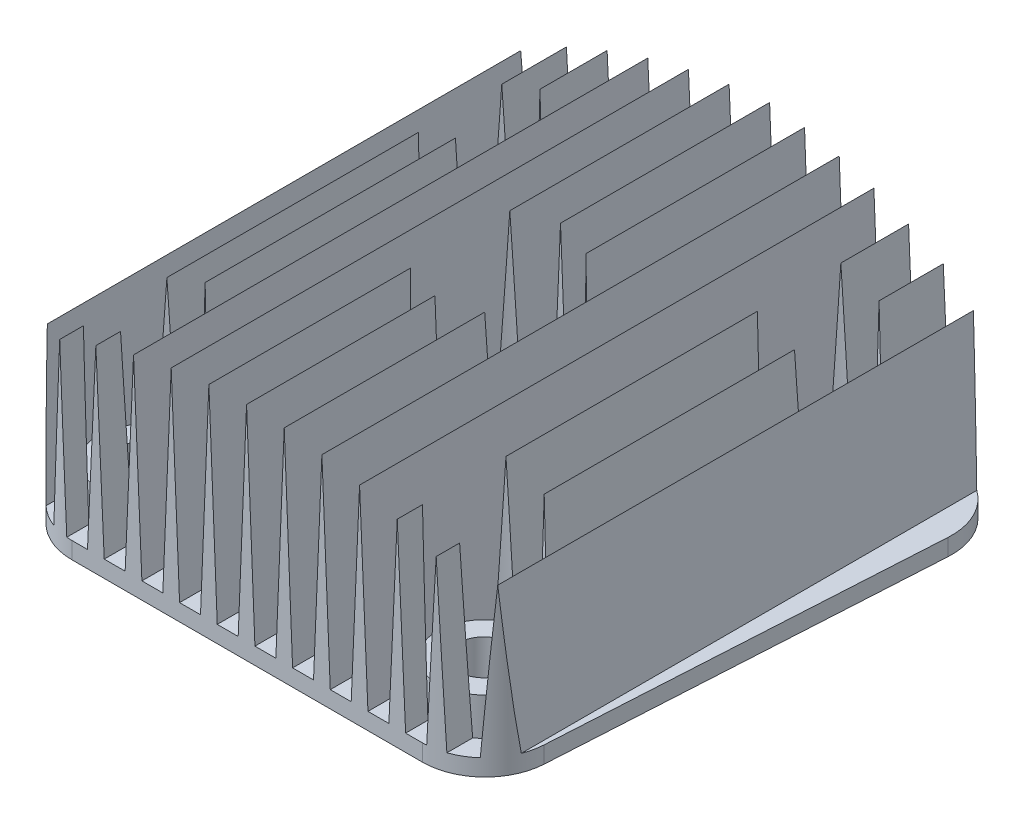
ISO-10303-21;
HEADER;
FILE_DESCRIPTION(('STEP AP214'),'2;1');
FILE_NAME('part.step','',(''),(''),'','','');
FILE_SCHEMA(('AUTOMOTIVE_DESIGN { 1 0 10303 214 1 1 1 1 }'));
ENDSEC;
DATA;
#1=APPLICATION_CONTEXT('core data for automotive mechanical design processes');
#2=APPLICATION_PROTOCOL_DEFINITION('international standard','automotive_design',2000,#1);
#3=PRODUCT_CONTEXT('',#1,'mechanical');
#4=PRODUCT('Part','Part','',(#3));
#5=PRODUCT_RELATED_PRODUCT_CATEGORY('part','',(#4));
#6=PRODUCT_DEFINITION_FORMATION('','',#4);
#7=PRODUCT_DEFINITION_CONTEXT('part definition',#1,'design');
#8=PRODUCT_DEFINITION('design','',#6,#7);
#9=PRODUCT_DEFINITION_SHAPE('','',#8);
#10=(LENGTH_UNIT() NAMED_UNIT(*) SI_UNIT(.MILLI.,.METRE.));
#11=(NAMED_UNIT(*) PLANE_ANGLE_UNIT() SI_UNIT($,.RADIAN.));
#12=(NAMED_UNIT(*) SI_UNIT($,.STERADIAN.) SOLID_ANGLE_UNIT());
#13=UNCERTAINTY_MEASURE_WITH_UNIT(LENGTH_MEASURE(1.E-05),#10,'distance_accuracy_value','');
#14=(GEOMETRIC_REPRESENTATION_CONTEXT(3) GLOBAL_UNCERTAINTY_ASSIGNED_CONTEXT((#13)) GLOBAL_UNIT_ASSIGNED_CONTEXT((#10,
#11,#12)) REPRESENTATION_CONTEXT('',''));
#15=CARTESIAN_POINT('',(0.,0.,0.));
#16=DIRECTION('',(0.,0.,1.));
#17=DIRECTION('',(1.,0.,0.));
#18=AXIS2_PLACEMENT_3D('',#15,#16,#17);
#19=CARTESIAN_POINT('',(0.,4.,0.));
#20=DIRECTION('',(0.,1.,0.));
#21=DIRECTION('',(0.,0.,1.));
#22=AXIS2_PLACEMENT_3D('',#19,#20,#21);
#23=PLANE('',#22);
#24=DIRECTION('',(0.,0.,-1.));
#25=VECTOR('',#24,1.);
#26=CARTESIAN_POINT('',(-47.1445804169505,4.,65.));
#27=LINE('',#26,#25);
#28=CARTESIAN_POINT('',(-47.1445804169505,4.,35.2336124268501));
#29=VERTEX_POINT('',#28);
#30=CARTESIAN_POINT('',(-47.1445804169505,4.,-27.2336124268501));
#31=VERTEX_POINT('',#30);
#32=EDGE_CURVE('E1117',#29,#31,#27,.T.);
#33=ORIENTED_EDGE('',*,*,#32,.T.);
#34=CARTESIAN_POINT('',(-40.5,4.,-36.));
#35=DIRECTION('',(0.,1.,0.));
#36=DIRECTION('',(0.,0.,1.));
#37=AXIS2_PLACEMENT_3D('',#34,#35,#36);
#38=CIRCLE('',#37,11.);
#39=CARTESIAN_POINT('',(-47.1445804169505,4.,-44.7663875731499));
#40=VERTEX_POINT('',#39);
#41=EDGE_CURVE('E734',#40,#31,#38,.T.);
#42=ORIENTED_EDGE('',*,*,#41,.F.);
#43=CARTESIAN_POINT('',(-47.1445804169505,4.,-61.2583666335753));
#44=VERTEX_POINT('',#43);
#45=EDGE_CURVE('E703',#40,#44,#27,.T.);
#46=ORIENTED_EDGE('',*,*,#45,.T.);
#47=DIRECTION('',(-0.996865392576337,0.,0.0791163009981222));
#48=VECTOR('',#47,1.);
#49=CARTESIAN_POINT('',(-63.,4.,-60.));
#50=LINE('',#49,#48);
#51=CARTESIAN_POINT('',(-48.3567808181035,4.,-61.1621602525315));
#52=VERTEX_POINT('',#51);
#53=EDGE_CURVE('E1156',#44,#52,#50,.T.);
#54=ORIENTED_EDGE('',*,*,#53,.T.);
#55=CARTESIAN_POINT('',(-47.1700363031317,4.,-46.2091793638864));
#56=DIRECTION('',(0.,1.,0.));
#57=DIRECTION('',(0.,0.,1.));
#58=AXIS2_PLACEMENT_3D('',#55,#56,#57);
#59=CIRCLE('',#58,15.);
#60=CARTESIAN_POINT('',(-52.1445804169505,4.00000000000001,-60.3602892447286));
#61=VERTEX_POINT('',#60);
#62=EDGE_CURVE('E1214',#52,#61,#59,.T.);
#63=ORIENTED_EDGE('',*,*,#62,.T.);
#64=DIRECTION('',(0.,0.,-1.));
#65=VECTOR('',#64,1.);
#66=CARTESIAN_POINT('',(-52.1445804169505,4.,65.));
#67=LINE('',#66,#65);
#68=CARTESIAN_POINT('',(-52.1445804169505,4.,55.9092317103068));
#69=VERTEX_POINT('',#68);
#70=EDGE_CURVE('E1131',#69,#61,#67,.T.);
#71=ORIENTED_EDGE('',*,*,#70,.F.);
#72=CARTESIAN_POINT('',(-41.8495008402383,4.,45.));
#73=DIRECTION('',(0.,1.,0.));
#74=DIRECTION('',(0.,0.,1.));
#75=AXIS2_PLACEMENT_3D('',#72,#73,#74);
#76=CIRCLE('',#75,15.);
#77=CARTESIAN_POINT('',(-47.1445804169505,4.,59.0343198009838));
#78=VERTEX_POINT('',#77);
#79=EDGE_CURVE('E1222',#69,#78,#76,.T.);
#80=ORIENTED_EDGE('',*,*,#79,.T.);
#81=CARTESIAN_POINT('',(-47.1445804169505,4.,52.7663875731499));
#82=VERTEX_POINT('',#81);
#83=EDGE_CURVE('E1113',#78,#82,#27,.T.);
#84=ORIENTED_EDGE('',*,*,#83,.T.);
#85=CARTESIAN_POINT('',(-40.5,4.,44.));
#86=DIRECTION('',(0.,1.,0.));
#87=DIRECTION('',(0.,0.,1.));
#88=AXIS2_PLACEMENT_3D('',#85,#86,#87);
#89=CIRCLE('',#88,11.);
#90=EDGE_CURVE('E744',#29,#82,#89,.T.);
#91=ORIENTED_EDGE('',*,*,#90,.F.);
#92=EDGE_LOOP('',(#33,#42,#46,#54,#63,#71,#80,#84,#91));
#93=FACE_BOUND('',#92,.T.);
#94=ADVANCED_FACE('F43',(#93),#23,.T.);
#95=DIRECTION('',(0.,0.,-1.));
#96=VECTOR('',#95,1.);
#97=CARTESIAN_POINT('',(-43.1445804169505,4.,65.));
#98=LINE('',#97,#96);
#99=CARTESIAN_POINT('',(-43.1445804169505,4.,-46.6773683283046));
#100=VERTEX_POINT('',#99);
#101=CARTESIAN_POINT('',(-43.1445804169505,4.00000000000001,-61.5758269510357));
#102=VERTEX_POINT('',#101);
#103=EDGE_CURVE('E1121',#100,#102,#98,.T.);
#104=ORIENTED_EDGE('',*,*,#103,.F.);
#105=CARTESIAN_POINT('',(-38.1445804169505,4.,-46.7448591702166));
#106=VERTEX_POINT('',#105);
#107=EDGE_CURVE('E1573',#106,#100,#38,.T.);
#108=ORIENTED_EDGE('',*,*,#107,.F.);
#109=DIRECTION('',(0.,0.,-1.));
#110=VECTOR('',#109,1.);
#111=CARTESIAN_POINT('',(-38.1445804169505,4.,65.));
#112=LINE('',#111,#110);
#113=CARTESIAN_POINT('',(-38.1445804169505,4.,-61.9726523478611));
#114=VERTEX_POINT('',#113);
#115=EDGE_CURVE('E1098',#106,#114,#112,.T.);
#116=ORIENTED_EDGE('',*,*,#115,.T.);
#117=EDGE_CURVE('E1666',#114,#102,#50,.T.);
#118=ORIENTED_EDGE('',*,*,#117,.T.);
#119=EDGE_LOOP('',(#104,#108,#116,#118));
#120=FACE_BOUND('',#119,.T.);
#121=ADVANCED_FACE('F1726',(#120),#23,.T.);
#122=DIRECTION('',(0.,0.,-1.));
#123=VECTOR('',#122,1.);
#124=CARTESIAN_POINT('',(-34.1445804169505,4.,65.));
#125=LINE('',#124,#123);
#126=CARTESIAN_POINT('',(-34.1445804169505,4.,-44.9782315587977));
#127=VERTEX_POINT('',#126);
#128=CARTESIAN_POINT('',(-34.1445804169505,4.,-62.2901126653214));
#129=VERTEX_POINT('',#128);
#130=EDGE_CURVE('E1107',#127,#129,#125,.T.);
#131=ORIENTED_EDGE('',*,*,#130,.F.);
#132=CARTESIAN_POINT('',(-34.1445804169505,4.,-27.0217684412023));
#133=VERTEX_POINT('',#132);
#134=EDGE_CURVE('E735',#133,#127,#38,.T.);
#135=ORIENTED_EDGE('',*,*,#134,.F.);
#136=CARTESIAN_POINT('',(-34.1445804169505,4.,35.0217684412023));
#137=VERTEX_POINT('',#136);
#138=EDGE_CURVE('E1112',#137,#133,#125,.T.);
#139=ORIENTED_EDGE('',*,*,#138,.F.);
#140=CARTESIAN_POINT('',(-34.1445804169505,4.,52.9782315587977));
#141=VERTEX_POINT('',#140);
#142=EDGE_CURVE('E745',#141,#137,#89,.T.);
#143=ORIENTED_EDGE('',*,*,#142,.F.);
#144=CARTESIAN_POINT('',(-34.1445804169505,4.,60.));
#145=VERTEX_POINT('',#144);
#146=EDGE_CURVE('E1109',#145,#141,#125,.T.);
#147=ORIENTED_EDGE('',*,*,#146,.F.);
#148=DIRECTION('',(1.,0.,0.));
#149=VECTOR('',#148,1.);
#150=CARTESIAN_POINT('',(56.,4.,60.));
#151=LINE('',#150,#149);
#152=CARTESIAN_POINT('',(-29.1445804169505,4.,60.));
#153=VERTEX_POINT('',#152);
#154=EDGE_CURVE('E1170',#145,#153,#151,.T.);
#155=ORIENTED_EDGE('',*,*,#154,.T.);
#156=DIRECTION('',(0.,0.,-1.));
#157=VECTOR('',#156,1.);
#158=CARTESIAN_POINT('',(-29.1445804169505,4.,65.));
#159=LINE('',#158,#157);
#160=CARTESIAN_POINT('',(-29.1445804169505,4.,-62.6869380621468));
#161=VERTEX_POINT('',#160);
#162=EDGE_CURVE('E1089',#153,#161,#159,.T.);
#163=ORIENTED_EDGE('',*,*,#162,.T.);
#164=EDGE_CURVE('E1667',#161,#129,#50,.T.);
#165=ORIENTED_EDGE('',*,*,#164,.T.);
#166=EDGE_LOOP('',(#131,#135,#139,#143,#147,#155,#163,#165));
#167=FACE_BOUND('',#166,.T.);
#168=ADVANCED_FACE('F1732',(#167),#23,.T.);
#169=CARTESIAN_POINT('',(-38.1445804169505,4.,33.2551408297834));
#170=VERTEX_POINT('',#169);
#171=CARTESIAN_POINT('',(-38.1445804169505,4.,-25.2551408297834));
#172=VERTEX_POINT('',#171);
#173=EDGE_CURVE('E1103',#170,#172,#112,.T.);
#174=ORIENTED_EDGE('',*,*,#173,.T.);
#175=CARTESIAN_POINT('',(-43.1445804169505,4.,-25.3226316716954));
#176=VERTEX_POINT('',#175);
#177=EDGE_CURVE('E731',#176,#172,#38,.T.);
#178=ORIENTED_EDGE('',*,*,#177,.F.);
#179=CARTESIAN_POINT('',(-43.1445804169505,4.,33.3226316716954));
#180=VERTEX_POINT('',#179);
#181=EDGE_CURVE('E1127',#180,#176,#98,.T.);
#182=ORIENTED_EDGE('',*,*,#181,.F.);
#183=EDGE_CURVE('E2956',#170,#180,#89,.T.);
#184=ORIENTED_EDGE('',*,*,#183,.F.);
#185=EDGE_LOOP('',(#174,#178,#182,#184));
#186=FACE_BOUND('',#185,.T.);
#187=ADVANCED_FACE('F1940',(#186),#23,.T.);
#188=DIRECTION('',(0.,0.,-1.));
#189=VECTOR('',#188,1.);
#190=CARTESIAN_POINT('',(33.8554195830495,4.,65.));
#191=LINE('',#190,#189);
#192=CARTESIAN_POINT('',(33.8554195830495,4.,35.2336124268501));
#193=VERTEX_POINT('',#192);
#194=CARTESIAN_POINT('',(33.8554195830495,4.,-27.2336124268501));
#195=VERTEX_POINT('',#194);
#196=EDGE_CURVE('E1016',#193,#195,#191,.T.);
#197=ORIENTED_EDGE('',*,*,#196,.T.);
#198=CARTESIAN_POINT('',(40.5,4.,-36.));
#199=DIRECTION('',(0.,1.,0.));
#200=DIRECTION('',(0.,0.,1.));
#201=AXIS2_PLACEMENT_3D('',#198,#199,#200);
#202=CIRCLE('',#201,11.);
#203=CARTESIAN_POINT('',(33.8554195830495,4.,-44.7663875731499));
#204=VERTEX_POINT('',#203);
#205=EDGE_CURVE('E754',#204,#195,#202,.T.);
#206=ORIENTED_EDGE('',*,*,#205,.F.);
#207=CARTESIAN_POINT('',(33.8554195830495,4.,-62.3130619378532));
#208=VERTEX_POINT('',#207);
#209=EDGE_CURVE('E1010',#204,#208,#191,.T.);
#210=ORIENTED_EDGE('',*,*,#209,.T.);
#211=DIRECTION('',(-0.996865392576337,0.,-0.0791163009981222));
#212=VECTOR('',#211,1.);
#213=CARTESIAN_POINT('',(0.,4.,-65.));
#214=LINE('',#213,#212);
#215=CARTESIAN_POINT('',(28.8554195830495,4.,-62.7098873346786));
#216=VERTEX_POINT('',#215);
#217=EDGE_CURVE('E1637',#208,#216,#214,.T.);
#218=ORIENTED_EDGE('',*,*,#217,.T.);
#219=DIRECTION('',(0.,0.,-1.));
#220=VECTOR('',#219,1.);
#221=CARTESIAN_POINT('',(28.8554195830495,4.,65.));
#222=LINE('',#221,#220);
#223=CARTESIAN_POINT('',(28.8554195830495,4.,60.));
#224=VERTEX_POINT('',#223);
#225=EDGE_CURVE('E1032',#224,#216,#222,.T.);
#226=ORIENTED_EDGE('',*,*,#225,.F.);
#227=CARTESIAN_POINT('',(33.8554195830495,4.,60.));
#228=VERTEX_POINT('',#227);
#229=EDGE_CURVE('E1448',#224,#228,#151,.T.);
#230=ORIENTED_EDGE('',*,*,#229,.T.);
#231=CARTESIAN_POINT('',(33.8554195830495,4.,52.7663875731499));
#232=VERTEX_POINT('',#231);
#233=EDGE_CURVE('E1012',#228,#232,#191,.T.);
#234=ORIENTED_EDGE('',*,*,#233,.T.);
#235=CARTESIAN_POINT('',(40.5,4.,44.));
#236=DIRECTION('',(0.,1.,0.));
#237=DIRECTION('',(0.,0.,1.));
#238=AXIS2_PLACEMENT_3D('',#235,#236,#237);
#239=CIRCLE('',#238,11.);
#240=EDGE_CURVE('E811',#193,#232,#239,.T.);
#241=ORIENTED_EDGE('',*,*,#240,.F.);
#242=EDGE_LOOP('',(#197,#206,#210,#218,#226,#230,#234,#241));
#243=FACE_BOUND('',#242,.T.);
#244=ADVANCED_FACE('F1628',(#243),#23,.T.);
#245=DIRECTION('',(0.,0.,-1.));
#246=VECTOR('',#245,1.);
#247=CARTESIAN_POINT('',(37.8554195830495,4.,65.));
#248=LINE('',#247,#246);
#249=CARTESIAN_POINT('',(37.8554195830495,4.,-46.6773683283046));
#250=VERTEX_POINT('',#249);
#251=CARTESIAN_POINT('',(37.8554195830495,4.,-61.9956016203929));
#252=VERTEX_POINT('',#251);
#253=EDGE_CURVE('E1020',#250,#252,#248,.T.);
#254=ORIENTED_EDGE('',*,*,#253,.F.);
#255=CARTESIAN_POINT('',(42.8554195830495,4.,-46.7448591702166));
#256=VERTEX_POINT('',#255);
#257=EDGE_CURVE('E1618',#256,#250,#202,.T.);
#258=ORIENTED_EDGE('',*,*,#257,.F.);
#259=DIRECTION('',(0.,0.,-1.));
#260=VECTOR('',#259,1.);
#261=CARTESIAN_POINT('',(42.8554195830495,4.,65.));
#262=LINE('',#261,#260);
#263=CARTESIAN_POINT('',(42.8554195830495,4.,-61.5987762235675));
#264=VERTEX_POINT('',#263);
#265=EDGE_CURVE('E996',#256,#264,#262,.T.);
#266=ORIENTED_EDGE('',*,*,#265,.T.);
#267=EDGE_CURVE('E1157',#264,#252,#214,.T.);
#268=ORIENTED_EDGE('',*,*,#267,.T.);
#269=EDGE_LOOP('',(#254,#258,#266,#268));
#270=FACE_BOUND('',#269,.T.);
#271=ADVANCED_FACE('F1930',(#270),#23,.T.);
#272=DIRECTION('',(0.,0.,-1.));
#273=VECTOR('',#272,1.);
#274=CARTESIAN_POINT('',(46.8554195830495,4.,65.));
#275=LINE('',#274,#273);
#276=CARTESIAN_POINT('',(46.8554195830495,4.,-44.9782315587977));
#277=VERTEX_POINT('',#276);
#278=CARTESIAN_POINT('',(46.8554195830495,4.,-61.2813159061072));
#279=VERTEX_POINT('',#278);
#280=EDGE_CURVE('E1005',#277,#279,#275,.T.);
#281=ORIENTED_EDGE('',*,*,#280,.F.);
#282=CARTESIAN_POINT('',(46.8554195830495,4.,-27.0217684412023));
#283=VERTEX_POINT('',#282);
#284=EDGE_CURVE('E755',#283,#277,#202,.T.);
#285=ORIENTED_EDGE('',*,*,#284,.F.);
#286=CARTESIAN_POINT('',(46.8554195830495,4.,35.0217684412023));
#287=VERTEX_POINT('',#286);
#288=EDGE_CURVE('E1011',#287,#283,#275,.T.);
#289=ORIENTED_EDGE('',*,*,#288,.F.);
#290=CARTESIAN_POINT('',(46.8554195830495,4.,52.9782315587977));
#291=VERTEX_POINT('',#290);
#292=EDGE_CURVE('E812',#291,#287,#239,.T.);
#293=ORIENTED_EDGE('',*,*,#292,.F.);
#294=CARTESIAN_POINT('',(46.8554195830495,3.99999999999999,59.1400416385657));
#295=VERTEX_POINT('',#294);
#296=EDGE_CURVE('E1007',#295,#291,#275,.T.);
#297=ORIENTED_EDGE('',*,*,#296,.F.);
#298=CARTESIAN_POINT('',(41.8495008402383,4.,45.));
#299=DIRECTION('',(0.,1.,0.));
#300=DIRECTION('',(0.,0.,1.));
#301=AXIS2_PLACEMENT_3D('',#298,#299,#300);
#302=CIRCLE('',#301,15.);
#303=CARTESIAN_POINT('',(51.8554195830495,4.,56.1750431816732));
#304=VERTEX_POINT('',#303);
#305=EDGE_CURVE('E1209',#295,#304,#302,.T.);
#306=ORIENTED_EDGE('',*,*,#305,.T.);
#307=DIRECTION('',(0.,0.,-1.));
#308=VECTOR('',#307,1.);
#309=CARTESIAN_POINT('',(51.8554195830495,4.,65.));
#310=LINE('',#309,#308);
#311=CARTESIAN_POINT('',(51.8554195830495,4.,-60.4586419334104));
#312=VERTEX_POINT('',#311);
#313=EDGE_CURVE('E987',#304,#312,#310,.T.);
#314=ORIENTED_EDGE('',*,*,#313,.T.);
#315=CARTESIAN_POINT('',(47.1700363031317,4.,-46.2091793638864));
#316=DIRECTION('',(0.,1.,0.));
#317=DIRECTION('',(0.,0.,1.));
#318=AXIS2_PLACEMENT_3D('',#315,#316,#317);
#319=CIRCLE('',#318,15.);
#320=CARTESIAN_POINT('',(48.3567808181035,4.,-61.1621602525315));
#321=VERTEX_POINT('',#320);
#322=EDGE_CURVE('E1208',#312,#321,#319,.T.);
#323=ORIENTED_EDGE('',*,*,#322,.T.);
#324=EDGE_CURVE('E1153',#321,#279,#214,.T.);
#325=ORIENTED_EDGE('',*,*,#324,.T.);
#326=EDGE_LOOP('',(#281,#285,#289,#293,#297,#306,#314,#323,#325));
#327=FACE_BOUND('',#326,.T.);
#328=ADVANCED_FACE('F1838',(#327),#23,.T.);
#329=CARTESIAN_POINT('',(35.8554195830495,47.2675106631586,65.));
#330=DIRECTION('',(-0.998933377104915,-0.0461747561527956,0.));
#331=DIRECTION('',(0.0461747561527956,-0.998933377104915,0.));
#332=AXIS2_PLACEMENT_3D('',#329,#330,#331);
#333=PLANE('',#332);
#334=CARTESIAN_POINT('',(40.5,-53.2122056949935,-36.));
#335=DIRECTION('',(-0.998933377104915,-0.0461747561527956,0.));
#336=DIRECTION('',(0.0461747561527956,-0.998933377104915,0.));
#337=AXIS2_PLACEMENT_3D('',#334,#335,#336);
#338=ELLIPSE('',#337,238.225405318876,11.);
#339=CARTESIAN_POINT('',(37.43940304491,13.,-46.5656398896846));
#340=VERTEX_POINT('',#339);
#341=EDGE_CURVE('E793',#250,#340,#338,.F.);
#342=ORIENTED_EDGE('',*,*,#341,.F.);
#343=ORIENTED_EDGE('',*,*,#253,.T.);
#344=DIRECTION('',(-0.046174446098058,0.998926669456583,-0.00366463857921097));
#345=VECTOR('',#344,1.);
#346=CARTESIAN_POINT('',(35.876935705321,46.8020361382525,-62.1526241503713));
#347=LINE('',#346,#345);
#348=CARTESIAN_POINT('',(35.8554195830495,47.2675106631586,-62.1543317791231));
#349=VERTEX_POINT('',#348);
#350=EDGE_CURVE('E883',#252,#349,#347,.T.);
#351=ORIENTED_EDGE('',*,*,#350,.T.);
#352=DIRECTION('',(0.,0.,-1.));
#353=VECTOR('',#352,1.);
#354=CARTESIAN_POINT('',(35.8554195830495,47.2675106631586,65.));
#355=LINE('',#354,#353);
#356=CARTESIAN_POINT('',(35.8554195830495,47.2675106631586,-45.9713526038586));
#357=VERTEX_POINT('',#356);
#358=EDGE_CURVE('E1015',#357,#349,#355,.T.);
#359=ORIENTED_EDGE('',*,*,#358,.F.);
#360=EDGE_CURVE('E789',#340,#357,#338,.F.);
#361=ORIENTED_EDGE('',*,*,#360,.F.);
#362=EDGE_LOOP('',(#342,#343,#351,#359,#361));
#363=FACE_BOUND('',#362,.T.);
#364=ADVANCED_FACE('F1905',(#363),#333,.F.);
#365=CARTESIAN_POINT('',(35.8554195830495,47.2675106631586,-26.0286473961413));
#366=VERTEX_POINT('',#365);
#367=CARTESIAN_POINT('',(37.43940304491,13.,-25.4343601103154));
#368=VERTEX_POINT('',#367);
#369=EDGE_CURVE('E797',#366,#368,#338,.F.);
#370=ORIENTED_EDGE('',*,*,#369,.F.);
#371=CARTESIAN_POINT('',(35.8554195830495,47.2675106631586,34.0286473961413));
#372=VERTEX_POINT('',#371);
#373=EDGE_CURVE('E1021',#372,#366,#355,.T.);
#374=ORIENTED_EDGE('',*,*,#373,.F.);
#375=CARTESIAN_POINT('',(40.5,-53.2122056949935,44.));
#376=DIRECTION('',(-0.998933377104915,-0.0461747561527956,0.));
#377=DIRECTION('',(0.0461747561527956,-0.998933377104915,0.));
#378=AXIS2_PLACEMENT_3D('',#375,#376,#377);
#379=ELLIPSE('',#378,238.225405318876,11.);
#380=CARTESIAN_POINT('',(37.43940304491,13.,33.4343601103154));
#381=VERTEX_POINT('',#380);
#382=EDGE_CURVE('E830',#381,#372,#379,.F.);
#383=ORIENTED_EDGE('',*,*,#382,.F.);
#384=CARTESIAN_POINT('',(37.8554195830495,4.,33.3226316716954));
#385=VERTEX_POINT('',#384);
#386=EDGE_CURVE('E834',#385,#381,#379,.F.);
#387=ORIENTED_EDGE('',*,*,#386,.F.);
#388=CARTESIAN_POINT('',(37.8554195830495,4.,-25.3226316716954));
#389=VERTEX_POINT('',#388);
#390=EDGE_CURVE('E1026',#385,#389,#248,.T.);
#391=ORIENTED_EDGE('',*,*,#390,.T.);
#392=EDGE_CURVE('E796',#368,#389,#338,.F.);
#393=ORIENTED_EDGE('',*,*,#392,.F.);
#394=EDGE_LOOP('',(#370,#374,#383,#387,#391,#393));
#395=FACE_BOUND('',#394,.T.);
#396=ADVANCED_FACE('F1863',(#395),#333,.F.);
#397=CARTESIAN_POINT('',(33.8554195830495,4.,65.));
#398=DIRECTION('',(0.998933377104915,-0.0461747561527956,0.));
#399=DIRECTION('',(0.0461747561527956,0.998933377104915,0.));
#400=AXIS2_PLACEMENT_3D('',#397,#398,#399);
#401=PLANE('',#400);
#402=CARTESIAN_POINT('',(40.5,147.747227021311,-36.));
#403=DIRECTION('',(0.998933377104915,-0.0461747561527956,0.));
#404=DIRECTION('',(-0.0461747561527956,-0.998933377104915,0.));
#405=AXIS2_PLACEMENT_3D('',#402,#403,#404);
#406=ELLIPSE('',#405,238.225405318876,11.);
#407=CARTESIAN_POINT('',(34.271436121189,13.,-26.9333031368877));
#408=VERTEX_POINT('',#407);
#409=EDGE_CURVE('E792',#195,#408,#406,.F.);
#410=ORIENTED_EDGE('',*,*,#409,.F.);
#411=ORIENTED_EDGE('',*,*,#196,.F.);
#412=CARTESIAN_POINT('',(40.5,147.747227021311,44.));
#413=DIRECTION('',(0.998933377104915,-0.0461747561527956,0.));
#414=DIRECTION('',(-0.0461747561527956,-0.998933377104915,0.));
#415=AXIS2_PLACEMENT_3D('',#412,#413,#414);
#416=ELLIPSE('',#415,238.225405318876,11.);
#417=CARTESIAN_POINT('',(34.271436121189,13.,34.9333031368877));
#418=VERTEX_POINT('',#417);
#419=EDGE_CURVE('E831',#418,#193,#416,.F.);
#420=ORIENTED_EDGE('',*,*,#419,.F.);
#421=EDGE_CURVE('E828',#372,#418,#416,.F.);
#422=ORIENTED_EDGE('',*,*,#421,.F.);
#423=ORIENTED_EDGE('',*,*,#373,.T.);
#424=EDGE_CURVE('E791',#408,#366,#406,.F.);
#425=ORIENTED_EDGE('',*,*,#424,.F.);
#426=EDGE_LOOP('',(#410,#411,#420,#422,#423,#425));
#427=FACE_BOUND('',#426,.T.);
#428=ADVANCED_FACE('F1853',(#427),#401,.F.);
#429=CARTESIAN_POINT('',(34.271436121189,13.,-45.0666968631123));
#430=VERTEX_POINT('',#429);
#431=EDGE_CURVE('E787',#357,#430,#406,.F.);
#432=ORIENTED_EDGE('',*,*,#431,.F.);
#433=ORIENTED_EDGE('',*,*,#358,.T.);
#434=DIRECTION('',(-0.046174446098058,-0.998926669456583,-0.00366463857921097));
#435=VECTOR('',#434,1.);
#436=CARTESIAN_POINT('',(33.8769625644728,4.46605558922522,-62.3113521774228));
#437=LINE('',#436,#435);
#438=EDGE_CURVE('E880',#349,#208,#437,.T.);
#439=ORIENTED_EDGE('',*,*,#438,.T.);
#440=ORIENTED_EDGE('',*,*,#209,.F.);
#441=EDGE_CURVE('E790',#430,#204,#406,.F.);
#442=ORIENTED_EDGE('',*,*,#441,.F.);
#443=EDGE_LOOP('',(#432,#433,#439,#440,#442));
#444=FACE_BOUND('',#443,.T.);
#445=ADVANCED_FACE('F1633',(#444),#401,.F.);
#446=CARTESIAN_POINT('',(44.8554195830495,43.8914129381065,65.));
#447=DIRECTION('',(-0.998745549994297,-0.0500732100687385,0.));
#448=DIRECTION('',(0.0500732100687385,-0.998745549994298,0.));
#449=AXIS2_PLACEMENT_3D('',#446,#447,#448);
#450=PLANE('',#449);
#451=CARTESIAN_POINT('',(40.5,130.763333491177,-36.));
#452=DIRECTION('',(-0.998745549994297,-0.0500732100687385,0.));
#453=DIRECTION('',(0.0500732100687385,-0.998745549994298,0.));
#454=AXIS2_PLACEMENT_3D('',#451,#452,#453);
#455=ELLIPSE('',#454,219.678346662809,11.);
#456=CARTESIAN_POINT('',(46.4041946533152,13.,-45.281189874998));
#457=VERTEX_POINT('',#456);
#458=EDGE_CURVE('E781',#277,#457,#455,.F.);
#459=ORIENTED_EDGE('',*,*,#458,.F.);
#460=ORIENTED_EDGE('',*,*,#280,.T.);
#461=DIRECTION('',(-0.0500728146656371,0.9987376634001,-0.00397403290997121));
#462=VECTOR('',#461,1.);
#463=CARTESIAN_POINT('',(44.8805800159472,43.3895703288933,-61.4380492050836));
#464=LINE('',#463,#462);
#465=CARTESIAN_POINT('',(44.8554195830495,43.8914129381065,-61.4400460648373));
#466=VERTEX_POINT('',#465);
#467=EDGE_CURVE('E877',#279,#466,#464,.T.);
#468=ORIENTED_EDGE('',*,*,#467,.T.);
#469=DIRECTION('',(0.,0.,-1.));
#470=VECTOR('',#469,1.);
#471=CARTESIAN_POINT('',(44.8554195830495,43.8914129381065,65.));
#472=LINE('',#471,#470);
#473=CARTESIAN_POINT('',(44.8554195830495,43.8914129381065,-46.1010059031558));
#474=VERTEX_POINT('',#473);
#475=EDGE_CURVE('E1000',#474,#466,#472,.T.);
#476=ORIENTED_EDGE('',*,*,#475,.F.);
#477=EDGE_CURVE('E785',#457,#474,#455,.F.);
#478=ORIENTED_EDGE('',*,*,#477,.F.);
#479=EDGE_LOOP('',(#459,#460,#468,#476,#478));
#480=FACE_BOUND('',#479,.T.);
#481=ADVANCED_FACE('F1514',(#480),#450,.F.);
#482=CARTESIAN_POINT('',(44.8554195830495,43.8914129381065,-25.8989940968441));
#483=VERTEX_POINT('',#482);
#484=CARTESIAN_POINT('',(46.4041946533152,13.,-26.718810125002));
#485=VERTEX_POINT('',#484);
#486=EDGE_CURVE('E786',#483,#485,#455,.F.);
#487=ORIENTED_EDGE('',*,*,#486,.F.);
#488=CARTESIAN_POINT('',(44.8554195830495,43.8914129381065,33.8989940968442));
#489=VERTEX_POINT('',#488);
#490=EDGE_CURVE('E1006',#489,#483,#472,.T.);
#491=ORIENTED_EDGE('',*,*,#490,.F.);
#492=CARTESIAN_POINT('',(40.5,130.763333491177,44.));
#493=DIRECTION('',(-0.998745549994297,-0.0500732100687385,0.));
#494=DIRECTION('',(0.0500732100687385,-0.998745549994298,0.));
#495=AXIS2_PLACEMENT_3D('',#492,#493,#494);
#496=ELLIPSE('',#495,219.678346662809,11.);
#497=CARTESIAN_POINT('',(46.4041946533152,13.,34.718810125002));
#498=VERTEX_POINT('',#497);
#499=EDGE_CURVE('E816',#498,#489,#496,.F.);
#500=ORIENTED_EDGE('',*,*,#499,.F.);
#501=EDGE_CURVE('E823',#287,#498,#496,.F.);
#502=ORIENTED_EDGE('',*,*,#501,.F.);
#503=ORIENTED_EDGE('',*,*,#288,.T.);
#504=EDGE_CURVE('E784',#485,#283,#455,.F.);
#505=ORIENTED_EDGE('',*,*,#504,.F.);
#506=EDGE_LOOP('',(#487,#491,#500,#502,#503,#505));
#507=FACE_BOUND('',#506,.T.);
#508=ADVANCED_FACE('F1497',(#507),#450,.F.);
#509=CARTESIAN_POINT('',(42.8554195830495,4.,65.));
#510=DIRECTION('',(0.998745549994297,-0.0500732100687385,0.));
#511=DIRECTION('',(0.0500732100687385,0.998745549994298,0.));
#512=AXIS2_PLACEMENT_3D('',#509,#510,#511);
#513=PLANE('',#512);
#514=CARTESIAN_POINT('',(40.5,-42.9805076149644,-36.));
#515=DIRECTION('',(0.998745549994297,-0.0500732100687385,0.));
#516=DIRECTION('',(-0.0500732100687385,-0.998745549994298,0.));
#517=AXIS2_PLACEMENT_3D('',#514,#515,#516);
#518=ELLIPSE('',#517,219.678346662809,11.);
#519=CARTESIAN_POINT('',(42.8554195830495,4.,-25.2551408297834));
#520=VERTEX_POINT('',#519);
#521=CARTESIAN_POINT('',(43.3066445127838,13.,-25.3640822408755));
#522=VERTEX_POINT('',#521);
#523=EDGE_CURVE('E1293',#520,#522,#518,.F.);
#524=ORIENTED_EDGE('',*,*,#523,.F.);
#525=CARTESIAN_POINT('',(42.8554195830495,4.,33.2551408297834));
#526=VERTEX_POINT('',#525);
#527=EDGE_CURVE('E1001',#526,#520,#262,.T.);
#528=ORIENTED_EDGE('',*,*,#527,.F.);
#529=CARTESIAN_POINT('',(40.5,-42.9805076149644,44.));
#530=DIRECTION('',(0.998745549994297,-0.0500732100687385,0.));
#531=DIRECTION('',(-0.0500732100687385,-0.998745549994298,0.));
#532=AXIS2_PLACEMENT_3D('',#529,#530,#531);
#533=ELLIPSE('',#532,219.678346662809,11.);
#534=CARTESIAN_POINT('',(43.3066445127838,13.,33.3640822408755));
#535=VERTEX_POINT('',#534);
#536=EDGE_CURVE('E1268',#535,#526,#533,.F.);
#537=ORIENTED_EDGE('',*,*,#536,.F.);
#538=EDGE_CURVE('E1264',#489,#535,#533,.F.);
#539=ORIENTED_EDGE('',*,*,#538,.F.);
#540=ORIENTED_EDGE('',*,*,#490,.T.);
#541=EDGE_CURVE('E1291',#522,#483,#518,.F.);
#542=ORIENTED_EDGE('',*,*,#541,.F.);
#543=EDGE_LOOP('',(#524,#528,#537,#539,#540,#542));
#544=FACE_BOUND('',#543,.T.);
#545=ADVANCED_FACE('F1493',(#544),#513,.F.);
#546=CARTESIAN_POINT('',(43.3066445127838,13.,-46.6359177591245));
#547=VERTEX_POINT('',#546);
#548=EDGE_CURVE('E1288',#474,#547,#518,.F.);
#549=ORIENTED_EDGE('',*,*,#548,.F.);
#550=ORIENTED_EDGE('',*,*,#475,.T.);
#551=DIRECTION('',(-0.0500728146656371,-0.9987376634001,-0.00397403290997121));
#552=VECTOR('',#551,1.);
#553=CARTESIAN_POINT('',(42.8806116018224,4.50247261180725,-61.5967768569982));
#554=LINE('',#553,#552);
#555=EDGE_CURVE('E1241',#466,#264,#554,.T.);
#556=ORIENTED_EDGE('',*,*,#555,.T.);
#557=ORIENTED_EDGE('',*,*,#265,.F.);
#558=EDGE_CURVE('E1292',#547,#256,#518,.F.);
#559=ORIENTED_EDGE('',*,*,#558,.F.);
#560=EDGE_LOOP('',(#549,#550,#556,#557,#559));
#561=FACE_BOUND('',#560,.T.);
#562=ADVANCED_FACE('F1503',(#561),#513,.F.);
#563=CARTESIAN_POINT('',(-45.1445804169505,43.7684587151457,65.));
#564=DIRECTION('',(-0.998737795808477,-0.0502276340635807,0.));
#565=DIRECTION('',(0.0502276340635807,-0.998737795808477,0.));
#566=AXIS2_PLACEMENT_3D('',#563,#564,#565);
#567=PLANE('',#566);
#568=CARTESIAN_POINT('',(-40.5,-48.5854435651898,44.));
#569=DIRECTION('',(-0.998737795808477,-0.0502276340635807,0.));
#570=DIRECTION('',(0.0502276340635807,-0.998737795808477,0.));
#571=AXIS2_PLACEMENT_3D('',#568,#569,#570);
#572=ELLIPSE('',#571,219.002949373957,11.);
#573=CARTESIAN_POINT('',(-43.5972004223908,13.,33.4450319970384));
#574=VERTEX_POINT('',#573);
#575=EDGE_CURVE('E776',#180,#574,#572,.F.);
#576=ORIENTED_EDGE('',*,*,#575,.F.);
#577=ORIENTED_EDGE('',*,*,#181,.T.);
#578=CARTESIAN_POINT('',(-40.5,-48.5854435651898,-36.));
#579=DIRECTION('',(-0.998737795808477,-0.0502276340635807,0.));
#580=DIRECTION('',(0.0502276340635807,-0.998737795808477,0.));
#581=AXIS2_PLACEMENT_3D('',#578,#579,#580);
#582=ELLIPSE('',#581,219.002949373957,11.);
#583=CARTESIAN_POINT('',(-43.5972004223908,13.,-25.4450319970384));
#584=VERTEX_POINT('',#583);
#585=EDGE_CURVE('E762',#584,#176,#582,.F.);
#586=ORIENTED_EDGE('',*,*,#585,.F.);
#587=CARTESIAN_POINT('',(-45.1445804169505,43.7684587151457,-26.0286473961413));
#588=VERTEX_POINT('',#587);
#589=EDGE_CURVE('E763',#588,#584,#582,.F.);
#590=ORIENTED_EDGE('',*,*,#589,.F.);
#591=DIRECTION('',(0.,0.,-1.));
#592=VECTOR('',#591,1.);
#593=CARTESIAN_POINT('',(-45.1445804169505,43.7684587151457,65.));
#594=LINE('',#593,#592);
#595=CARTESIAN_POINT('',(-45.1445804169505,43.7684587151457,34.0286473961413));
#596=VERTEX_POINT('',#595);
#597=EDGE_CURVE('E1122',#596,#588,#594,.T.);
#598=ORIENTED_EDGE('',*,*,#597,.F.);
#599=EDGE_CURVE('E772',#574,#596,#572,.F.);
#600=ORIENTED_EDGE('',*,*,#599,.F.);
#601=EDGE_LOOP('',(#576,#577,#586,#590,#598,#600));
#602=FACE_BOUND('',#601,.T.);
#603=ADVANCED_FACE('F1546',(#602),#567,.F.);
#604=CARTESIAN_POINT('',(-45.1445804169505,43.7684587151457,53.9713526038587));
#605=VERTEX_POINT('',#604);
#606=CARTESIAN_POINT('',(-43.5972004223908,13.,54.5549680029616));
#607=VERTEX_POINT('',#606);
#608=EDGE_CURVE('E780',#605,#607,#572,.F.);
#609=ORIENTED_EDGE('',*,*,#608,.F.);
#610=CARTESIAN_POINT('',(-45.1445804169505,43.7684587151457,59.633606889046));
#611=VERTEX_POINT('',#610);
#612=EDGE_CURVE('E1118',#611,#605,#594,.T.);
#613=ORIENTED_EDGE('',*,*,#612,.F.);
#614=CARTESIAN_POINT('',(-41.8495008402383,-21.7516593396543,45.));
#615=DIRECTION('',(-0.998737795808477,-0.0502276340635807,0.));
#616=DIRECTION('',(0.0502276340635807,-0.998737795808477,0.));
#617=AXIS2_PLACEMENT_3D('',#614,#615,#616);
#618=ELLIPSE('',#617,298.640385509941,15.);
#619=CARTESIAN_POINT('',(-43.1445804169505,4.,59.9439877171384));
#620=VERTEX_POINT('',#619);
#621=EDGE_CURVE('E977',#611,#620,#618,.F.);
#622=ORIENTED_EDGE('',*,*,#621,.T.);
#623=CARTESIAN_POINT('',(-43.1445804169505,4.,54.6773683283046));
#624=VERTEX_POINT('',#623);
#625=EDGE_CURVE('E1123',#620,#624,#98,.T.);
#626=ORIENTED_EDGE('',*,*,#625,.T.);
#627=EDGE_CURVE('E779',#607,#624,#572,.F.);
#628=ORIENTED_EDGE('',*,*,#627,.F.);
#629=EDGE_LOOP('',(#609,#613,#622,#626,#628));
#630=FACE_BOUND('',#629,.T.);
#631=ADVANCED_FACE('F2179',(#630),#567,.F.);
#632=CARTESIAN_POINT('',(-43.5972004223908,13.,-46.5549680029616));
#633=VERTEX_POINT('',#632);
#634=EDGE_CURVE('E760',#100,#633,#582,.F.);
#635=ORIENTED_EDGE('',*,*,#634,.F.);
#636=ORIENTED_EDGE('',*,*,#103,.T.);
#637=DIRECTION('',(-0.0502272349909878,0.99872986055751,0.00398628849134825));
#638=VECTOR('',#637,1.);
#639=CARTESIAN_POINT('',(-45.1698916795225,44.2717536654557,-61.4150879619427));
#640=LINE('',#639,#638);
#641=CARTESIAN_POINT('',(-45.1445804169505,43.7684587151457,-61.4170967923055));
#642=VERTEX_POINT('',#641);
#643=EDGE_CURVE('E971',#102,#642,#640,.T.);
#644=ORIENTED_EDGE('',*,*,#643,.T.);
#645=CARTESIAN_POINT('',(-45.1445804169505,43.7684587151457,-45.9713526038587));
#646=VERTEX_POINT('',#645);
#647=EDGE_CURVE('E1116',#646,#642,#594,.T.);
#648=ORIENTED_EDGE('',*,*,#647,.F.);
#649=EDGE_CURVE('E691',#633,#646,#582,.F.);
#650=ORIENTED_EDGE('',*,*,#649,.F.);
#651=EDGE_LOOP('',(#635,#636,#644,#648,#650));
#652=FACE_BOUND('',#651,.T.);
#653=ADVANCED_FACE('F1554',(#652),#567,.F.);
#654=CARTESIAN_POINT('',(-47.1445804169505,4.,65.));
#655=DIRECTION('',(0.998737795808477,-0.0502276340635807,0.));
#656=DIRECTION('',(0.0502276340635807,0.998737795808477,0.));
#657=AXIS2_PLACEMENT_3D('',#654,#655,#656);
#658=PLANE('',#657);
#659=CARTESIAN_POINT('',(-40.5,136.122360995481,44.));
#660=DIRECTION('',(0.998737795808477,-0.0502276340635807,0.));
#661=DIRECTION('',(-0.0502276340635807,-0.998737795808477,0.));
#662=AXIS2_PLACEMENT_3D('',#659,#660,#661);
#663=ELLIPSE('',#662,219.002949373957,11.);
#664=CARTESIAN_POINT('',(-46.6919604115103,13.,53.0917339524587));
#665=VERTEX_POINT('',#664);
#666=EDGE_CURVE('E775',#82,#665,#663,.F.);
#667=ORIENTED_EDGE('',*,*,#666,.F.);
#668=ORIENTED_EDGE('',*,*,#83,.F.);
#669=CARTESIAN_POINT('',(-41.8495008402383,109.288576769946,45.));
#670=DIRECTION('',(0.998737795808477,-0.0502276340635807,0.));
#671=DIRECTION('',(-0.0502276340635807,-0.998737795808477,0.));
#672=AXIS2_PLACEMENT_3D('',#669,#670,#671);
#673=ELLIPSE('',#672,298.640385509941,15.);
#674=EDGE_CURVE('E1253',#78,#611,#673,.F.);
#675=ORIENTED_EDGE('',*,*,#674,.T.);
#676=ORIENTED_EDGE('',*,*,#612,.T.);
#677=EDGE_CURVE('E774',#665,#605,#663,.F.);
#678=ORIENTED_EDGE('',*,*,#677,.F.);
#679=EDGE_LOOP('',(#667,#668,#675,#676,#678));
#680=FACE_BOUND('',#679,.T.);
#681=ADVANCED_FACE('F2194',(#680),#658,.F.);
#682=CARTESIAN_POINT('',(-46.6919604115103,13.,34.9082660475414));
#683=VERTEX_POINT('',#682);
#684=EDGE_CURVE('E770',#596,#683,#663,.F.);
#685=ORIENTED_EDGE('',*,*,#684,.F.);
#686=ORIENTED_EDGE('',*,*,#597,.T.);
#687=CARTESIAN_POINT('',(-40.5,136.122360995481,-36.));
#688=DIRECTION('',(0.998737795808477,-0.0502276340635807,0.));
#689=DIRECTION('',(-0.0502276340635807,-0.998737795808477,0.));
#690=AXIS2_PLACEMENT_3D('',#687,#688,#689);
#691=ELLIPSE('',#690,219.002949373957,11.);
#692=CARTESIAN_POINT('',(-46.6919604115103,13.,-26.9082660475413));
#693=VERTEX_POINT('',#692);
#694=EDGE_CURVE('E696',#693,#588,#691,.F.);
#695=ORIENTED_EDGE('',*,*,#694,.F.);
#696=EDGE_CURVE('E697',#31,#693,#691,.F.);
#697=ORIENTED_EDGE('',*,*,#696,.F.);
#698=ORIENTED_EDGE('',*,*,#32,.F.);
#699=EDGE_CURVE('E773',#683,#29,#663,.F.);
#700=ORIENTED_EDGE('',*,*,#699,.F.);
#701=EDGE_LOOP('',(#685,#686,#695,#697,#698,#700));
#702=FACE_BOUND('',#701,.T.);
#703=ADVANCED_FACE('F1540',(#702),#658,.F.);
#704=CARTESIAN_POINT('',(-46.6919604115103,13.,-45.0917339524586));
#705=VERTEX_POINT('',#704);
#706=EDGE_CURVE('E687',#646,#705,#691,.F.);
#707=ORIENTED_EDGE('',*,*,#706,.F.);
#708=ORIENTED_EDGE('',*,*,#647,.T.);
#709=DIRECTION('',(-0.0502272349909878,-0.99872986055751,0.00398628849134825));
#710=VECTOR('',#709,1.);
#711=CARTESIAN_POINT('',(-47.1698598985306,3.49733699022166,-61.2563603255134));
#712=LINE('',#711,#710);
#713=EDGE_CURVE('E969',#642,#44,#712,.T.);
#714=ORIENTED_EDGE('',*,*,#713,.T.);
#715=ORIENTED_EDGE('',*,*,#45,.F.);
#716=EDGE_CURVE('E694',#705,#40,#691,.F.);
#717=ORIENTED_EDGE('',*,*,#716,.F.);
#718=EDGE_LOOP('',(#707,#708,#714,#715,#717));
#719=FACE_BOUND('',#718,.T.);
#720=ADVANCED_FACE('F701',(#719),#658,.F.);
#721=CARTESIAN_POINT('',(-36.1445804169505,47.1722002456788,65.));
#722=DIRECTION('',(-0.99892866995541,-0.0462764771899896,0.));
#723=DIRECTION('',(0.0462764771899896,-0.99892866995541,0.));
#724=AXIS2_PLACEMENT_3D('',#721,#722,#723);
#725=PLANE('',#724);
#726=CARTESIAN_POINT('',(-40.5,141.18872344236,44.));
#727=DIRECTION('',(-0.99892866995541,-0.0462764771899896,0.));
#728=DIRECTION('',(0.0462764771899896,-0.99892866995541,0.));
#729=AXIS2_PLACEMENT_3D('',#726,#727,#728);
#730=ELLIPSE('',#729,237.701758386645,11.);
#731=CARTESIAN_POINT('',(-34.5615153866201,13.,34.7407127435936));
#732=VERTEX_POINT('',#731);
#733=EDGE_CURVE('E764',#137,#732,#730,.F.);
#734=ORIENTED_EDGE('',*,*,#733,.F.);
#735=ORIENTED_EDGE('',*,*,#138,.T.);
#736=CARTESIAN_POINT('',(-40.5,141.18872344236,-36.));
#737=DIRECTION('',(-0.99892866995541,-0.0462764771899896,0.));
#738=DIRECTION('',(0.0462764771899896,-0.99892866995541,0.));
#739=AXIS2_PLACEMENT_3D('',#736,#737,#738);
#740=ELLIPSE('',#739,237.701758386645,11.);
#741=CARTESIAN_POINT('',(-34.5615153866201,13.,-26.7407127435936));
#742=VERTEX_POINT('',#741);
#743=EDGE_CURVE('E758',#742,#133,#740,.F.);
#744=ORIENTED_EDGE('',*,*,#743,.F.);
#745=CARTESIAN_POINT('',(-36.1445804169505,47.1722002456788,-25.8989940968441));
#746=VERTEX_POINT('',#745);
#747=EDGE_CURVE('E706',#746,#742,#740,.F.);
#748=ORIENTED_EDGE('',*,*,#747,.F.);
#749=DIRECTION('',(0.,0.,-1.));
#750=VECTOR('',#749,1.);
#751=CARTESIAN_POINT('',(-36.1445804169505,47.1722002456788,65.));
#752=LINE('',#751,#750);
#753=CARTESIAN_POINT('',(-36.1445804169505,47.1722002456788,33.8989940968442));
#754=VERTEX_POINT('',#753);
#755=EDGE_CURVE('E1108',#754,#746,#752,.T.);
#756=ORIENTED_EDGE('',*,*,#755,.F.);
#757=EDGE_CURVE('E768',#732,#754,#730,.F.);
#758=ORIENTED_EDGE('',*,*,#757,.F.);
#759=EDGE_LOOP('',(#734,#735,#744,#748,#756,#758));
#760=FACE_BOUND('',#759,.T.);
#761=ADVANCED_FACE('F1998',(#760),#725,.F.);
#762=CARTESIAN_POINT('',(-36.1445804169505,47.1722002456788,54.1010059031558));
#763=VERTEX_POINT('',#762);
#764=CARTESIAN_POINT('',(-34.5615153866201,13.,53.2592872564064));
#765=VERTEX_POINT('',#764);
#766=EDGE_CURVE('E769',#763,#765,#730,.F.);
#767=ORIENTED_EDGE('',*,*,#766,.F.);
#768=CARTESIAN_POINT('',(-36.1445804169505,47.1722002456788,60.));
#769=VERTEX_POINT('',#768);
#770=EDGE_CURVE('E1104',#769,#763,#752,.T.);
#771=ORIENTED_EDGE('',*,*,#770,.F.);
#772=DIRECTION('',(0.0462764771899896,-0.99892866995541,0.));
#773=VECTOR('',#772,1.);
#774=CARTESIAN_POINT('',(-36.1445804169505,47.1722002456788,60.));
#775=LINE('',#774,#773);
#776=EDGE_CURVE('E945',#769,#145,#775,.T.);
#777=ORIENTED_EDGE('',*,*,#776,.T.);
#778=ORIENTED_EDGE('',*,*,#146,.T.);
#779=EDGE_CURVE('E767',#765,#141,#730,.F.);
#780=ORIENTED_EDGE('',*,*,#779,.F.);
#781=EDGE_LOOP('',(#767,#771,#777,#778,#780));
#782=FACE_BOUND('',#781,.T.);
#783=ADVANCED_FACE('F1989',(#782),#725,.F.);
#784=CARTESIAN_POINT('',(-34.5615153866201,13.,-45.2592872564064));
#785=VERTEX_POINT('',#784);
#786=EDGE_CURVE('E756',#127,#785,#740,.F.);
#787=ORIENTED_EDGE('',*,*,#786,.F.);
#788=ORIENTED_EDGE('',*,*,#130,.T.);
#789=DIRECTION('',(-0.046276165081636,0.99892193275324,0.00367271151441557));
#790=VECTOR('',#789,1.);
#791=CARTESIAN_POINT('',(-36.1661875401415,47.6386137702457,-62.1296676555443));
#792=LINE('',#791,#790);
#793=CARTESIAN_POINT('',(-36.1445804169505,47.1722002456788,-62.1313825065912));
#794=VERTEX_POINT('',#793);
#795=EDGE_CURVE('E966',#129,#794,#792,.T.);
#796=ORIENTED_EDGE('',*,*,#795,.T.);
#797=CARTESIAN_POINT('',(-36.1445804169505,47.1722002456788,-46.1010059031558));
#798=VERTEX_POINT('',#797);
#799=EDGE_CURVE('E1102',#798,#794,#752,.T.);
#800=ORIENTED_EDGE('',*,*,#799,.F.);
#801=EDGE_CURVE('E749',#785,#798,#740,.F.);
#802=ORIENTED_EDGE('',*,*,#801,.F.);
#803=EDGE_LOOP('',(#787,#788,#796,#800,#802));
#804=FACE_BOUND('',#803,.T.);
#805=ADVANCED_FACE('F2003',(#804),#725,.F.);
#806=CARTESIAN_POINT('',(-38.1445804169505,4.,65.));
#807=DIRECTION('',(0.99892866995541,-0.0462764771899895,0.));
#808=DIRECTION('',(0.0462764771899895,0.99892866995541,0.));
#809=AXIS2_PLACEMENT_3D('',#806,#807,#808);
#810=PLANE('',#809);
#811=CARTESIAN_POINT('',(-40.5,-46.8443229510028,44.));
#812=DIRECTION('',(0.99892866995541,-0.0462764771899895,0.));
#813=DIRECTION('',(-0.0462764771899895,-0.99892866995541,0.));
#814=AXIS2_PLACEMENT_3D('',#811,#812,#813);
#815=ELLIPSE('',#814,237.701758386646,11.);
#816=CARTESIAN_POINT('',(-38.1445804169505,4.,54.7448591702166));
#817=VERTEX_POINT('',#816);
#818=CARTESIAN_POINT('',(-37.727645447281,13.,54.6449072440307));
#819=VERTEX_POINT('',#818);
#820=EDGE_CURVE('E1287',#817,#819,#815,.F.);
#821=ORIENTED_EDGE('',*,*,#820,.F.);
#822=CARTESIAN_POINT('',(-38.1445804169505,4.,60.));
#823=VERTEX_POINT('',#822);
#824=EDGE_CURVE('E1099',#823,#817,#112,.T.);
#825=ORIENTED_EDGE('',*,*,#824,.F.);
#826=DIRECTION('',(0.0462764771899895,0.99892866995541,0.));
#827=VECTOR('',#826,1.);
#828=CARTESIAN_POINT('',(-38.1445804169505,4.,60.));
#829=LINE('',#828,#827);
#830=EDGE_CURVE('E942',#823,#769,#829,.T.);
#831=ORIENTED_EDGE('',*,*,#830,.T.);
#832=ORIENTED_EDGE('',*,*,#770,.T.);
#833=EDGE_CURVE('E1285',#819,#763,#815,.F.);
#834=ORIENTED_EDGE('',*,*,#833,.F.);
#835=EDGE_LOOP('',(#821,#825,#831,#832,#834));
#836=FACE_BOUND('',#835,.T.);
#837=ADVANCED_FACE('F1928',(#836),#810,.F.);
#838=CARTESIAN_POINT('',(-37.727645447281,13.,33.3550927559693));
#839=VERTEX_POINT('',#838);
#840=EDGE_CURVE('E1282',#754,#839,#815,.F.);
#841=ORIENTED_EDGE('',*,*,#840,.F.);
#842=ORIENTED_EDGE('',*,*,#755,.T.);
#843=CARTESIAN_POINT('',(-40.5,-46.8443229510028,-36.));
#844=DIRECTION('',(0.99892866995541,-0.0462764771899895,0.));
#845=DIRECTION('',(-0.0462764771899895,-0.99892866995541,0.));
#846=AXIS2_PLACEMENT_3D('',#843,#844,#845);
#847=ELLIPSE('',#846,237.701758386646,11.);
#848=CARTESIAN_POINT('',(-37.727645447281,13.,-25.3550927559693));
#849=VERTEX_POINT('',#848);
#850=EDGE_CURVE('E1280',#849,#746,#847,.F.);
#851=ORIENTED_EDGE('',*,*,#850,.F.);
#852=EDGE_CURVE('E1281',#172,#849,#847,.F.);
#853=ORIENTED_EDGE('',*,*,#852,.F.);
#854=ORIENTED_EDGE('',*,*,#173,.F.);
#855=EDGE_CURVE('E1286',#839,#170,#815,.F.);
#856=ORIENTED_EDGE('',*,*,#855,.F.);
#857=EDGE_LOOP('',(#841,#842,#851,#853,#854,#856));
#858=FACE_BOUND('',#857,.T.);
#859=ADVANCED_FACE('F1586',(#858),#810,.F.);
#860=CARTESIAN_POINT('',(-37.727645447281,13.,-46.6449072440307));
#861=VERTEX_POINT('',#860);
#862=EDGE_CURVE('E1278',#798,#861,#847,.F.);
#863=ORIENTED_EDGE('',*,*,#862,.F.);
#864=ORIENTED_EDGE('',*,*,#799,.T.);
#865=DIRECTION('',(-0.0462761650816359,-0.99892193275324,0.00367271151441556));
#866=VECTOR('',#865,1.);
#867=CARTESIAN_POINT('',(-38.1661605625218,3.53416881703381,-61.9709396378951));
#868=LINE('',#867,#866);
#869=EDGE_CURVE('E963',#794,#114,#868,.T.);
#870=ORIENTED_EDGE('',*,*,#869,.T.);
#871=ORIENTED_EDGE('',*,*,#115,.F.);
#872=EDGE_CURVE('E60',#861,#106,#847,.F.);
#873=ORIENTED_EDGE('',*,*,#872,.F.);
#874=EDGE_LOOP('',(#863,#864,#870,#871,#873));
#875=FACE_BOUND('',#874,.T.);
#876=ADVANCED_FACE('F1922',(#875),#810,.F.);
#877=ORIENTED_EDGE('',*,*,#527,.T.);
#878=EDGE_CURVE('E739',#389,#520,#202,.T.);
#879=ORIENTED_EDGE('',*,*,#878,.F.);
#880=ORIENTED_EDGE('',*,*,#390,.F.);
#881=EDGE_CURVE('E1840',#526,#385,#239,.T.);
#882=ORIENTED_EDGE('',*,*,#881,.F.);
#883=EDGE_LOOP('',(#877,#879,#880,#882));
#884=FACE_BOUND('',#883,.T.);
#885=ADVANCED_FACE('F1918',(#884),#23,.T.);
#886=DIRECTION('',(0.,0.,-1.));
#887=VECTOR('',#886,1.);
#888=CARTESIAN_POINT('',(-2.14458041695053,4.,65.));
#889=LINE('',#888,#887);
#890=CARTESIAN_POINT('',(-2.14458041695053,4.,60.));
#891=VERTEX_POINT('',#890);
#892=CARTESIAN_POINT('',(-2.14458041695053,4.,14.8459009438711));
#893=VERTEX_POINT('',#892);
#894=EDGE_CURVE('E1057',#891,#893,#889,.T.);
#895=ORIENTED_EDGE('',*,*,#894,.T.);
#896=CARTESIAN_POINT('',(0.,4.,0.));
#897=DIRECTION('',(0.,1.,0.));
#898=DIRECTION('',(0.,0.,1.));
#899=AXIS2_PLACEMENT_3D('',#896,#897,#898);
#900=CIRCLE('',#899,15.);
#901=CARTESIAN_POINT('',(-7.14458041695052,4.,13.1891990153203));
#902=VERTEX_POINT('',#901);
#903=EDGE_CURVE('E806',#902,#893,#900,.T.);
#904=ORIENTED_EDGE('',*,*,#903,.F.);
#905=DIRECTION('',(0.,0.,-1.));
#906=VECTOR('',#905,1.);
#907=CARTESIAN_POINT('',(-7.14458041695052,4.,65.));
#908=LINE('',#907,#906);
#909=CARTESIAN_POINT('',(-7.14458041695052,4.,60.));
#910=VERTEX_POINT('',#909);
#911=EDGE_CURVE('E1077',#910,#902,#908,.T.);
#912=ORIENTED_EDGE('',*,*,#911,.F.);
#913=EDGE_CURVE('E1429',#910,#891,#151,.T.);
#914=ORIENTED_EDGE('',*,*,#913,.T.);
#915=EDGE_LOOP('',(#895,#904,#912,#914));
#916=FACE_BOUND('',#915,.T.);
#917=ADVANCED_FACE('F1419',(#916),#23,.T.);
#918=DIRECTION('',(0.,0.,-1.));
#919=VECTOR('',#918,1.);
#920=CARTESIAN_POINT('',(-11.1445804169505,4.,65.));
#921=LINE('',#920,#919);
#922=CARTESIAN_POINT('',(-11.1445804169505,4.,60.));
#923=VERTEX_POINT('',#922);
#924=CARTESIAN_POINT('',(-11.1445804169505,4.,10.0398370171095));
#925=VERTEX_POINT('',#924);
#926=EDGE_CURVE('E1069',#923,#925,#921,.T.);
#927=ORIENTED_EDGE('',*,*,#926,.T.);
#928=CARTESIAN_POINT('',(-11.1445804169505,4.,-10.0398370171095));
#929=VERTEX_POINT('',#928);
#930=EDGE_CURVE('E1410',#929,#925,#900,.T.);
#931=ORIENTED_EDGE('',*,*,#930,.F.);
#932=CARTESIAN_POINT('',(-11.1445804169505,4.,-64.1155094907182));
#933=VERTEX_POINT('',#932);
#934=EDGE_CURVE('E1068',#929,#933,#921,.T.);
#935=ORIENTED_EDGE('',*,*,#934,.T.);
#936=CARTESIAN_POINT('',(-16.1445804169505,4.,-63.7186840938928));
#937=VERTEX_POINT('',#936);
#938=EDGE_CURVE('E1162',#933,#937,#50,.T.);
#939=ORIENTED_EDGE('',*,*,#938,.T.);
#940=DIRECTION('',(0.,0.,-1.));
#941=VECTOR('',#940,1.);
#942=CARTESIAN_POINT('',(-16.1445804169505,4.,65.));
#943=LINE('',#942,#941);
#944=CARTESIAN_POINT('',(-16.1445804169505,4.,60.));
#945=VERTEX_POINT('',#944);
#946=EDGE_CURVE('E1086',#945,#937,#943,.T.);
#947=ORIENTED_EDGE('',*,*,#946,.F.);
#948=EDGE_CURVE('E1432',#945,#923,#151,.T.);
#949=ORIENTED_EDGE('',*,*,#948,.T.);
#950=EDGE_LOOP('',(#927,#931,#935,#939,#947,#949));
#951=FACE_BOUND('',#950,.T.);
#952=ADVANCED_FACE('F1681',(#951),#23,.T.);
#953=CARTESIAN_POINT('',(-7.14458041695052,4.,-13.1891990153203));
#954=VERTEX_POINT('',#953);
#955=CARTESIAN_POINT('',(-7.14458041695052,3.99999999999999,-64.4329698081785));
#956=VERTEX_POINT('',#955);
#957=EDGE_CURVE('E1076',#954,#956,#908,.T.);
#958=ORIENTED_EDGE('',*,*,#957,.F.);
#959=CARTESIAN_POINT('',(-2.14458041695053,4.,-14.8459009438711));
#960=VERTEX_POINT('',#959);
#961=EDGE_CURVE('E1409',#960,#954,#900,.T.);
#962=ORIENTED_EDGE('',*,*,#961,.F.);
#963=CARTESIAN_POINT('',(-2.14458041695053,4.,-64.8297952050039));
#964=VERTEX_POINT('',#963);
#965=EDGE_CURVE('E1056',#960,#964,#889,.T.);
#966=ORIENTED_EDGE('',*,*,#965,.T.);
#967=EDGE_CURVE('E1158',#964,#956,#50,.T.);
#968=ORIENTED_EDGE('',*,*,#967,.T.);
#969=EDGE_LOOP('',(#958,#962,#966,#968));
#970=FACE_BOUND('',#969,.T.);
#971=ADVANCED_FACE('F1408',(#970),#23,.T.);
#972=DIRECTION('',(0.,0.,-1.));
#973=VECTOR('',#972,1.);
#974=CARTESIAN_POINT('',(1.85541958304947,4.,65.));
#975=LINE('',#974,#973);
#976=CARTESIAN_POINT('',(1.85541958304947,4.,-14.8848049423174));
#977=VERTEX_POINT('',#976);
#978=CARTESIAN_POINT('',(1.85541958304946,4.00000000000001,-64.8527444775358));
#979=VERTEX_POINT('',#978);
#980=EDGE_CURVE('E1064',#977,#979,#975,.T.);
#981=ORIENTED_EDGE('',*,*,#980,.F.);
#982=CARTESIAN_POINT('',(6.85541958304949,4.,-13.3417848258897));
#983=VERTEX_POINT('',#982);
#984=EDGE_CURVE('E1351',#983,#977,#900,.T.);
#985=ORIENTED_EDGE('',*,*,#984,.F.);
#986=DIRECTION('',(0.,0.,-1.));
#987=VECTOR('',#986,1.);
#988=CARTESIAN_POINT('',(6.85541958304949,4.,65.));
#989=LINE('',#988,#987);
#990=CARTESIAN_POINT('',(6.85541958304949,4.,-64.4559190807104));
#991=VERTEX_POINT('',#990);
#992=EDGE_CURVE('E1044',#983,#991,#989,.T.);
#993=ORIENTED_EDGE('',*,*,#992,.T.);
#994=EDGE_CURVE('E1151',#991,#979,#214,.T.);
#995=ORIENTED_EDGE('',*,*,#994,.T.);
#996=EDGE_LOOP('',(#981,#985,#993,#995));
#997=FACE_BOUND('',#996,.T.);
#998=ADVANCED_FACE('F1649',(#997),#23,.T.);
#999=DIRECTION('',(0.,0.,-1.));
#1000=VECTOR('',#999,1.);
#1001=CARTESIAN_POINT('',(10.8554195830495,4.,65.));
#1002=LINE('',#1001,#1000);
#1003=CARTESIAN_POINT('',(10.8554195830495,4.,-10.3518049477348));
#1004=VERTEX_POINT('',#1003);
#1005=CARTESIAN_POINT('',(10.8554195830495,4.00000000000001,-64.1384587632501));
#1006=VERTEX_POINT('',#1005);
#1007=EDGE_CURVE('E1052',#1004,#1006,#1002,.T.);
#1008=ORIENTED_EDGE('',*,*,#1007,.F.);
#1009=CARTESIAN_POINT('',(10.8554195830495,4.,10.3518049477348));
#1010=VERTEX_POINT('',#1009);
#1011=EDGE_CURVE('E822',#1010,#1004,#900,.T.);
#1012=ORIENTED_EDGE('',*,*,#1011,.F.);
#1013=CARTESIAN_POINT('',(10.8554195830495,4.,60.));
#1014=VERTEX_POINT('',#1013);
#1015=EDGE_CURVE('E1053',#1014,#1010,#1002,.T.);
#1016=ORIENTED_EDGE('',*,*,#1015,.F.);
#1017=CARTESIAN_POINT('',(15.8554195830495,4.,60.));
#1018=VERTEX_POINT('',#1017);
#1019=EDGE_CURVE('E1437',#1014,#1018,#151,.T.);
#1020=ORIENTED_EDGE('',*,*,#1019,.T.);
#1021=DIRECTION('',(0.,0.,-1.));
#1022=VECTOR('',#1021,1.);
#1023=CARTESIAN_POINT('',(15.8554195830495,4.,65.));
#1024=LINE('',#1023,#1022);
#1025=CARTESIAN_POINT('',(15.8554195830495,4.,-63.7416333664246));
#1026=VERTEX_POINT('',#1025);
#1027=EDGE_CURVE('E1035',#1018,#1026,#1024,.T.);
#1028=ORIENTED_EDGE('',*,*,#1027,.T.);
#1029=EDGE_CURVE('E1640',#1026,#1006,#214,.T.);
#1030=ORIENTED_EDGE('',*,*,#1029,.T.);
#1031=EDGE_LOOP('',(#1008,#1012,#1016,#1020,#1028,#1030));
#1032=FACE_BOUND('',#1031,.T.);
#1033=ADVANCED_FACE('F1890',(#1032),#23,.T.);
#1034=CARTESIAN_POINT('',(6.85541958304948,4.,60.));
#1035=VERTEX_POINT('',#1034);
#1036=CARTESIAN_POINT('',(6.85541958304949,4.,13.3417848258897));
#1037=VERTEX_POINT('',#1036);
#1038=EDGE_CURVE('E1045',#1035,#1037,#989,.T.);
#1039=ORIENTED_EDGE('',*,*,#1038,.T.);
#1040=CARTESIAN_POINT('',(1.85541958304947,4.,14.8848049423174));
#1041=VERTEX_POINT('',#1040);
#1042=EDGE_CURVE('E819',#1041,#1037,#900,.T.);
#1043=ORIENTED_EDGE('',*,*,#1042,.F.);
#1044=CARTESIAN_POINT('',(1.85541958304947,4.,60.));
#1045=VERTEX_POINT('',#1044);
#1046=EDGE_CURVE('E1065',#1045,#1041,#975,.T.);
#1047=ORIENTED_EDGE('',*,*,#1046,.F.);
#1048=EDGE_CURVE('E1433',#1045,#1035,#151,.T.);
#1049=ORIENTED_EDGE('',*,*,#1048,.T.);
#1050=EDGE_LOOP('',(#1039,#1043,#1047,#1049));
#1051=FACE_BOUND('',#1050,.T.);
#1052=ADVANCED_FACE('F1744',(#1051),#23,.T.);
#1053=CARTESIAN_POINT('',(35.8554195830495,47.2675106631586,53.9713526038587));
#1054=VERTEX_POINT('',#1053);
#1055=CARTESIAN_POINT('',(37.43940304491,13.,54.5656398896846));
#1056=VERTEX_POINT('',#1055);
#1057=EDGE_CURVE('E838',#1054,#1056,#379,.F.);
#1058=ORIENTED_EDGE('',*,*,#1057,.F.);
#1059=CARTESIAN_POINT('',(35.8554195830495,47.2675106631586,60.));
#1060=VERTEX_POINT('',#1059);
#1061=EDGE_CURVE('E1017',#1060,#1054,#355,.T.);
#1062=ORIENTED_EDGE('',*,*,#1061,.F.);
#1063=DIRECTION('',(0.0461747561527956,-0.998933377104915,0.));
#1064=VECTOR('',#1063,1.);
#1065=CARTESIAN_POINT('',(35.8554195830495,47.2675106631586,60.));
#1066=LINE('',#1065,#1064);
#1067=CARTESIAN_POINT('',(37.8554195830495,4.,60.));
#1068=VERTEX_POINT('',#1067);
#1069=EDGE_CURVE('E905',#1060,#1068,#1066,.T.);
#1070=ORIENTED_EDGE('',*,*,#1069,.T.);
#1071=CARTESIAN_POINT('',(37.8554195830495,4.,54.6773683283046));
#1072=VERTEX_POINT('',#1071);
#1073=EDGE_CURVE('E1022',#1068,#1072,#248,.T.);
#1074=ORIENTED_EDGE('',*,*,#1073,.T.);
#1075=EDGE_CURVE('E837',#1056,#1072,#379,.F.);
#1076=ORIENTED_EDGE('',*,*,#1075,.F.);
#1077=EDGE_LOOP('',(#1058,#1062,#1070,#1074,#1076));
#1078=FACE_BOUND('',#1077,.T.);
#1079=ADVANCED_FACE('F1878',(#1078),#333,.F.);
#1080=CARTESIAN_POINT('',(34.271436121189,13.,53.0666968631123));
#1081=VERTEX_POINT('',#1080);
#1082=EDGE_CURVE('E833',#232,#1081,#416,.F.);
#1083=ORIENTED_EDGE('',*,*,#1082,.F.);
#1084=ORIENTED_EDGE('',*,*,#233,.F.);
#1085=DIRECTION('',(0.0461747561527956,0.998933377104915,0.));
#1086=VECTOR('',#1085,1.);
#1087=CARTESIAN_POINT('',(33.8554195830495,4.,60.));
#1088=LINE('',#1087,#1086);
#1089=EDGE_CURVE('E1244',#228,#1060,#1088,.T.);
#1090=ORIENTED_EDGE('',*,*,#1089,.T.);
#1091=ORIENTED_EDGE('',*,*,#1061,.T.);
#1092=EDGE_CURVE('E832',#1081,#1054,#416,.F.);
#1093=ORIENTED_EDGE('',*,*,#1092,.F.);
#1094=EDGE_LOOP('',(#1083,#1084,#1090,#1091,#1093));
#1095=FACE_BOUND('',#1094,.T.);
#1096=ADVANCED_FACE('F1879',(#1095),#401,.F.);
#1097=CARTESIAN_POINT('',(44.8554195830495,43.8914129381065,54.1010059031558));
#1098=VERTEX_POINT('',#1097);
#1099=CARTESIAN_POINT('',(46.4041946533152,13.,53.281189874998));
#1100=VERTEX_POINT('',#1099);
#1101=EDGE_CURVE('E827',#1098,#1100,#496,.F.);
#1102=ORIENTED_EDGE('',*,*,#1101,.F.);
#1103=CARTESIAN_POINT('',(44.8554195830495,43.8914129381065,59.6957290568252));
#1104=VERTEX_POINT('',#1103);
#1105=EDGE_CURVE('E1002',#1104,#1098,#472,.T.);
#1106=ORIENTED_EDGE('',*,*,#1105,.F.);
#1107=CARTESIAN_POINT('',(41.8495008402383,103.846585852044,45.));
#1108=DIRECTION('',(-0.998745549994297,-0.0500732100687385,0.));
#1109=DIRECTION('',(0.0500732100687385,-0.998745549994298,0.));
#1110=AXIS2_PLACEMENT_3D('',#1107,#1108,#1109);
#1111=ELLIPSE('',#1110,299.561381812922,15.);
#1112=EDGE_CURVE('E875',#1104,#295,#1111,.F.);
#1113=ORIENTED_EDGE('',*,*,#1112,.T.);
#1114=ORIENTED_EDGE('',*,*,#296,.T.);
#1115=EDGE_CURVE('E826',#1100,#291,#496,.F.);
#1116=ORIENTED_EDGE('',*,*,#1115,.F.);
#1117=EDGE_LOOP('',(#1102,#1106,#1113,#1114,#1116));
#1118=FACE_BOUND('',#1117,.T.);
#1119=ADVANCED_FACE('F1474',(#1118),#450,.F.);
#1120=CARTESIAN_POINT('',(42.8554195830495,4.,54.7448591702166));
#1121=VERTEX_POINT('',#1120);
#1122=CARTESIAN_POINT('',(43.3066445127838,13.,54.6359177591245));
#1123=VERTEX_POINT('',#1122);
#1124=EDGE_CURVE('E1269',#1121,#1123,#533,.F.);
#1125=ORIENTED_EDGE('',*,*,#1124,.F.);
#1126=CARTESIAN_POINT('',(42.8554195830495,4.,59.9662329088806));
#1127=VERTEX_POINT('',#1126);
#1128=EDGE_CURVE('E997',#1127,#1121,#262,.T.);
#1129=ORIENTED_EDGE('',*,*,#1128,.F.);
#1130=CARTESIAN_POINT('',(41.8495008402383,-16.063759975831,45.));
#1131=DIRECTION('',(0.998745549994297,-0.0500732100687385,0.));
#1132=DIRECTION('',(-0.0500732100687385,-0.998745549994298,0.));
#1133=AXIS2_PLACEMENT_3D('',#1130,#1131,#1132);
#1134=ELLIPSE('',#1133,299.561381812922,15.);
#1135=EDGE_CURVE('E872',#1127,#1104,#1134,.F.);
#1136=ORIENTED_EDGE('',*,*,#1135,.T.);
#1137=ORIENTED_EDGE('',*,*,#1105,.T.);
#1138=EDGE_CURVE('E1267',#1123,#1098,#533,.F.);
#1139=ORIENTED_EDGE('',*,*,#1138,.F.);
#1140=EDGE_LOOP('',(#1125,#1129,#1136,#1137,#1139));
#1141=FACE_BOUND('',#1140,.T.);
#1142=ADVANCED_FACE('F1470',(#1141),#513,.F.);
#1143=CARTESIAN_POINT('',(-9.14458041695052,52.6358436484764,65.));
#1144=DIRECTION('',(-0.999155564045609,-0.0410872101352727,0.));
#1145=DIRECTION('',(0.0410872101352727,-0.99915556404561,0.));
#1146=AXIS2_PLACEMENT_3D('',#1143,#1144,#1145);
#1147=PLANE('',#1146);
#1148=CARTESIAN_POINT('',(0.,-169.741348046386,0.));
#1149=DIRECTION('',(-0.999155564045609,-0.0410872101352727,0.));
#1150=DIRECTION('',(0.0410872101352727,-0.99915556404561,0.));
#1151=AXIS2_PLACEMENT_3D('',#1148,#1149,#1150);
#1152=ELLIPSE('',#1151,365.077111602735,15.);
#1153=CARTESIAN_POINT('',(-7.51467783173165,13.,-12.9818957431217));
#1154=VERTEX_POINT('',#1153);
#1155=EDGE_CURVE('E862',#954,#1154,#1152,.F.);
#1156=ORIENTED_EDGE('',*,*,#1155,.F.);
#1157=ORIENTED_EDGE('',*,*,#957,.T.);
#1158=DIRECTION('',(-0.041086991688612,0.999150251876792,0.00326087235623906));
#1159=VECTOR('',#1158,1.);
#1160=CARTESIAN_POINT('',(-9.16190050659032,53.0570322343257,-64.2728650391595));
#1161=LINE('',#1160,#1159);
#1162=CARTESIAN_POINT('',(-9.14458041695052,52.6358436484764,-64.2742396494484));
#1163=VERTEX_POINT('',#1162);
#1164=EDGE_CURVE('E950',#956,#1163,#1161,.T.);
#1165=ORIENTED_EDGE('',*,*,#1164,.T.);
#1166=DIRECTION('',(0.,0.,-1.));
#1167=VECTOR('',#1166,1.);
#1168=CARTESIAN_POINT('',(-9.14458041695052,52.6358436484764,65.));
#1169=LINE('',#1168,#1167);
#1170=CARTESIAN_POINT('',(-9.14458041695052,52.6358436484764,-11.89019129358));
#1171=VERTEX_POINT('',#1170);
#1172=EDGE_CURVE('E1072',#1171,#1163,#1169,.T.);
#1173=ORIENTED_EDGE('',*,*,#1172,.F.);
#1174=EDGE_CURVE('E858',#1154,#1171,#1152,.F.);
#1175=ORIENTED_EDGE('',*,*,#1174,.F.);
#1176=EDGE_LOOP('',(#1156,#1157,#1165,#1173,#1175));
#1177=FACE_BOUND('',#1176,.T.);
#1178=ADVANCED_FACE('F1701',(#1177),#1147,.F.);
#1179=CARTESIAN_POINT('',(-9.14458041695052,52.6358436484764,11.89019129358));
#1180=VERTEX_POINT('',#1179);
#1181=CARTESIAN_POINT('',(-7.51467783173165,13.,12.9818957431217));
#1182=VERTEX_POINT('',#1181);
#1183=EDGE_CURVE('E866',#1180,#1182,#1152,.F.);
#1184=ORIENTED_EDGE('',*,*,#1183,.F.);
#1185=CARTESIAN_POINT('',(-9.14458041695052,52.6358436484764,60.));
#1186=VERTEX_POINT('',#1185);
#1187=EDGE_CURVE('E1073',#1186,#1180,#1169,.T.);
#1188=ORIENTED_EDGE('',*,*,#1187,.F.);
#1189=DIRECTION('',(0.0410872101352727,-0.999155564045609,0.));
#1190=VECTOR('',#1189,1.);
#1191=CARTESIAN_POINT('',(-9.14458041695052,52.6358436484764,60.));
#1192=LINE('',#1191,#1190);
#1193=EDGE_CURVE('E930',#1186,#910,#1192,.T.);
#1194=ORIENTED_EDGE('',*,*,#1193,.T.);
#1195=ORIENTED_EDGE('',*,*,#911,.T.);
#1196=EDGE_CURVE('E865',#1182,#902,#1152,.F.);
#1197=ORIENTED_EDGE('',*,*,#1196,.F.);
#1198=EDGE_LOOP('',(#1184,#1188,#1194,#1195,#1197));
#1199=FACE_BOUND('',#1198,.T.);
#1200=ADVANCED_FACE('F1424',(#1199),#1147,.F.);
#1201=CARTESIAN_POINT('',(-11.1445804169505,4.,65.));
#1202=DIRECTION('',(0.999155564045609,-0.0410872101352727,0.));
#1203=DIRECTION('',(0.0410872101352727,0.99915556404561,0.));
#1204=AXIS2_PLACEMENT_3D('',#1201,#1202,#1203);
#1205=PLANE('',#1204);
#1206=CARTESIAN_POINT('',(0.,275.013035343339,0.));
#1207=DIRECTION('',(0.999155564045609,-0.0410872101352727,0.));
#1208=DIRECTION('',(-0.0410872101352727,-0.99915556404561,0.));
#1209=AXIS2_PLACEMENT_3D('',#1206,#1207,#1208);
#1210=ELLIPSE('',#1209,365.077111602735,15.);
#1211=CARTESIAN_POINT('',(-10.7744830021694,13.,10.436020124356));
#1212=VERTEX_POINT('',#1211);
#1213=EDGE_CURVE('E861',#925,#1212,#1210,.F.);
#1214=ORIENTED_EDGE('',*,*,#1213,.F.);
#1215=ORIENTED_EDGE('',*,*,#926,.F.);
#1216=DIRECTION('',(0.0410872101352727,0.999155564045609,0.));
#1217=VECTOR('',#1216,1.);
#1218=CARTESIAN_POINT('',(-11.1445804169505,4.,60.));
#1219=LINE('',#1218,#1217);
#1220=EDGE_CURVE('E927',#923,#1186,#1219,.T.);
#1221=ORIENTED_EDGE('',*,*,#1220,.T.);
#1222=ORIENTED_EDGE('',*,*,#1187,.T.);
#1223=EDGE_CURVE('E860',#1212,#1180,#1210,.F.);
#1224=ORIENTED_EDGE('',*,*,#1223,.F.);
#1225=EDGE_LOOP('',(#1214,#1215,#1221,#1222,#1224));
#1226=FACE_BOUND('',#1225,.T.);
#1227=ADVANCED_FACE('F1689',(#1226),#1205,.F.);
#1228=CARTESIAN_POINT('',(-10.7744830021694,13.,-10.436020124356));
#1229=VERTEX_POINT('',#1228);
#1230=EDGE_CURVE('E856',#1171,#1229,#1210,.F.);
#1231=ORIENTED_EDGE('',*,*,#1230,.F.);
#1232=ORIENTED_EDGE('',*,*,#1172,.T.);
#1233=DIRECTION('',(-0.041086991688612,-0.999150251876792,0.00326087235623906));
#1234=VECTOR('',#1233,1.);
#1235=CARTESIAN_POINT('',(-11.1618792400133,3.57932857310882,-64.1141365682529));
#1236=LINE('',#1235,#1234);
#1237=EDGE_CURVE('E947',#1163,#933,#1236,.T.);
#1238=ORIENTED_EDGE('',*,*,#1237,.T.);
#1239=ORIENTED_EDGE('',*,*,#934,.F.);
#1240=EDGE_CURVE('E859',#1229,#929,#1210,.F.);
#1241=ORIENTED_EDGE('',*,*,#1240,.F.);
#1242=EDGE_LOOP('',(#1231,#1232,#1238,#1239,#1241));
#1243=FACE_BOUND('',#1242,.T.);
#1244=ADVANCED_FACE('F1698',(#1243),#1205,.F.);
#1245=CARTESIAN_POINT('',(-0.14458041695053,52.9999091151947,65.));
#1246=DIRECTION('',(-0.999168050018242,-0.0407824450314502,0.));
#1247=DIRECTION('',(0.0407824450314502,-0.999168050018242,0.));
#1248=AXIS2_PLACEMENT_3D('',#1245,#1246,#1247);
#1249=PLANE('',#1248);
#1250=CARTESIAN_POINT('',(0.,49.4576954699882,0.));
#1251=DIRECTION('',(-0.999168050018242,-0.0407824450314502,0.));
#1252=DIRECTION('',(0.0407824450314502,-0.999168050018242,0.));
#1253=AXIS2_PLACEMENT_3D('',#1250,#1251,#1252);
#1254=ELLIPSE('',#1253,367.805313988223,15.);
#1255=CARTESIAN_POINT('',(1.48807196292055,13.,-14.9260055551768));
#1256=VERTEX_POINT('',#1255);
#1257=EDGE_CURVE('E851',#977,#1256,#1254,.F.);
#1258=ORIENTED_EDGE('',*,*,#1257,.F.);
#1259=ORIENTED_EDGE('',*,*,#980,.T.);
#1260=DIRECTION('',(-0.0407822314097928,0.999162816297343,-0.00323668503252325));
#1261=VECTOR('',#1260,1.);
#1262=CARTESIAN_POINT('',(-0.127419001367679,52.5794552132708,-65.0101126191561));
#1263=LINE('',#1262,#1261);
#1264=CARTESIAN_POINT('',(1.18674451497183,20.3825087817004,-64.9058139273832));
#1265=VERTEX_POINT('',#1264);
#1266=EDGE_CURVE('E902',#979,#1265,#1263,.T.);
#1267=ORIENTED_EDGE('',*,*,#1266,.T.);
#1268=CARTESIAN_POINT('',(0.,49.4576954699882,-49.9528330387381));
#1269=DIRECTION('',(-0.999168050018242,-0.0407824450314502,0.));
#1270=DIRECTION('',(0.0407824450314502,-0.999168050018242,0.));
#1271=AXIS2_PLACEMENT_3D('',#1268,#1269,#1270);
#1272=ELLIPSE('',#1271,367.805313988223,15.);
#1273=CARTESIAN_POINT('',(-0.14458041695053,52.9999091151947,-64.9521362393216));
#1274=VERTEX_POINT('',#1273);
#1275=EDGE_CURVE('E974',#1265,#1274,#1272,.F.);
#1276=ORIENTED_EDGE('',*,*,#1275,.T.);
#1277=DIRECTION('',(0.,0.,-1.));
#1278=VECTOR('',#1277,1.);
#1279=CARTESIAN_POINT('',(-0.14458041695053,52.9999091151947,65.));
#1280=LINE('',#1279,#1278);
#1281=CARTESIAN_POINT('',(-0.14458041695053,52.9999091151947,-14.9993032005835));
#1282=VERTEX_POINT('',#1281);
#1283=EDGE_CURVE('E1060',#1282,#1274,#1280,.T.);
#1284=ORIENTED_EDGE('',*,*,#1283,.F.);
#1285=EDGE_CURVE('E848',#1256,#1282,#1254,.F.);
#1286=ORIENTED_EDGE('',*,*,#1285,.F.);
#1287=EDGE_LOOP('',(#1258,#1259,#1267,#1276,#1284,#1286));
#1288=FACE_BOUND('',#1287,.T.);
#1289=ADVANCED_FACE('F1394',(#1288),#1249,.F.);
#1290=CARTESIAN_POINT('',(-0.14458041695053,52.9999091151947,14.9993032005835));
#1291=VERTEX_POINT('',#1290);
#1292=CARTESIAN_POINT('',(1.48807196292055,13.,14.9260055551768));
#1293=VERTEX_POINT('',#1292);
#1294=EDGE_CURVE('E855',#1291,#1293,#1254,.F.);
#1295=ORIENTED_EDGE('',*,*,#1294,.F.);
#1296=CARTESIAN_POINT('',(-0.14458041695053,52.9999091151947,60.));
#1297=VERTEX_POINT('',#1296);
#1298=EDGE_CURVE('E1061',#1297,#1291,#1280,.T.);
#1299=ORIENTED_EDGE('',*,*,#1298,.F.);
#1300=DIRECTION('',(0.0407824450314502,-0.999168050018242,0.));
#1301=VECTOR('',#1300,1.);
#1302=CARTESIAN_POINT('',(-0.14458041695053,52.9999091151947,60.));
#1303=LINE('',#1302,#1301);
#1304=EDGE_CURVE('E925',#1297,#1045,#1303,.T.);
#1305=ORIENTED_EDGE('',*,*,#1304,.T.);
#1306=ORIENTED_EDGE('',*,*,#1046,.T.);
#1307=EDGE_CURVE('E1338',#1293,#1041,#1254,.F.);
#1308=ORIENTED_EDGE('',*,*,#1307,.F.);
#1309=EDGE_LOOP('',(#1295,#1299,#1305,#1306,#1308));
#1310=FACE_BOUND('',#1309,.T.);
#1311=ADVANCED_FACE('F1898',(#1310),#1249,.F.);
#1312=CARTESIAN_POINT('',(-2.14458041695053,4.,65.));
#1313=DIRECTION('',(0.999168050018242,-0.0407824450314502,0.));
#1314=DIRECTION('',(0.0407824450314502,0.999168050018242,0.));
#1315=AXIS2_PLACEMENT_3D('',#1312,#1313,#1314);
#1316=PLANE('',#1315);
#1317=CARTESIAN_POINT('',(0.,56.5421227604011,0.));
#1318=DIRECTION('',(0.999168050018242,-0.0407824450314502,0.));
#1319=DIRECTION('',(-0.0407824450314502,-0.999168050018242,0.));
#1320=AXIS2_PLACEMENT_3D('',#1317,#1318,#1319);
#1321=ELLIPSE('',#1320,367.805313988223,15.);
#1322=CARTESIAN_POINT('',(-1.77723279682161,13.,14.8943426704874));
#1323=VERTEX_POINT('',#1322);
#1324=EDGE_CURVE('E850',#893,#1323,#1321,.F.);
#1325=ORIENTED_EDGE('',*,*,#1324,.F.);
#1326=ORIENTED_EDGE('',*,*,#894,.F.);
#1327=DIRECTION('',(0.0407824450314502,0.999168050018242,0.));
#1328=VECTOR('',#1327,1.);
#1329=CARTESIAN_POINT('',(-2.14458041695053,4.,60.));
#1330=LINE('',#1329,#1328);
#1331=EDGE_CURVE('E922',#891,#1297,#1330,.T.);
#1332=ORIENTED_EDGE('',*,*,#1331,.T.);
#1333=ORIENTED_EDGE('',*,*,#1298,.T.);
#1334=EDGE_CURVE('E854',#1323,#1291,#1321,.F.);
#1335=ORIENTED_EDGE('',*,*,#1334,.F.);
#1336=EDGE_LOOP('',(#1325,#1326,#1332,#1333,#1335));
#1337=FACE_BOUND('',#1336,.T.);
#1338=ADVANCED_FACE('F1897',(#1337),#1316,.F.);
#1339=CARTESIAN_POINT('',(-1.77723279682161,13.,-14.8943426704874));
#1340=VERTEX_POINT('',#1339);
#1341=EDGE_CURVE('E845',#1282,#1340,#1321,.F.);
#1342=ORIENTED_EDGE('',*,*,#1341,.F.);
#1343=ORIENTED_EDGE('',*,*,#1283,.T.);
#1344=CARTESIAN_POINT('',(0.,56.5421227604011,-49.9528330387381));
#1345=DIRECTION('',(0.999168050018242,-0.0407824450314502,0.));
#1346=DIRECTION('',(-0.0407824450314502,-0.999168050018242,0.));
#1347=AXIS2_PLACEMENT_3D('',#1344,#1345,#1346);
#1348=ELLIPSE('',#1347,367.805313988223,15.);
#1349=CARTESIAN_POINT('',(-1.18674451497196,27.4669360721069,-64.9058139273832));
#1350=VERTEX_POINT('',#1349);
#1351=EDGE_CURVE('E1250',#1274,#1350,#1348,.F.);
#1352=ORIENTED_EDGE('',*,*,#1351,.T.);
#1353=DIRECTION('',(-0.0407822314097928,-0.999162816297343,0.00323668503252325));
#1354=VECTOR('',#1353,1.);
#1355=CARTESIAN_POINT('',(-2.16171785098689,3.58013364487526,-64.8284350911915));
#1356=LINE('',#1355,#1354);
#1357=EDGE_CURVE('E1247',#1350,#964,#1356,.T.);
#1358=ORIENTED_EDGE('',*,*,#1357,.T.);
#1359=ORIENTED_EDGE('',*,*,#965,.F.);
#1360=EDGE_CURVE('E849',#1340,#960,#1321,.F.);
#1361=ORIENTED_EDGE('',*,*,#1360,.F.);
#1362=EDGE_LOOP('',(#1342,#1343,#1352,#1358,#1359,#1361));
#1363=FACE_BOUND('',#1362,.T.);
#1364=ADVANCED_FACE('F1391',(#1363),#1316,.F.);
#1365=CARTESIAN_POINT('',(8.85541958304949,52.6585432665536,65.));
#1366=DIRECTION('',(-0.999156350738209,-0.0410680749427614,0.));
#1367=DIRECTION('',(0.0410680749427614,-0.999156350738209,0.));
#1368=AXIS2_PLACEMENT_3D('',#1365,#1366,#1367);
#1369=PLANE('',#1368);
#1370=CARTESIAN_POINT('',(0.,268.104451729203,0.));
#1371=DIRECTION('',(-0.999156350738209,-0.0410680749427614,0.));
#1372=DIRECTION('',(0.0410680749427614,-0.999156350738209,0.));
#1373=AXIS2_PLACEMENT_3D('',#1370,#1371,#1372);
#1374=ELLIPSE('',#1373,365.247215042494,15.);
#1375=CARTESIAN_POINT('',(10.4854948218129,13.,-10.7263413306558));
#1376=VERTEX_POINT('',#1375);
#1377=EDGE_CURVE('E839',#1004,#1376,#1374,.F.);
#1378=ORIENTED_EDGE('',*,*,#1377,.F.);
#1379=ORIENTED_EDGE('',*,*,#1007,.T.);
#1380=DIRECTION('',(-0.0410678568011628,0.999151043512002,-0.00325935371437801));
#1381=VECTOR('',#1380,1.);
#1382=CARTESIAN_POINT('',(8.87272661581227,52.2374757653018,-64.2958153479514));
#1383=LINE('',#1382,#1381);
#1384=CARTESIAN_POINT('',(8.85541958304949,52.6585432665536,-64.2971889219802));
#1385=VERTEX_POINT('',#1384);
#1386=EDGE_CURVE('E899',#1006,#1385,#1383,.T.);
#1387=ORIENTED_EDGE('',*,*,#1386,.T.);
#1388=DIRECTION('',(0.,0.,-1.));
#1389=VECTOR('',#1388,1.);
#1390=CARTESIAN_POINT('',(8.85541958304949,52.6585432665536,65.));
#1391=LINE('',#1390,#1389);
#1392=CARTESIAN_POINT('',(8.85541958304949,52.6585432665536,-12.1070865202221));
#1393=VERTEX_POINT('',#1392);
#1394=EDGE_CURVE('E1048',#1393,#1385,#1391,.T.);
#1395=ORIENTED_EDGE('',*,*,#1394,.F.);
#1396=EDGE_CURVE('E843',#1376,#1393,#1374,.F.);
#1397=ORIENTED_EDGE('',*,*,#1396,.F.);
#1398=EDGE_LOOP('',(#1378,#1379,#1387,#1395,#1397));
#1399=FACE_BOUND('',#1398,.T.);
#1400=ADVANCED_FACE('F2200',(#1399),#1369,.F.);
#1401=CARTESIAN_POINT('',(8.85541958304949,52.6585432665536,12.1070865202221));
#1402=VERTEX_POINT('',#1401);
#1403=CARTESIAN_POINT('',(10.4854948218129,13.,10.7263413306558));
#1404=VERTEX_POINT('',#1403);
#1405=EDGE_CURVE('E844',#1402,#1404,#1374,.F.);
#1406=ORIENTED_EDGE('',*,*,#1405,.F.);
#1407=CARTESIAN_POINT('',(8.85541958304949,52.6585432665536,60.));
#1408=VERTEX_POINT('',#1407);
#1409=EDGE_CURVE('E1049',#1408,#1402,#1391,.T.);
#1410=ORIENTED_EDGE('',*,*,#1409,.F.);
#1411=DIRECTION('',(0.0410680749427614,-0.99915635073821,0.));
#1412=VECTOR('',#1411,1.);
#1413=CARTESIAN_POINT('',(8.85541958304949,52.6585432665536,60.));
#1414=LINE('',#1413,#1412);
#1415=EDGE_CURVE('E920',#1408,#1014,#1414,.T.);
#1416=ORIENTED_EDGE('',*,*,#1415,.T.);
#1417=ORIENTED_EDGE('',*,*,#1015,.T.);
#1418=EDGE_CURVE('E842',#1404,#1010,#1374,.F.);
#1419=ORIENTED_EDGE('',*,*,#1418,.F.);
#1420=EDGE_LOOP('',(#1406,#1410,#1416,#1417,#1419));
#1421=FACE_BOUND('',#1420,.T.);
#1422=ADVANCED_FACE('F1892',(#1421),#1369,.F.);
#1423=CARTESIAN_POINT('',(6.85541958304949,4.,65.));
#1424=DIRECTION('',(0.999156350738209,-0.0410680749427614,0.));
#1425=DIRECTION('',(0.0410680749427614,0.999156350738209,0.));
#1426=AXIS2_PLACEMENT_3D('',#1423,#1424,#1425);
#1427=PLANE('',#1426);
#1428=CARTESIAN_POINT('',(0.,-162.787365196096,0.));
#1429=DIRECTION('',(0.999156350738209,-0.0410680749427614,0.));
#1430=DIRECTION('',(-0.0410680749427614,-0.999156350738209,0.));
#1431=AXIS2_PLACEMENT_3D('',#1428,#1429,#1430);
#1432=ELLIPSE('',#1431,365.247215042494,15.);
#1433=CARTESIAN_POINT('',(7.22534434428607,13.,13.1451283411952));
#1434=VERTEX_POINT('',#1433);
#1435=EDGE_CURVE('E1263',#1037,#1434,#1432,.F.);
#1436=ORIENTED_EDGE('',*,*,#1435,.F.);
#1437=ORIENTED_EDGE('',*,*,#1038,.F.);
#1438=DIRECTION('',(0.0410680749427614,0.99915635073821,0.));
#1439=VECTOR('',#1438,1.);
#1440=CARTESIAN_POINT('',(6.85541958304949,4.,60.));
#1441=LINE('',#1440,#1439);
#1442=EDGE_CURVE('E917',#1035,#1408,#1441,.T.);
#1443=ORIENTED_EDGE('',*,*,#1442,.T.);
#1444=ORIENTED_EDGE('',*,*,#1409,.T.);
#1445=EDGE_CURVE('E1262',#1434,#1402,#1432,.F.);
#1446=ORIENTED_EDGE('',*,*,#1445,.F.);
#1447=EDGE_LOOP('',(#1436,#1437,#1443,#1444,#1446));
#1448=FACE_BOUND('',#1447,.T.);
#1449=ADVANCED_FACE('F1778',(#1448),#1427,.F.);
#1450=CARTESIAN_POINT('',(7.22534434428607,13.,-13.1451283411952));
#1451=VERTEX_POINT('',#1450);
#1452=EDGE_CURVE('E1259',#1393,#1451,#1432,.F.);
#1453=ORIENTED_EDGE('',*,*,#1452,.F.);
#1454=ORIENTED_EDGE('',*,*,#1394,.T.);
#1455=DIRECTION('',(-0.0410678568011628,-0.999151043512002,-0.00325935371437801));
#1456=VECTOR('',#1455,1.);
#1457=CARTESIAN_POINT('',(6.87274786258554,4.42158441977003,-64.4545438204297));
#1458=LINE('',#1457,#1456);
#1459=EDGE_CURVE('E896',#1385,#991,#1458,.T.);
#1460=ORIENTED_EDGE('',*,*,#1459,.T.);
#1461=ORIENTED_EDGE('',*,*,#992,.F.);
#1462=EDGE_CURVE('E1258',#1451,#983,#1432,.F.);
#1463=ORIENTED_EDGE('',*,*,#1462,.F.);
#1464=EDGE_LOOP('',(#1453,#1454,#1460,#1461,#1463));
#1465=FACE_BOUND('',#1464,.T.);
#1466=ADVANCED_FACE('F1358',(#1465),#1427,.F.);
#1467=CARTESIAN_POINT('',(-54.1445804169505,39.4562191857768,65.));
#1468=DIRECTION('',(-0.998412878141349,-0.0563180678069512,0.));
#1469=DIRECTION('',(0.0563180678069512,-0.998412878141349,0.));
#1470=AXIS2_PLACEMENT_3D('',#1467,#1468,#1469);
#1471=PLANE('',#1470);
#1472=ORIENTED_EDGE('',*,*,#70,.T.);
#1473=CARTESIAN_POINT('',(-47.1700363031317,-84.1892632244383,-46.2091793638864));
#1474=DIRECTION('',(-0.998412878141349,-0.0563180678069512,0.));
#1475=DIRECTION('',(0.0563180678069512,-0.998412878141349,0.));
#1476=AXIS2_PLACEMENT_3D('',#1473,#1474,#1475);
#1477=ELLIPSE('',#1476,266.344364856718,15.);
#1478=CARTESIAN_POINT('',(-54.1445804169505,39.4562191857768,-59.4890790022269));
#1479=VERTEX_POINT('',#1478);
#1480=EDGE_CURVE('E984',#61,#1479,#1477,.F.);
#1481=ORIENTED_EDGE('',*,*,#1480,.T.);
#1482=DIRECTION('',(0.,0.,-1.));
#1483=VECTOR('',#1482,1.);
#1484=CARTESIAN_POINT('',(-54.1445804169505,39.4562191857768,65.));
#1485=LINE('',#1484,#1483);
#1486=CARTESIAN_POINT('',(-54.1445804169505,39.4562191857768,53.5924977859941));
#1487=VERTEX_POINT('',#1486);
#1488=EDGE_CURVE('E1126',#1487,#1479,#1485,.T.);
#1489=ORIENTED_EDGE('',*,*,#1488,.F.);
#1490=CARTESIAN_POINT('',(-41.8495008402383,-178.512299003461,45.));
#1491=DIRECTION('',(-0.998412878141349,-0.0563180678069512,0.));
#1492=DIRECTION('',(0.0563180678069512,-0.998412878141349,0.));
#1493=AXIS2_PLACEMENT_3D('',#1490,#1491,#1492);
#1494=ELLIPSE('',#1493,266.344364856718,15.);
#1495=EDGE_CURVE('E982',#1487,#69,#1494,.F.);
#1496=ORIENTED_EDGE('',*,*,#1495,.T.);
#1497=EDGE_LOOP('',(#1472,#1481,#1489,#1496));
#1498=FACE_BOUND('',#1497,.T.);
#1499=ADVANCED_FACE('F1770',(#1498),#1471,.F.);
#1500=CARTESIAN_POINT('',(-56.1445804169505,4.,65.));
#1501=DIRECTION('',(0.998412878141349,-0.0563180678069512,0.));
#1502=DIRECTION('',(0.0563180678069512,0.998412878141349,0.));
#1503=AXIS2_PLACEMENT_3D('',#1500,#1501,#1502);
#1504=PLANE('',#1503);
#1505=ORIENTED_EDGE('',*,*,#1488,.T.);
#1506=CARTESIAN_POINT('',(-47.1700363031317,163.101701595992,-46.2091793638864));
#1507=DIRECTION('',(0.998412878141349,-0.0563180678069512,0.));
#1508=DIRECTION('',(-0.0563180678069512,-0.998412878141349,0.));
#1509=AXIS2_PLACEMENT_3D('',#1506,#1507,#1508);
#1510=ELLIPSE('',#1509,266.344364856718,15.);
#1511=CARTESIAN_POINT('',(-56.1445804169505,4.,-58.2282291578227));
#1512=VERTEX_POINT('',#1511);
#1513=EDGE_CURVE('E1256',#1479,#1512,#1510,.F.);
#1514=ORIENTED_EDGE('',*,*,#1513,.T.);
#1515=DIRECTION('',(0.,0.,-1.));
#1516=VECTOR('',#1515,1.);
#1517=CARTESIAN_POINT('',(-56.1445804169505,4.,65.));
#1518=LINE('',#1517,#1516);
#1519=CARTESIAN_POINT('',(-56.1445804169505,4.00000000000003,49.5443041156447));
#1520=VERTEX_POINT('',#1519);
#1521=EDGE_CURVE('E1128',#1520,#1512,#1518,.T.);
#1522=ORIENTED_EDGE('',*,*,#1521,.F.);
#1523=CARTESIAN_POINT('',(-41.8495008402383,257.424737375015,45.));
#1524=DIRECTION('',(0.998412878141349,-0.0563180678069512,0.));
#1525=DIRECTION('',(-0.0563180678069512,-0.998412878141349,0.));
#1526=AXIS2_PLACEMENT_3D('',#1523,#1524,#1525);
#1527=ELLIPSE('',#1526,266.344364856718,15.);
#1528=EDGE_CURVE('E979',#1520,#1487,#1527,.F.);
#1529=ORIENTED_EDGE('',*,*,#1528,.T.);
#1530=EDGE_LOOP('',(#1505,#1514,#1522,#1529));
#1531=FACE_BOUND('',#1530,.T.);
#1532=ADVANCED_FACE('F1768',(#1531),#1504,.F.);
#1533=CARTESIAN_POINT('',(53.8554195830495,39.6100082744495,65.));
#1534=DIRECTION('',(-0.99842652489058,-0.0560756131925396,0.));
#1535=DIRECTION('',(0.0560756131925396,-0.99842652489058,0.));
#1536=AXIS2_PLACEMENT_3D('',#1533,#1534,#1535);
#1537=PLANE('',#1536);
#1538=DIRECTION('',(0.,0.,-1.));
#1539=VECTOR('',#1538,1.);
#1540=CARTESIAN_POINT('',(53.8554195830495,39.6100082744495,65.));
#1541=LINE('',#1540,#1539);
#1542=CARTESIAN_POINT('',(53.8554195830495,39.6100082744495,53.9921029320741));
#1543=VERTEX_POINT('',#1542);
#1544=CARTESIAN_POINT('',(53.8554195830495,39.6100082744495,-59.6369733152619));
#1545=VERTEX_POINT('',#1544);
#1546=EDGE_CURVE('E990',#1543,#1545,#1541,.T.);
#1547=ORIENTED_EDGE('',*,*,#1546,.F.);
#1548=CARTESIAN_POINT('',(41.8495008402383,253.375441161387,45.));
#1549=DIRECTION('',(-0.99842652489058,-0.0560756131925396,0.));
#1550=DIRECTION('',(0.0560756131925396,-0.99842652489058,0.));
#1551=AXIS2_PLACEMENT_3D('',#1548,#1549,#1550);
#1552=ELLIPSE('',#1551,267.495960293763,15.);
#1553=CARTESIAN_POINT('',(55.8554195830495,4.00000000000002,50.369752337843));
#1554=VERTEX_POINT('',#1553);
#1555=EDGE_CURVE('E870',#1543,#1554,#1552,.F.);
#1556=ORIENTED_EDGE('',*,*,#1555,.T.);
#1557=DIRECTION('',(0.,0.,-1.));
#1558=VECTOR('',#1557,1.);
#1559=CARTESIAN_POINT('',(55.8554195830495,4.,65.));
#1560=LINE('',#1559,#1558);
#1561=CARTESIAN_POINT('',(55.8554195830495,4.,-58.4388202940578));
#1562=VERTEX_POINT('',#1561);
#1563=EDGE_CURVE('E993',#1554,#1562,#1560,.T.);
#1564=ORIENTED_EDGE('',*,*,#1563,.T.);
#1565=CARTESIAN_POINT('',(47.1700363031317,158.643285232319,-46.2091793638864));
#1566=DIRECTION('',(-0.99842652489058,-0.0560756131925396,0.));
#1567=DIRECTION('',(0.0560756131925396,-0.99842652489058,0.));
#1568=AXIS2_PLACEMENT_3D('',#1565,#1566,#1567);
#1569=ELLIPSE('',#1568,267.495960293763,15.);
#1570=EDGE_CURVE('E867',#1562,#1545,#1569,.F.);
#1571=ORIENTED_EDGE('',*,*,#1570,.T.);
#1572=EDGE_LOOP('',(#1547,#1556,#1564,#1571));
#1573=FACE_BOUND('',#1572,.T.);
#1574=ADVANCED_FACE('F1745',(#1573),#1537,.F.);
#1575=CARTESIAN_POINT('',(51.8554195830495,4.,65.));
#1576=DIRECTION('',(0.99842652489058,-0.0560756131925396,0.));
#1577=DIRECTION('',(0.0560756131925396,0.99842652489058,0.));
#1578=AXIS2_PLACEMENT_3D('',#1575,#1576,#1577);
#1579=PLANE('',#1578);
#1580=ORIENTED_EDGE('',*,*,#313,.F.);
#1581=CARTESIAN_POINT('',(41.8495008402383,-174.155424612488,45.));
#1582=DIRECTION('',(0.99842652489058,-0.0560756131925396,0.));
#1583=DIRECTION('',(-0.0560756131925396,-0.99842652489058,0.));
#1584=AXIS2_PLACEMENT_3D('',#1581,#1582,#1583);
#1585=ELLIPSE('',#1584,267.495960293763,15.);
#1586=EDGE_CURVE('E1238',#304,#1543,#1585,.F.);
#1587=ORIENTED_EDGE('',*,*,#1586,.T.);
#1588=ORIENTED_EDGE('',*,*,#1546,.T.);
#1589=CARTESIAN_POINT('',(47.1700363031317,-79.42326868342,-46.2091793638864));
#1590=DIRECTION('',(0.99842652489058,-0.0560756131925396,0.));
#1591=DIRECTION('',(-0.0560756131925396,-0.99842652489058,0.));
#1592=AXIS2_PLACEMENT_3D('',#1589,#1590,#1591);
#1593=ELLIPSE('',#1592,267.495960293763,15.);
#1594=EDGE_CURVE('E1138',#1545,#312,#1593,.F.);
#1595=ORIENTED_EDGE('',*,*,#1594,.T.);
#1596=EDGE_LOOP('',(#1580,#1587,#1588,#1595));
#1597=FACE_BOUND('',#1596,.T.);
#1598=ADVANCED_FACE('F1736',(#1597),#1579,.F.);
#1599=CARTESIAN_POINT('',(62.1445804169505,4.,-45.3356642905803));
#1600=VERTEX_POINT('',#1599);
#1601=EDGE_CURVE('E1210',#1600,#1562,#319,.T.);
#1602=ORIENTED_EDGE('',*,*,#1601,.T.);
#1603=ORIENTED_EDGE('',*,*,#1563,.F.);
#1604=CARTESIAN_POINT('',(56.8240449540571,4.,45.8735150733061));
#1605=VERTEX_POINT('',#1604);
#1606=EDGE_CURVE('E1204',#1554,#1605,#302,.T.);
#1607=ORIENTED_EDGE('',*,*,#1606,.T.);
#1608=DIRECTION('',(0.0582343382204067,0.,-0.998302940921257));
#1609=VECTOR('',#1608,1.);
#1610=CARTESIAN_POINT('',(63.,4.,-60.));
#1611=LINE('',#1610,#1609);
#1612=EDGE_CURVE('E1148',#1605,#1600,#1611,.T.);
#1613=ORIENTED_EDGE('',*,*,#1612,.T.);
#1614=EDGE_LOOP('',(#1602,#1603,#1607,#1613));
#1615=FACE_BOUND('',#1614,.T.);
#1616=ADVANCED_FACE('F1728',(#1615),#23,.T.);
#1617=ORIENTED_EDGE('',*,*,#1128,.T.);
#1618=EDGE_CURVE('E801',#1072,#1121,#239,.T.);
#1619=ORIENTED_EDGE('',*,*,#1618,.F.);
#1620=ORIENTED_EDGE('',*,*,#1073,.F.);
#1621=CARTESIAN_POINT('',(41.8495008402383,4.,60.));
#1622=VERTEX_POINT('',#1621);
#1623=EDGE_CURVE('E1165',#1068,#1622,#151,.T.);
#1624=ORIENTED_EDGE('',*,*,#1623,.T.);
#1625=EDGE_CURVE('E1205',#1622,#1127,#302,.T.);
#1626=ORIENTED_EDGE('',*,*,#1625,.T.);
#1627=EDGE_LOOP('',(#1617,#1619,#1620,#1624,#1626));
#1628=FACE_BOUND('',#1627,.T.);
#1629=ADVANCED_FACE('F1461',(#1628),#23,.T.);
#1630=CARTESIAN_POINT('',(19.8554195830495,4.,60.));
#1631=VERTEX_POINT('',#1630);
#1632=CARTESIAN_POINT('',(24.8554195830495,4.,60.));
#1633=VERTEX_POINT('',#1632);
#1634=EDGE_CURVE('E1442',#1631,#1633,#151,.T.);
#1635=ORIENTED_EDGE('',*,*,#1634,.T.);
#1636=DIRECTION('',(0.,0.,-1.));
#1637=VECTOR('',#1636,1.);
#1638=CARTESIAN_POINT('',(24.8554195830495,4.,65.));
#1639=LINE('',#1638,#1637);
#1640=CARTESIAN_POINT('',(24.8554195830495,4.,-63.0273476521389));
#1641=VERTEX_POINT('',#1640);
#1642=EDGE_CURVE('E1025',#1633,#1641,#1639,.T.);
#1643=ORIENTED_EDGE('',*,*,#1642,.T.);
#1644=CARTESIAN_POINT('',(19.8554195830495,3.99999999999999,-63.4241730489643));
#1645=VERTEX_POINT('',#1644);
#1646=EDGE_CURVE('E1638',#1641,#1645,#214,.T.);
#1647=ORIENTED_EDGE('',*,*,#1646,.T.);
#1648=DIRECTION('',(0.,0.,-1.));
#1649=VECTOR('',#1648,1.);
#1650=CARTESIAN_POINT('',(19.8554195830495,4.,65.));
#1651=LINE('',#1650,#1649);
#1652=EDGE_CURVE('E1041',#1631,#1645,#1651,.T.);
#1653=ORIENTED_EDGE('',*,*,#1652,.F.);
#1654=EDGE_LOOP('',(#1635,#1643,#1647,#1653));
#1655=FACE_BOUND('',#1654,.T.);
#1656=ADVANCED_FACE('F1743',(#1655),#23,.T.);
#1657=CARTESIAN_POINT('',(-25.1445804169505,4.,60.));
#1658=VERTEX_POINT('',#1657);
#1659=CARTESIAN_POINT('',(-20.1445804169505,4.,60.));
#1660=VERTEX_POINT('',#1659);
#1661=EDGE_CURVE('E1435',#1658,#1660,#151,.T.);
#1662=ORIENTED_EDGE('',*,*,#1661,.T.);
#1663=DIRECTION('',(0.,0.,-1.));
#1664=VECTOR('',#1663,1.);
#1665=CARTESIAN_POINT('',(-20.1445804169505,4.,65.));
#1666=LINE('',#1665,#1664);
#1667=CARTESIAN_POINT('',(-20.1445804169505,4.,-63.4012237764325));
#1668=VERTEX_POINT('',#1667);
#1669=EDGE_CURVE('E1080',#1660,#1668,#1666,.T.);
#1670=ORIENTED_EDGE('',*,*,#1669,.T.);
#1671=CARTESIAN_POINT('',(-25.1445804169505,4.,-63.0043983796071));
#1672=VERTEX_POINT('',#1671);
#1673=EDGE_CURVE('E1669',#1668,#1672,#50,.T.);
#1674=ORIENTED_EDGE('',*,*,#1673,.T.);
#1675=DIRECTION('',(0.,0.,-1.));
#1676=VECTOR('',#1675,1.);
#1677=CARTESIAN_POINT('',(-25.1445804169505,4.,65.));
#1678=LINE('',#1677,#1676);
#1679=EDGE_CURVE('E1095',#1658,#1672,#1678,.T.);
#1680=ORIENTED_EDGE('',*,*,#1679,.F.);
#1681=EDGE_LOOP('',(#1662,#1670,#1674,#1680));
#1682=FACE_BOUND('',#1681,.T.);
#1683=ADVANCED_FACE('F1757',(#1682),#23,.T.);
#1684=ORIENTED_EDGE('',*,*,#824,.T.);
#1685=EDGE_CURVE('E727',#624,#817,#89,.T.);
#1686=ORIENTED_EDGE('',*,*,#1685,.F.);
#1687=ORIENTED_EDGE('',*,*,#625,.F.);
#1688=CARTESIAN_POINT('',(-41.8495008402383,4.,60.));
#1689=VERTEX_POINT('',#1688);
#1690=EDGE_CURVE('E1217',#620,#1689,#76,.T.);
#1691=ORIENTED_EDGE('',*,*,#1690,.T.);
#1692=EDGE_CURVE('E1166',#1689,#823,#151,.T.);
#1693=ORIENTED_EDGE('',*,*,#1692,.T.);
#1694=EDGE_LOOP('',(#1684,#1686,#1687,#1691,#1693));
#1695=FACE_BOUND('',#1694,.T.);
#1696=ADVANCED_FACE('F1749',(#1695),#23,.T.);
#1697=CARTESIAN_POINT('',(-56.8240449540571,4.,45.8735150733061));
#1698=VERTEX_POINT('',#1697);
#1699=EDGE_CURVE('E1218',#1698,#1520,#76,.T.);
#1700=ORIENTED_EDGE('',*,*,#1699,.T.);
#1701=ORIENTED_EDGE('',*,*,#1521,.T.);
#1702=CARTESIAN_POINT('',(-62.1445804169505,4.,-45.3356642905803));
#1703=VERTEX_POINT('',#1702);
#1704=EDGE_CURVE('E1213',#1512,#1703,#59,.T.);
#1705=ORIENTED_EDGE('',*,*,#1704,.T.);
#1706=DIRECTION('',(0.0582343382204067,0.,0.998302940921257));
#1707=VECTOR('',#1706,1.);
#1708=CARTESIAN_POINT('',(-56.,4.,60.));
#1709=LINE('',#1708,#1707);
#1710=EDGE_CURVE('E1161',#1703,#1698,#1709,.T.);
#1711=ORIENTED_EDGE('',*,*,#1710,.T.);
#1712=EDGE_LOOP('',(#1700,#1701,#1705,#1711));
#1713=FACE_BOUND('',#1712,.T.);
#1714=ADVANCED_FACE('F1738',(#1713),#23,.T.);
#1715=CARTESIAN_POINT('',(63.,4.,-60.));
#1716=DIRECTION('',(-0.998302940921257,0.,-0.0582343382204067));
#1717=DIRECTION('',(-0.0582343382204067,0.,0.998302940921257));
#1718=AXIS2_PLACEMENT_3D('',#1715,#1716,#1717);
#1719=PLANE('',#1718);
#1720=DIRECTION('',(0.0582343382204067,0.,-0.998302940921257));
#1721=VECTOR('',#1720,1.);
#1722=CARTESIAN_POINT('',(63.,0.,-60.));
#1723=LINE('',#1722,#1721);
#1724=CARTESIAN_POINT('',(56.8240449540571,0.,45.8735150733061));
#1725=VERTEX_POINT('',#1724);
#1726=CARTESIAN_POINT('',(62.1445804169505,0.,-45.3356642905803));
#1727=VERTEX_POINT('',#1726);
#1728=EDGE_CURVE('E1144',#1725,#1727,#1723,.T.);
#1729=ORIENTED_EDGE('',*,*,#1728,.T.);
#1730=DIRECTION('',(0.,-1.,0.));
#1731=VECTOR('',#1730,1.);
#1732=CARTESIAN_POINT('',(62.1445804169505,4.,-45.3356642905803));
#1733=LINE('',#1732,#1731);
#1734=EDGE_CURVE('E1147',#1727,#1600,#1733,.F.);
#1735=ORIENTED_EDGE('',*,*,#1734,.T.);
#1736=ORIENTED_EDGE('',*,*,#1612,.F.);
#1737=DIRECTION('',(0.,-1.,0.));
#1738=VECTOR('',#1737,1.);
#1739=CARTESIAN_POINT('',(56.8240449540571,4.,45.8735150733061));
#1740=LINE('',#1739,#1738);
#1741=EDGE_CURVE('E1233',#1605,#1725,#1740,.T.);
#1742=ORIENTED_EDGE('',*,*,#1741,.T.);
#1743=EDGE_LOOP('',(#1729,#1735,#1736,#1742));
#1744=FACE_BOUND('',#1743,.T.);
#1745=ADVANCED_FACE('F1748',(#1744),#1719,.F.);
#1746=CARTESIAN_POINT('',(0.,4.,-65.));
#1747=DIRECTION('',(-0.0791163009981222,0.,0.996865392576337));
#1748=DIRECTION('',(0.996865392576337,0.,0.0791163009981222));
#1749=AXIS2_PLACEMENT_3D('',#1746,#1747,#1748);
#1750=PLANE('',#1749);
#1751=DIRECTION('',(-0.996865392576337,0.,-0.0791163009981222));
#1752=VECTOR('',#1751,1.);
#1753=CARTESIAN_POINT('',(0.,0.,-65.));
#1754=LINE('',#1753,#1752);
#1755=CARTESIAN_POINT('',(48.3567808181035,0.,-61.1621602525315));
#1756=VERTEX_POINT('',#1755);
#1757=CARTESIAN_POINT('',(1.18674451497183,0.,-64.9058139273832));
#1758=VERTEX_POINT('',#1757);
#1759=EDGE_CURVE('E1173',#1756,#1758,#1754,.T.);
#1760=ORIENTED_EDGE('',*,*,#1759,.T.);
#1761=DIRECTION('',(0.,-1.,0.));
#1762=VECTOR('',#1761,1.);
#1763=CARTESIAN_POINT('',(1.18674451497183,4.,-64.9058139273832));
#1764=LINE('',#1763,#1762);
#1765=EDGE_CURVE('E1231',#1758,#1265,#1764,.F.);
#1766=ORIENTED_EDGE('',*,*,#1765,.T.);
#1767=ORIENTED_EDGE('',*,*,#1266,.F.);
#1768=ORIENTED_EDGE('',*,*,#994,.F.);
#1769=ORIENTED_EDGE('',*,*,#1459,.F.);
#1770=ORIENTED_EDGE('',*,*,#1386,.F.);
#1771=ORIENTED_EDGE('',*,*,#1029,.F.);
#1772=DIRECTION('',(-0.0419747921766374,-0.999113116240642,-0.00333133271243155));
#1773=VECTOR('',#1772,1.);
#1774=CARTESIAN_POINT('',(15.8734217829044,4.42850084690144,-63.7402046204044));
#1775=LINE('',#1774,#1773);
#1776=CARTESIAN_POINT('',(17.8554195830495,51.6053871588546,-63.5829032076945));
#1777=VERTEX_POINT('',#1776);
#1778=EDGE_CURVE('E891',#1777,#1026,#1775,.T.);
#1779=ORIENTED_EDGE('',*,*,#1778,.F.);
#1780=DIRECTION('',(-0.0419747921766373,0.999113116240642,-0.00333133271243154));
#1781=VECTOR('',#1780,1.);
#1782=CARTESIAN_POINT('',(17.8733995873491,51.1774146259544,-63.5814762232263));
#1783=LINE('',#1782,#1781);
#1784=EDGE_CURVE('E893',#1645,#1777,#1783,.T.);
#1785=ORIENTED_EDGE('',*,*,#1784,.F.);
#1786=ORIENTED_EDGE('',*,*,#1646,.F.);
#1787=DIRECTION('',(-0.0436069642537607,-0.999042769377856,-0.00346087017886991));
#1788=VECTOR('',#1787,1.);
#1789=CARTESIAN_POINT('',(24.8747412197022,4.44266189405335,-63.0258141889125));
#1790=LINE('',#1789,#1788);
#1791=CARTESIAN_POINT('',(26.8554195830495,49.8203310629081,-62.8686174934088));
#1792=VERTEX_POINT('',#1791);
#1793=EDGE_CURVE('E886',#1792,#1641,#1790,.T.);
#1794=ORIENTED_EDGE('',*,*,#1793,.F.);
#1795=DIRECTION('',(-0.0436069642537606,0.999042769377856,-0.0034608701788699));
#1796=VECTOR('',#1795,1.);
#1797=CARTESIAN_POINT('',(26.8747172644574,49.3782179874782,-62.8670859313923));
#1798=LINE('',#1797,#1796);
#1799=EDGE_CURVE('E888',#216,#1792,#1798,.T.);
#1800=ORIENTED_EDGE('',*,*,#1799,.F.);
#1801=ORIENTED_EDGE('',*,*,#217,.F.);
#1802=ORIENTED_EDGE('',*,*,#438,.F.);
#1803=ORIENTED_EDGE('',*,*,#350,.F.);
#1804=ORIENTED_EDGE('',*,*,#267,.F.);
#1805=ORIENTED_EDGE('',*,*,#555,.F.);
#1806=ORIENTED_EDGE('',*,*,#467,.F.);
#1807=ORIENTED_EDGE('',*,*,#324,.F.);
#1808=DIRECTION('',(0.,-1.,0.));
#1809=VECTOR('',#1808,1.);
#1810=CARTESIAN_POINT('',(48.3567808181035,4.,-61.1621602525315));
#1811=LINE('',#1810,#1809);
#1812=EDGE_CURVE('E1228',#321,#1756,#1811,.T.);
#1813=ORIENTED_EDGE('',*,*,#1812,.T.);
#1814=EDGE_LOOP('',(#1760,#1766,#1767,#1768,#1769,#1770,#1771,#1779,#1785,#1786,#1794,#1800,
#1801,#1802,#1803,#1804,#1805,#1806,#1807,#1813));
#1815=FACE_BOUND('',#1814,.T.);
#1816=ADVANCED_FACE('F1510',(#1815),#1750,.F.);
#1817=CARTESIAN_POINT('',(-63.,4.,-60.));
#1818=DIRECTION('',(0.0791163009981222,0.,0.996865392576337));
#1819=DIRECTION('',(0.996865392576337,0.,-0.0791163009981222));
#1820=AXIS2_PLACEMENT_3D('',#1817,#1818,#1819);
#1821=PLANE('',#1820);
#1822=DIRECTION('',(-0.996865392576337,0.,0.0791163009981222));
#1823=VECTOR('',#1822,1.);
#1824=CARTESIAN_POINT('',(-63.,0.,-60.));
#1825=LINE('',#1824,#1823);
#1826=CARTESIAN_POINT('',(-1.18674451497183,0.,-64.9058139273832));
#1827=VERTEX_POINT('',#1826);
#1828=CARTESIAN_POINT('',(-48.3567808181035,0.,-61.1621602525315));
#1829=VERTEX_POINT('',#1828);
#1830=EDGE_CURVE('E1176',#1827,#1829,#1825,.T.);
#1831=ORIENTED_EDGE('',*,*,#1830,.T.);
#1832=DIRECTION('',(0.,-1.,0.));
#1833=VECTOR('',#1832,1.);
#1834=CARTESIAN_POINT('',(-48.3567808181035,4.,-61.1621602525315));
#1835=LINE('',#1834,#1833);
#1836=EDGE_CURVE('E1225',#1829,#52,#1835,.F.);
#1837=ORIENTED_EDGE('',*,*,#1836,.T.);
#1838=ORIENTED_EDGE('',*,*,#53,.F.);
#1839=ORIENTED_EDGE('',*,*,#713,.F.);
#1840=ORIENTED_EDGE('',*,*,#643,.F.);
#1841=ORIENTED_EDGE('',*,*,#117,.F.);
#1842=ORIENTED_EDGE('',*,*,#869,.F.);
#1843=ORIENTED_EDGE('',*,*,#795,.F.);
#1844=ORIENTED_EDGE('',*,*,#164,.F.);
#1845=DIRECTION('',(-0.0436734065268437,-0.999039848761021,0.00346614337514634));
#1846=VECTOR('',#1845,1.);
#1847=CARTESIAN_POINT('',(-29.1639094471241,3.55784371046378,-62.685404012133));
#1848=LINE('',#1847,#1846);
#1849=CARTESIAN_POINT('',(-27.1445804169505,49.7504888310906,-62.8456682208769));
#1850=VERTEX_POINT('',#1849);
#1851=EDGE_CURVE('E958',#1850,#161,#1848,.T.);
#1852=ORIENTED_EDGE('',*,*,#1851,.F.);
#1853=DIRECTION('',(-0.0436734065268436,0.999039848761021,0.00346614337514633));
#1854=VECTOR('',#1853,1.);
#1855=CARTESIAN_POINT('',(-27.1639334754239,50.1931947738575,-62.8441322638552));
#1856=LINE('',#1855,#1854);
#1857=EDGE_CURVE('E960',#1672,#1850,#1856,.T.);
#1858=ORIENTED_EDGE('',*,*,#1857,.F.);
#1859=ORIENTED_EDGE('',*,*,#1673,.F.);
#1860=DIRECTION('',(-0.0420151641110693,-0.999111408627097,0.00333453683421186));
#1861=VECTOR('',#1860,1.);
#1862=CARTESIAN_POINT('',(-20.1625695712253,3.5722218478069,-63.3997960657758));
#1863=LINE('',#1862,#1861);
#1864=CARTESIAN_POINT('',(-18.1445804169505,51.5595623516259,-63.5599539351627));
#1865=VERTEX_POINT('',#1864);
#1866=EDGE_CURVE('E953',#1865,#1668,#1863,.T.);
#1867=ORIENTED_EDGE('',*,*,#1866,.F.);
#1868=DIRECTION('',(-0.0420151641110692,0.999111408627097,0.00333453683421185));
#1869=VECTOR('',#1868,1.);
#1870=CARTESIAN_POINT('',(-18.1625918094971,51.9878693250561,-63.5585244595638));
#1871=LINE('',#1870,#1869);
#1872=EDGE_CURVE('E955',#937,#1865,#1871,.T.);
#1873=ORIENTED_EDGE('',*,*,#1872,.F.);
#1874=ORIENTED_EDGE('',*,*,#938,.F.);
#1875=ORIENTED_EDGE('',*,*,#1237,.F.);
#1876=ORIENTED_EDGE('',*,*,#1164,.F.);
#1877=ORIENTED_EDGE('',*,*,#967,.F.);
#1878=ORIENTED_EDGE('',*,*,#1357,.F.);
#1879=DIRECTION('',(0.,-1.,0.));
#1880=VECTOR('',#1879,1.);
#1881=CARTESIAN_POINT('',(-1.18674451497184,4.,-64.9058139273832));
#1882=LINE('',#1881,#1880);
#1883=EDGE_CURVE('E1221',#1350,#1827,#1882,.T.);
#1884=ORIENTED_EDGE('',*,*,#1883,.T.);
#1885=EDGE_LOOP('',(#1831,#1837,#1838,#1839,#1840,#1841,#1842,#1843,#1844,#1852,#1858,#1859,
#1867,#1873,#1874,#1875,#1876,#1877,#1878,#1884));
#1886=FACE_BOUND('',#1885,.T.);
#1887=ADVANCED_FACE('F1404',(#1886),#1821,.F.);
#1888=CARTESIAN_POINT('',(-56.,4.,60.));
#1889=DIRECTION('',(0.998302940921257,0.,-0.0582343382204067));
#1890=DIRECTION('',(-0.0582343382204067,0.,-0.998302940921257));
#1891=AXIS2_PLACEMENT_3D('',#1888,#1889,#1890);
#1892=PLANE('',#1891);
#1893=DIRECTION('',(0.0582343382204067,0.,0.998302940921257));
#1894=VECTOR('',#1893,1.);
#1895=CARTESIAN_POINT('',(-56.,0.,60.));
#1896=LINE('',#1895,#1894);
#1897=CARTESIAN_POINT('',(-62.1445804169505,0.,-45.3356642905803));
#1898=VERTEX_POINT('',#1897);
#1899=CARTESIAN_POINT('',(-56.8240449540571,0.,45.8735150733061));
#1900=VERTEX_POINT('',#1899);
#1901=EDGE_CURVE('E1179',#1898,#1900,#1896,.T.);
#1902=ORIENTED_EDGE('',*,*,#1901,.T.);
#1903=DIRECTION('',(0.,-1.,0.));
#1904=VECTOR('',#1903,1.);
#1905=CARTESIAN_POINT('',(-56.8240449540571,4.,45.8735150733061));
#1906=LINE('',#1905,#1904);
#1907=EDGE_CURVE('E1202',#1900,#1698,#1906,.F.);
#1908=ORIENTED_EDGE('',*,*,#1907,.T.);
#1909=ORIENTED_EDGE('',*,*,#1710,.F.);
#1910=DIRECTION('',(0.,-1.,0.));
#1911=VECTOR('',#1910,1.);
#1912=CARTESIAN_POINT('',(-62.1445804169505,4.,-45.3356642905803));
#1913=LINE('',#1912,#1911);
#1914=EDGE_CURVE('E1199',#1703,#1898,#1913,.T.);
#1915=ORIENTED_EDGE('',*,*,#1914,.T.);
#1916=EDGE_LOOP('',(#1902,#1908,#1909,#1915));
#1917=FACE_BOUND('',#1916,.T.);
#1918=ADVANCED_FACE('F1808',(#1917),#1892,.F.);
#1919=CARTESIAN_POINT('',(56.,4.,60.));
#1920=DIRECTION('',(0.,0.,-1.));
#1921=DIRECTION('',(-1.,0.,0.));
#1922=AXIS2_PLACEMENT_3D('',#1919,#1920,#1921);
#1923=PLANE('',#1922);
#1924=ORIENTED_EDGE('',*,*,#1692,.F.);
#1925=DIRECTION('',(0.,-1.,0.));
#1926=VECTOR('',#1925,1.);
#1927=CARTESIAN_POINT('',(-41.8495008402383,4.,60.));
#1928=LINE('',#1927,#1926);
#1929=CARTESIAN_POINT('',(-41.8495008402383,0.,60.));
#1930=VERTEX_POINT('',#1929);
#1931=EDGE_CURVE('E1186',#1689,#1930,#1928,.T.);
#1932=ORIENTED_EDGE('',*,*,#1931,.T.);
#1933=DIRECTION('',(1.,0.,0.));
#1934=VECTOR('',#1933,1.);
#1935=CARTESIAN_POINT('',(56.,0.,60.));
#1936=LINE('',#1935,#1934);
#1937=CARTESIAN_POINT('',(41.8495008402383,0.,60.));
#1938=VERTEX_POINT('',#1937);
#1939=EDGE_CURVE('E1152',#1930,#1938,#1936,.T.);
#1940=ORIENTED_EDGE('',*,*,#1939,.T.);
#1941=DIRECTION('',(0.,-1.,0.));
#1942=VECTOR('',#1941,1.);
#1943=CARTESIAN_POINT('',(41.8495008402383,4.,60.));
#1944=LINE('',#1943,#1942);
#1945=EDGE_CURVE('E1169',#1938,#1622,#1944,.F.);
#1946=ORIENTED_EDGE('',*,*,#1945,.T.);
#1947=ORIENTED_EDGE('',*,*,#1623,.F.);
#1948=ORIENTED_EDGE('',*,*,#1069,.F.);
#1949=ORIENTED_EDGE('',*,*,#1089,.F.);
#1950=ORIENTED_EDGE('',*,*,#229,.F.);
#1951=DIRECTION('',(0.0436072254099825,-0.999048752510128,0.));
#1952=VECTOR('',#1951,1.);
#1953=CARTESIAN_POINT('',(26.8554195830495,49.8203310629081,60.));
#1954=LINE('',#1953,#1952);
#1955=CARTESIAN_POINT('',(26.8554195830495,49.8203310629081,60.));
#1956=VERTEX_POINT('',#1955);
#1957=EDGE_CURVE('E910',#1956,#224,#1954,.T.);
#1958=ORIENTED_EDGE('',*,*,#1957,.F.);
#1959=DIRECTION('',(0.0436072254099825,0.999048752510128,0.));
#1960=VECTOR('',#1959,1.);
#1961=CARTESIAN_POINT('',(24.8554195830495,4.,60.));
#1962=LINE('',#1961,#1960);
#1963=EDGE_CURVE('E907',#1633,#1956,#1962,.T.);
#1964=ORIENTED_EDGE('',*,*,#1963,.F.);
#1965=ORIENTED_EDGE('',*,*,#1634,.F.);
#1966=DIRECTION('',(0.041975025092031,-0.999118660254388,0.));
#1967=VECTOR('',#1966,1.);
#1968=CARTESIAN_POINT('',(17.8554195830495,51.6053871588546,60.));
#1969=LINE('',#1968,#1967);
#1970=CARTESIAN_POINT('',(17.8554195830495,51.6053871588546,60.));
#1971=VERTEX_POINT('',#1970);
#1972=EDGE_CURVE('E915',#1971,#1631,#1969,.T.);
#1973=ORIENTED_EDGE('',*,*,#1972,.F.);
#1974=DIRECTION('',(0.0419750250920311,0.999118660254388,0.));
#1975=VECTOR('',#1974,1.);
#1976=CARTESIAN_POINT('',(15.8554195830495,4.,60.));
#1977=LINE('',#1976,#1975);
#1978=EDGE_CURVE('E912',#1018,#1971,#1977,.T.);
#1979=ORIENTED_EDGE('',*,*,#1978,.F.);
#1980=ORIENTED_EDGE('',*,*,#1019,.F.);
#1981=ORIENTED_EDGE('',*,*,#1415,.F.);
#1982=ORIENTED_EDGE('',*,*,#1442,.F.);
#1983=ORIENTED_EDGE('',*,*,#1048,.F.);
#1984=ORIENTED_EDGE('',*,*,#1304,.F.);
#1985=ORIENTED_EDGE('',*,*,#1331,.F.);
#1986=ORIENTED_EDGE('',*,*,#913,.F.);
#1987=ORIENTED_EDGE('',*,*,#1193,.F.);
#1988=ORIENTED_EDGE('',*,*,#1220,.F.);
#1989=ORIENTED_EDGE('',*,*,#948,.F.);
#1990=DIRECTION('',(0.042015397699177,-0.999116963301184,0.));
#1991=VECTOR('',#1990,1.);
#1992=CARTESIAN_POINT('',(-18.1445804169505,51.5595623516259,60.));
#1993=LINE('',#1992,#1991);
#1994=CARTESIAN_POINT('',(-18.1445804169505,51.5595623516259,60.));
#1995=VERTEX_POINT('',#1994);
#1996=EDGE_CURVE('E935',#1995,#945,#1993,.T.);
#1997=ORIENTED_EDGE('',*,*,#1996,.F.);
#1998=DIRECTION('',(0.042015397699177,0.999116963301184,0.));
#1999=VECTOR('',#1998,1.);
#2000=CARTESIAN_POINT('',(-20.1445804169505,4.,60.));
#2001=LINE('',#2000,#1999);
#2002=EDGE_CURVE('E932',#1660,#1995,#2001,.T.);
#2003=ORIENTED_EDGE('',*,*,#2002,.F.);
#2004=ORIENTED_EDGE('',*,*,#1661,.F.);
#2005=DIRECTION('',(0.0436736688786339,-0.999045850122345,0.));
#2006=VECTOR('',#2005,1.);
#2007=CARTESIAN_POINT('',(-27.1445804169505,49.7504888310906,60.));
#2008=LINE('',#2007,#2006);
#2009=CARTESIAN_POINT('',(-27.1445804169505,49.7504888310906,60.));
#2010=VERTEX_POINT('',#2009);
#2011=EDGE_CURVE('E940',#2010,#1658,#2008,.T.);
#2012=ORIENTED_EDGE('',*,*,#2011,.F.);
#2013=DIRECTION('',(0.0436736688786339,0.999045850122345,0.));
#2014=VECTOR('',#2013,1.);
#2015=CARTESIAN_POINT('',(-29.1445804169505,4.,60.));
#2016=LINE('',#2015,#2014);
#2017=EDGE_CURVE('E937',#153,#2010,#2016,.T.);
#2018=ORIENTED_EDGE('',*,*,#2017,.F.);
#2019=ORIENTED_EDGE('',*,*,#154,.F.);
#2020=ORIENTED_EDGE('',*,*,#776,.F.);
#2021=ORIENTED_EDGE('',*,*,#830,.F.);
#2022=EDGE_LOOP('',(#1924,#1932,#1940,#1946,#1947,#1948,#1949,#1950,#1958,#1964,#1965,#1973,
#1979,#1980,#1981,#1982,#1983,#1984,#1985,#1986,#1987,#1988,#1989,#1997,#2003,#2004,#2012,#2018,
#2019,#2020,#2021));
#2023=FACE_BOUND('',#2022,.T.);
#2024=ADVANCED_FACE('F1431',(#2023),#1923,.F.);
#2025=CARTESIAN_POINT('',(0.,0.,0.));
#2026=DIRECTION('',(0.,1.,0.));
#2027=DIRECTION('',(0.,0.,1.));
#2028=AXIS2_PLACEMENT_3D('',#2025,#2026,#2027);
#2029=PLANE('',#2028);
#2030=CARTESIAN_POINT('',(40.5,0.,-36.));
#2031=DIRECTION('',(0.,1.,0.));
#2032=DIRECTION('',(0.,0.,1.));
#2033=AXIS2_PLACEMENT_3D('',#2030,#2031,#2032);
#2034=CIRCLE('',#2033,6.);
#2035=CARTESIAN_POINT('',(40.5,0.,-30.));
#2036=VERTEX_POINT('',#2035);
#2037=EDGE_CURVE('E729',#2036,#2036,#2034,.T.);
#2038=ORIENTED_EDGE('',*,*,#2037,.T.);
#2039=EDGE_LOOP('',(#2038));
#2040=FACE_BOUND('',#2039,.T.);
#2041=CARTESIAN_POINT('',(-40.5,0.,44.));
#2042=DIRECTION('',(0.,1.,0.));
#2043=DIRECTION('',(0.,0.,1.));
#2044=AXIS2_PLACEMENT_3D('',#2041,#2042,#2043);
#2045=CIRCLE('',#2044,6.);
#2046=CARTESIAN_POINT('',(-40.5,0.,50.));
#2047=VERTEX_POINT('',#2046);
#2048=EDGE_CURVE('E1305',#2047,#2047,#2045,.T.);
#2049=ORIENTED_EDGE('',*,*,#2048,.T.);
#2050=EDGE_LOOP('',(#2049));
#2051=FACE_BOUND('',#2050,.T.);
#2052=CARTESIAN_POINT('',(-40.5,0.,-36.));
#2053=DIRECTION('',(0.,1.,0.));
#2054=DIRECTION('',(0.,0.,1.));
#2055=AXIS2_PLACEMENT_3D('',#2052,#2053,#2054);
#2056=CIRCLE('',#2055,6.);
#2057=CARTESIAN_POINT('',(-40.5,0.,-30.));
#2058=VERTEX_POINT('',#2057);
#2059=EDGE_CURVE('E1301',#2058,#2058,#2056,.T.);
#2060=ORIENTED_EDGE('',*,*,#2059,.T.);
#2061=EDGE_LOOP('',(#2060));
#2062=FACE_BOUND('',#2061,.T.);
#2063=CARTESIAN_POINT('',(40.5,0.,44.));
#2064=DIRECTION('',(0.,1.,0.));
#2065=DIRECTION('',(0.,0.,1.));
#2066=AXIS2_PLACEMENT_3D('',#2063,#2064,#2065);
#2067=CIRCLE('',#2066,6.);
#2068=CARTESIAN_POINT('',(40.5,0.,50.));
#2069=VERTEX_POINT('',#2068);
#2070=EDGE_CURVE('E798',#2069,#2069,#2067,.T.);
#2071=ORIENTED_EDGE('',*,*,#2070,.T.);
#2072=EDGE_LOOP('',(#2071));
#2073=FACE_BOUND('',#2072,.T.);
#2074=CARTESIAN_POINT('',(0.,0.,0.));
#2075=DIRECTION('',(0.,-1.,0.));
#2076=DIRECTION('',(0.,0.,-1.));
#2077=AXIS2_PLACEMENT_3D('',#2074,#2075,#2076);
#2078=CIRCLE('',#2077,27.5);
#2079=CARTESIAN_POINT('',(0.,0.,-27.5));
#2080=VERTEX_POINT('',#2079);
#2081=EDGE_CURVE('E1132',#2080,#2080,#2078,.T.);
#2082=ORIENTED_EDGE('',*,*,#2081,.F.);
#2083=EDGE_LOOP('',(#2082));
#2084=FACE_BOUND('',#2083,.T.);
#2085=ORIENTED_EDGE('',*,*,#1939,.F.);
#2086=CARTESIAN_POINT('',(-41.8495008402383,0.,45.));
#2087=DIRECTION('',(0.,1.,0.));
#2088=DIRECTION('',(0.,0.,1.));
#2089=AXIS2_PLACEMENT_3D('',#2086,#2087,#2088);
#2090=CIRCLE('',#2089,15.);
#2091=EDGE_CURVE('E1197',#1930,#1900,#2090,.F.);
#2092=ORIENTED_EDGE('',*,*,#2091,.T.);
#2093=ORIENTED_EDGE('',*,*,#1901,.F.);
#2094=CARTESIAN_POINT('',(-47.1700363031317,0.,-46.2091793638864));
#2095=DIRECTION('',(0.,1.,0.));
#2096=DIRECTION('',(0.,0.,1.));
#2097=AXIS2_PLACEMENT_3D('',#2094,#2095,#2096);
#2098=CIRCLE('',#2097,15.);
#2099=EDGE_CURVE('E1195',#1898,#1829,#2098,.F.);
#2100=ORIENTED_EDGE('',*,*,#2099,.T.);
#2101=ORIENTED_EDGE('',*,*,#1830,.F.);
#2102=CARTESIAN_POINT('',(0.,0.,-49.9528330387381));
#2103=DIRECTION('',(0.,1.,0.));
#2104=DIRECTION('',(0.,0.,1.));
#2105=AXIS2_PLACEMENT_3D('',#2102,#2103,#2104);
#2106=CIRCLE('',#2105,15.);
#2107=EDGE_CURVE('E1193',#1827,#1758,#2106,.F.);
#2108=ORIENTED_EDGE('',*,*,#2107,.T.);
#2109=ORIENTED_EDGE('',*,*,#1759,.F.);
#2110=CARTESIAN_POINT('',(47.1700363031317,0.,-46.2091793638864));
#2111=DIRECTION('',(0.,1.,0.));
#2112=DIRECTION('',(0.,0.,1.));
#2113=AXIS2_PLACEMENT_3D('',#2110,#2111,#2112);
#2114=CIRCLE('',#2113,15.);
#2115=EDGE_CURVE('E1191',#1756,#1727,#2114,.F.);
#2116=ORIENTED_EDGE('',*,*,#2115,.T.);
#2117=ORIENTED_EDGE('',*,*,#1728,.F.);
#2118=CARTESIAN_POINT('',(41.8495008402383,0.,45.));
#2119=DIRECTION('',(0.,1.,0.));
#2120=DIRECTION('',(0.,0.,1.));
#2121=AXIS2_PLACEMENT_3D('',#2118,#2119,#2120);
#2122=CIRCLE('',#2121,15.);
#2123=EDGE_CURVE('E1189',#1725,#1938,#2122,.F.);
#2124=ORIENTED_EDGE('',*,*,#2123,.T.);
#2125=EDGE_LOOP('',(#2085,#2092,#2093,#2100,#2101,#2108,#2109,#2116,#2117,#2124));
#2126=FACE_BOUND('',#2125,.T.);
#2127=ADVANCED_FACE('F1655',(#2040,#2051,#2062,#2073,#2084,#2126),#2029,.F.);
#2128=CARTESIAN_POINT('',(-41.8495008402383,4.,45.));
#2129=DIRECTION('',(0.,-1.,0.));
#2130=DIRECTION('',(0.,0.,-1.));
#2131=AXIS2_PLACEMENT_3D('',#2128,#2129,#2130);
#2132=CYLINDRICAL_SURFACE('',#2131,15.);
#2133=ORIENTED_EDGE('',*,*,#1699,.F.);
#2134=ORIENTED_EDGE('',*,*,#1907,.F.);
#2135=ORIENTED_EDGE('',*,*,#2091,.F.);
#2136=ORIENTED_EDGE('',*,*,#1931,.F.);
#2137=ORIENTED_EDGE('',*,*,#1690,.F.);
#2138=ORIENTED_EDGE('',*,*,#621,.F.);
#2139=ORIENTED_EDGE('',*,*,#674,.F.);
#2140=ORIENTED_EDGE('',*,*,#79,.F.);
#2141=ORIENTED_EDGE('',*,*,#1495,.F.);
#2142=ORIENTED_EDGE('',*,*,#1528,.F.);
#2143=EDGE_LOOP('',(#2133,#2134,#2135,#2136,#2137,#2138,#2139,#2140,#2141,#2142));
#2144=FACE_BOUND('',#2143,.T.);
#2145=ADVANCED_FACE('F1765',(#2144),#2132,.T.);
#2146=CARTESIAN_POINT('',(-47.1700363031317,4.,-46.2091793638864));
#2147=DIRECTION('',(0.,-1.,0.));
#2148=DIRECTION('',(0.,0.,-1.));
#2149=AXIS2_PLACEMENT_3D('',#2146,#2147,#2148);
#2150=CYLINDRICAL_SURFACE('',#2149,15.);
#2151=ORIENTED_EDGE('',*,*,#62,.F.);
#2152=ORIENTED_EDGE('',*,*,#1836,.F.);
#2153=ORIENTED_EDGE('',*,*,#2099,.F.);
#2154=ORIENTED_EDGE('',*,*,#1914,.F.);
#2155=ORIENTED_EDGE('',*,*,#1704,.F.);
#2156=ORIENTED_EDGE('',*,*,#1513,.F.);
#2157=ORIENTED_EDGE('',*,*,#1480,.F.);
#2158=EDGE_LOOP('',(#2151,#2152,#2153,#2154,#2155,#2156,#2157));
#2159=FACE_BOUND('',#2158,.T.);
#2160=ADVANCED_FACE('F1661',(#2159),#2150,.T.);
#2161=CARTESIAN_POINT('',(0.,4.,-49.9528330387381));
#2162=DIRECTION('',(0.,-1.,0.));
#2163=DIRECTION('',(0.,0.,-1.));
#2164=AXIS2_PLACEMENT_3D('',#2161,#2162,#2163);
#2165=CYLINDRICAL_SURFACE('',#2164,15.);
#2166=ORIENTED_EDGE('',*,*,#1883,.F.);
#2167=ORIENTED_EDGE('',*,*,#1351,.F.);
#2168=ORIENTED_EDGE('',*,*,#1275,.F.);
#2169=ORIENTED_EDGE('',*,*,#1765,.F.);
#2170=ORIENTED_EDGE('',*,*,#2107,.F.);
#2171=EDGE_LOOP('',(#2166,#2167,#2168,#2169,#2170));
#2172=FACE_BOUND('',#2171,.T.);
#2173=ADVANCED_FACE('F1399',(#2172),#2165,.T.);
#2174=CARTESIAN_POINT('',(47.1700363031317,4.,-46.2091793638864));
#2175=DIRECTION('',(0.,-1.,0.));
#2176=DIRECTION('',(0.,0.,-1.));
#2177=AXIS2_PLACEMENT_3D('',#2174,#2175,#2176);
#2178=CYLINDRICAL_SURFACE('',#2177,15.);
#2179=ORIENTED_EDGE('',*,*,#1601,.F.);
#2180=ORIENTED_EDGE('',*,*,#1734,.F.);
#2181=ORIENTED_EDGE('',*,*,#2115,.F.);
#2182=ORIENTED_EDGE('',*,*,#1812,.F.);
#2183=ORIENTED_EDGE('',*,*,#322,.F.);
#2184=ORIENTED_EDGE('',*,*,#1594,.F.);
#2185=ORIENTED_EDGE('',*,*,#1570,.F.);
#2186=EDGE_LOOP('',(#2179,#2180,#2181,#2182,#2183,#2184,#2185));
#2187=FACE_BOUND('',#2186,.T.);
#2188=ADVANCED_FACE('F1796',(#2187),#2178,.T.);
#2189=CARTESIAN_POINT('',(41.8495008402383,4.,45.));
#2190=DIRECTION('',(0.,-1.,0.));
#2191=DIRECTION('',(0.,0.,-1.));
#2192=AXIS2_PLACEMENT_3D('',#2189,#2190,#2191);
#2193=CYLINDRICAL_SURFACE('',#2192,15.);
#2194=ORIENTED_EDGE('',*,*,#1625,.F.);
#2195=ORIENTED_EDGE('',*,*,#1945,.F.);
#2196=ORIENTED_EDGE('',*,*,#2123,.F.);
#2197=ORIENTED_EDGE('',*,*,#1741,.F.);
#2198=ORIENTED_EDGE('',*,*,#1606,.F.);
#2199=ORIENTED_EDGE('',*,*,#1555,.F.);
#2200=ORIENTED_EDGE('',*,*,#1586,.F.);
#2201=ORIENTED_EDGE('',*,*,#305,.F.);
#2202=ORIENTED_EDGE('',*,*,#1112,.F.);
#2203=ORIENTED_EDGE('',*,*,#1135,.F.);
#2204=EDGE_LOOP('',(#2194,#2195,#2196,#2197,#2198,#2199,#2200,#2201,#2202,#2203));
#2205=FACE_BOUND('',#2204,.T.);
#2206=ADVANCED_FACE('F45',(#2205),#2193,.T.);
#2207=CARTESIAN_POINT('',(0.,-4.,0.));
#2208=DIRECTION('',(0.,1.,0.));
#2209=DIRECTION('',(0.,0.,1.));
#2210=AXIS2_PLACEMENT_3D('',#2207,#2208,#2209);
#2211=CYLINDRICAL_SURFACE('',#2210,27.5);
#2212=CARTESIAN_POINT('',(0.,-4.,0.));
#2213=DIRECTION('',(0.,-1.,0.));
#2214=DIRECTION('',(0.,0.,-1.));
#2215=AXIS2_PLACEMENT_3D('',#2212,#2213,#2214);
#2216=CIRCLE('',#2215,27.5);
#2217=CARTESIAN_POINT('',(0.,-4.,-27.5));
#2218=VERTEX_POINT('',#2217);
#2219=EDGE_CURVE('E1141',#2218,#2218,#2216,.T.);
#2220=ORIENTED_EDGE('',*,*,#2219,.F.);
#2221=EDGE_LOOP('',(#2220));
#2222=FACE_BOUND('',#2221,.T.);
#2223=ORIENTED_EDGE('',*,*,#2081,.T.);
#2224=EDGE_LOOP('',(#2223));
#2225=FACE_BOUND('',#2224,.T.);
#2226=ADVANCED_FACE('F1789',(#2222,#2225),#2211,.T.);
#2227=CARTESIAN_POINT('',(0.,-4.,0.));
#2228=DIRECTION('',(0.,-1.,0.));
#2229=DIRECTION('',(0.,0.,-1.));
#2230=AXIS2_PLACEMENT_3D('',#2227,#2228,#2229);
#2231=PLANE('',#2230);
#2232=CARTESIAN_POINT('',(0.,-4.,0.));
#2233=DIRECTION('',(0.,-1.,0.));
#2234=DIRECTION('',(0.,0.,-1.));
#2235=AXIS2_PLACEMENT_3D('',#2232,#2233,#2234);
#2236=CIRCLE('',#2235,22.5);
#2237=CARTESIAN_POINT('',(22.5,-4.,0.));
#2238=VERTEX_POINT('',#2237);
#2239=EDGE_CURVE('E1135',#2238,#2238,#2236,.T.);
#2240=ORIENTED_EDGE('',*,*,#2239,.F.);
#2241=EDGE_LOOP('',(#2240));
#2242=FACE_BOUND('',#2241,.T.);
#2243=ORIENTED_EDGE('',*,*,#2219,.T.);
#2244=EDGE_LOOP('',(#2243));
#2245=FACE_BOUND('',#2244,.T.);
#2246=ADVANCED_FACE('F1786',(#2242,#2245),#2231,.T.);
#2247=CARTESIAN_POINT('',(0.,-42.9711431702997,0.));
#2248=DIRECTION('',(0.,-1.,0.));
#2249=DIRECTION('',(1.,0.,0.));
#2250=AXIS2_PLACEMENT_3D('',#2247,#2248,#2249);
#2251=SPHERICAL_SURFACE('',#2250,45.);
#2252=CARTESIAN_POINT('',(0.,1.26614313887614,0.));
#2253=DIRECTION('',(0.,-1.,0.));
#2254=DIRECTION('',(0.,0.,-1.));
#2255=AXIS2_PLACEMENT_3D('',#2252,#2253,#2254);
#2256=CIRCLE('',#2255,8.25);
#2257=CARTESIAN_POINT('',(8.24999999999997,1.26614313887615,0.));
#2258=VERTEX_POINT('',#2257);
#2259=EDGE_CURVE('E1302',#2258,#2258,#2256,.F.);
#2260=CARTESIAN_POINT('',(8.24999999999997,1.26614313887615,0.));
#2261=CARTESIAN_POINT('',(8.40631549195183,1.23699123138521,0.));
#2262=CARTESIAN_POINT('',(8.56247645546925,1.20701073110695,0.));
#2263=CARTESIAN_POINT('',(8.87447180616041,1.14539606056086,0.));
#2264=CARTESIAN_POINT('',(9.03030619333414,1.11376189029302,0.));
#2265=CARTESIAN_POINT('',(9.34163087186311,1.04884339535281,0.));
#2266=CARTESIAN_POINT('',(9.49712116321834,1.01555907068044,0.));
#2267=CARTESIAN_POINT('',(9.80774017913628,0.947344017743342,0.));
#2268=CARTESIAN_POINT('',(9.96286890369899,0.912413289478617,0.));
#2269=CARTESIAN_POINT('',(10.2727473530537,0.840909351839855,0.));
#2270=CARTESIAN_POINT('',(10.4274970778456,0.804336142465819,0.));
#2271=CARTESIAN_POINT('',(10.7366001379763,0.729551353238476,0.));
#2272=CARTESIAN_POINT('',(10.890953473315,0.69133977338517,0.));
#2273=CARTESIAN_POINT('',(11.1992464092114,0.613282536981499,0.));
#2274=CARTESIAN_POINT('',(11.353186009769,0.573436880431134,0.));
#2275=CARTESIAN_POINT('',(11.6606341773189,0.492115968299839,0.));
#2276=CARTESIAN_POINT('',(11.8141427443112,0.450640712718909,0.));
#2277=CARTESIAN_POINT('',(12.1207115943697,0.366065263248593,0.));
#2278=CARTESIAN_POINT('',(12.2737718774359,0.322965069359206,0.));
#2279=CARTESIAN_POINT('',(12.5794269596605,0.23514458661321,0.));
#2280=CARTESIAN_POINT('',(12.7320217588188,0.1904242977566,0.));
#2281=CARTESIAN_POINT('',(13.0367287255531,0.0993686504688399,0.));
#2282=CARTESIAN_POINT('',(13.188840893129,0.05303329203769,0.));
#2283=CARTESIAN_POINT('',(13.4925655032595,-0.0412472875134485,0.));
#2284=CARTESIAN_POINT('',(13.644177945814,-0.089192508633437,0.));
#2285=CARTESIAN_POINT('',(13.9468860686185,-0.186687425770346,0.));
#2286=CARTESIAN_POINT('',(14.0979817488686,-0.236237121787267,0.));
#2287=CARTESIAN_POINT('',(14.3996393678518,-0.336935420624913,0.));
#2288=CARTESIAN_POINT('',(14.5502013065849,-0.388084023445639,0.));
#2289=CARTESIAN_POINT('',(14.8507745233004,-0.491974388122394,0.));
#2290=CARTESIAN_POINT('',(15.0007858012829,-0.544716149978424,0.));
#2291=CARTESIAN_POINT('',(15.300240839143,-0.65178690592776,0.));
#2292=CARTESIAN_POINT('',(15.4496845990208,-0.706115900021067,0.));
#2293=CARTESIAN_POINT('',(15.747987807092,-0.816355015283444,0.));
#2294=CARTESIAN_POINT('',(15.8968472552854,-0.872265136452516,0.));
#2295=CARTESIAN_POINT('',(16.1939651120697,-0.985660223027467,0.));
#2296=CARTESIAN_POINT('',(16.3422235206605,-1.04314518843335,0.));
#2297=CARTESIAN_POINT('',(16.6381226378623,-1.15968350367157,0.));
#2298=CARTESIAN_POINT('',(16.7857633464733,-1.21873685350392,0.));
#2299=CARTESIAN_POINT('',(17.0804104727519,-1.33840530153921,0.));
#2300=CARTESIAN_POINT('',(17.2274168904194,-1.39902039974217,0.));
#2301=CARTESIAN_POINT('',(17.520778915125,-1.52180553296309,0.));
#2302=CARTESIAN_POINT('',(17.6671345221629,-1.58397556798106,0.));
#2303=CARTESIAN_POINT('',(17.9591784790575,-1.709863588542,0.));
#2304=CARTESIAN_POINT('',(18.1048668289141,-1.77358157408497,0.));
#2305=CARTESIAN_POINT('',(18.3955598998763,-1.90255833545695,0.));
#2306=CARTESIAN_POINT('',(18.5405646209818,-1.96781711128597,0.));
#2307=CARTESIAN_POINT('',(18.8298741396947,-2.09986811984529,0.));
#2308=CARTESIAN_POINT('',(18.9741789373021,-2.1666603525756,0.));
#2309=CARTESIAN_POINT('',(19.2620723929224,-2.30177076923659,0.));
#2310=CARTESIAN_POINT('',(19.4056610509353,-2.37008895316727,0.));
#2311=CARTESIAN_POINT('',(19.6921060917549,-2.50824359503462,0.));
#2312=CARTESIAN_POINT('',(19.8349624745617,-2.57808005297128,0.));
#2313=CARTESIAN_POINT('',(20.1199269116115,-2.71926339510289,0.));
#2314=CARTESIAN_POINT('',(20.2620349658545,-2.79061027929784,0.));
#2315=CARTESIAN_POINT('',(20.5454867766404,-2.93480645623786,0.));
#2316=CARTESIAN_POINT('',(20.6868305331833,-3.00765574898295,0.));
#2317=CARTESIAN_POINT('',(20.9687378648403,-3.15484855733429,0.));
#2318=CARTESIAN_POINT('',(21.1093014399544,-3.22919207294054,0.));
#2319=CARTESIAN_POINT('',(21.3896326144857,-3.37936497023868,0.));
#2320=CARTESIAN_POINT('',(21.529400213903,-3.45519435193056,0.));
#2321=CARTESIAN_POINT('',(21.8081237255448,-3.60833046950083,0.));
#2322=CARTESIAN_POINT('',(21.9470796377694,-3.68563720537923,0.));
#2323=CARTESIAN_POINT('',(22.2241641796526,-3.84171930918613,0.));
#2324=CARTESIAN_POINT('',(22.3622928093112,-3.92049467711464,0.));
#2325=CARTESIAN_POINT('',(22.5,-4.,0.));
#2326=B_SPLINE_CURVE_WITH_KNOTS('',3,(#2260,#2261,#2262,#2263,#2264,#2265,#2266,#2267,#2268,
#2269,#2270,#2271,#2272,#2273,#2274,#2275,#2276,#2277,#2278,#2279,#2280,#2281,#2282,#2283,#2284,
#2285,#2286,#2287,#2288,#2289,#2290,#2291,#2292,#2293,#2294,#2295,#2296,#2297,#2298,#2299,#2300,
#2301,#2302,#2303,#2304,#2305,#2306,#2307,#2308,#2309,#2310,#2311,#2312,#2313,#2314,#2315,#2316,
#2317,#2318,#2319,#2320,#2321,#2322,#2323,#2324,#2325),.UNSPECIFIED.,.F.,.F.,(4,2,2,2,2,2,2,2,2,
2,2,2,2,2,2,2,2,2,2,2,2,2,2,2,2,2,2,2,2,2,2,2,4),(0.,0.477029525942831,0.95405905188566,
1.43108857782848,1.90811810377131,2.38514762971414,2.86217715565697,3.3392066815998,
3.81623620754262,4.29326573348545,4.77029525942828,5.24732478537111,5.72435431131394,
6.20138383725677,6.67841336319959,7.15544288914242,7.63247241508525,8.10950194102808,
8.5865314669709,9.06356099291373,9.54059051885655,10.0176200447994,10.4946495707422,
10.971679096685,11.4487086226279,11.9257381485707,12.4027676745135,12.8797972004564,
13.3568267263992,13.833856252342,14.3108857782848,14.7879153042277,15.2649448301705),.UNSPECIFIED.);
#2327=EDGE_CURVE('BSEAM1782',#2258,#2238,#2326,.T.);
#2328=ORIENTED_EDGE('',*,*,#2259,.T.);
#2329=ORIENTED_EDGE('',*,*,#2239,.T.);
#2330=ORIENTED_EDGE('',*,*,#2327,.T.);
#2331=ORIENTED_EDGE('',*,*,#2327,.F.);
#2332=EDGE_LOOP('',(#2328,#2330,#2329,#2331));
#2333=FACE_BOUND('',#2332,.T.);
#2334=ADVANCED_FACE('F1782',(#2333),#2251,.F.);
#2335=CARTESIAN_POINT('',(-27.1445804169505,49.7504888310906,65.));
#2336=DIRECTION('',(-0.999045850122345,-0.0436736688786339,0.));
#2337=DIRECTION('',(0.0436736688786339,-0.999045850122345,0.));
#2338=AXIS2_PLACEMENT_3D('',#2335,#2336,#2337);
#2339=PLANE('',#2338);
#2340=ORIENTED_EDGE('',*,*,#1679,.T.);
#2341=ORIENTED_EDGE('',*,*,#1857,.T.);
#2342=DIRECTION('',(0.,0.,-1.));
#2343=VECTOR('',#2342,1.);
#2344=CARTESIAN_POINT('',(-27.1445804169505,49.7504888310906,65.));
#2345=LINE('',#2344,#2343);
#2346=EDGE_CURVE('E1092',#2010,#1850,#2345,.T.);
#2347=ORIENTED_EDGE('',*,*,#2346,.F.);
#2348=ORIENTED_EDGE('',*,*,#2011,.T.);
#2349=EDGE_LOOP('',(#2340,#2341,#2347,#2348));
#2350=FACE_BOUND('',#2349,.T.);
#2351=ADVANCED_FACE('F1785',(#2350),#2339,.F.);
#2352=CARTESIAN_POINT('',(-29.1445804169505,4.,65.));
#2353=DIRECTION('',(0.999045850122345,-0.0436736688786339,0.));
#2354=DIRECTION('',(0.0436736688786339,0.999045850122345,0.));
#2355=AXIS2_PLACEMENT_3D('',#2352,#2353,#2354);
#2356=PLANE('',#2355);
#2357=ORIENTED_EDGE('',*,*,#2346,.T.);
#2358=ORIENTED_EDGE('',*,*,#1851,.T.);
#2359=ORIENTED_EDGE('',*,*,#162,.F.);
#2360=ORIENTED_EDGE('',*,*,#2017,.T.);
#2361=EDGE_LOOP('',(#2357,#2358,#2359,#2360));
#2362=FACE_BOUND('',#2361,.T.);
#2363=ADVANCED_FACE('F2684',(#2362),#2356,.F.);
#2364=CARTESIAN_POINT('',(-18.1445804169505,51.5595623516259,65.));
#2365=DIRECTION('',(-0.999116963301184,-0.042015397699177,0.));
#2366=DIRECTION('',(0.042015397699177,-0.999116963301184,0.));
#2367=AXIS2_PLACEMENT_3D('',#2364,#2365,#2366);
#2368=PLANE('',#2367);
#2369=ORIENTED_EDGE('',*,*,#946,.T.);
#2370=ORIENTED_EDGE('',*,*,#1872,.T.);
#2371=DIRECTION('',(0.,0.,-1.));
#2372=VECTOR('',#2371,1.);
#2373=CARTESIAN_POINT('',(-18.1445804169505,51.5595623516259,65.));
#2374=LINE('',#2373,#2372);
#2375=EDGE_CURVE('E1083',#1995,#1865,#2374,.T.);
#2376=ORIENTED_EDGE('',*,*,#2375,.F.);
#2377=ORIENTED_EDGE('',*,*,#1996,.T.);
#2378=EDGE_LOOP('',(#2369,#2370,#2376,#2377));
#2379=FACE_BOUND('',#2378,.T.);
#2380=ADVANCED_FACE('F1684',(#2379),#2368,.F.);
#2381=CARTESIAN_POINT('',(-20.1445804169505,4.,65.));
#2382=DIRECTION('',(0.999116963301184,-0.042015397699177,0.));
#2383=DIRECTION('',(0.042015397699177,0.999116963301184,0.));
#2384=AXIS2_PLACEMENT_3D('',#2381,#2382,#2383);
#2385=PLANE('',#2384);
#2386=ORIENTED_EDGE('',*,*,#2375,.T.);
#2387=ORIENTED_EDGE('',*,*,#1866,.T.);
#2388=ORIENTED_EDGE('',*,*,#1669,.F.);
#2389=ORIENTED_EDGE('',*,*,#2002,.T.);
#2390=EDGE_LOOP('',(#2386,#2387,#2388,#2389));
#2391=FACE_BOUND('',#2390,.T.);
#2392=ADVANCED_FACE('F2703',(#2391),#2385,.F.);
#2393=CARTESIAN_POINT('',(17.8554195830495,51.6053871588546,65.));
#2394=DIRECTION('',(-0.999118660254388,-0.041975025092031,0.));
#2395=DIRECTION('',(0.041975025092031,-0.999118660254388,0.));
#2396=AXIS2_PLACEMENT_3D('',#2393,#2394,#2395);
#2397=PLANE('',#2396);
#2398=ORIENTED_EDGE('',*,*,#1652,.T.);
#2399=ORIENTED_EDGE('',*,*,#1784,.T.);
#2400=DIRECTION('',(0.,0.,-1.));
#2401=VECTOR('',#2400,1.);
#2402=CARTESIAN_POINT('',(17.8554195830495,51.6053871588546,65.));
#2403=LINE('',#2402,#2401);
#2404=EDGE_CURVE('E1038',#1971,#1777,#2403,.T.);
#2405=ORIENTED_EDGE('',*,*,#2404,.F.);
#2406=ORIENTED_EDGE('',*,*,#1972,.T.);
#2407=EDGE_LOOP('',(#2398,#2399,#2405,#2406));
#2408=FACE_BOUND('',#2407,.T.);
#2409=ADVANCED_FACE('F1886',(#2408),#2397,.F.);
#2410=CARTESIAN_POINT('',(15.8554195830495,4.,65.));
#2411=DIRECTION('',(0.999118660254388,-0.0419750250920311,0.));
#2412=DIRECTION('',(0.0419750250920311,0.999118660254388,0.));
#2413=AXIS2_PLACEMENT_3D('',#2410,#2411,#2412);
#2414=PLANE('',#2413);
#2415=ORIENTED_EDGE('',*,*,#2404,.T.);
#2416=ORIENTED_EDGE('',*,*,#1778,.T.);
#2417=ORIENTED_EDGE('',*,*,#1027,.F.);
#2418=ORIENTED_EDGE('',*,*,#1978,.T.);
#2419=EDGE_LOOP('',(#2415,#2416,#2417,#2418));
#2420=FACE_BOUND('',#2419,.T.);
#2421=ADVANCED_FACE('F1889',(#2420),#2414,.F.);
#2422=CARTESIAN_POINT('',(26.8554195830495,49.8203310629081,65.));
#2423=DIRECTION('',(-0.999048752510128,-0.0436072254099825,0.));
#2424=DIRECTION('',(0.0436072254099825,-0.999048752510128,0.));
#2425=AXIS2_PLACEMENT_3D('',#2422,#2423,#2424);
#2426=PLANE('',#2425);
#2427=ORIENTED_EDGE('',*,*,#225,.T.);
#2428=ORIENTED_EDGE('',*,*,#1799,.T.);
#2429=DIRECTION('',(0.,0.,-1.));
#2430=VECTOR('',#2429,1.);
#2431=CARTESIAN_POINT('',(26.8554195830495,49.8203310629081,65.));
#2432=LINE('',#2431,#2430);
#2433=EDGE_CURVE('E1029',#1956,#1792,#2432,.T.);
#2434=ORIENTED_EDGE('',*,*,#2433,.F.);
#2435=ORIENTED_EDGE('',*,*,#1957,.T.);
#2436=EDGE_LOOP('',(#2427,#2428,#2434,#2435));
#2437=FACE_BOUND('',#2436,.T.);
#2438=ADVANCED_FACE('F1881',(#2437),#2426,.F.);
#2439=CARTESIAN_POINT('',(24.8554195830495,4.,65.));
#2440=DIRECTION('',(0.999048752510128,-0.0436072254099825,0.));
#2441=DIRECTION('',(0.0436072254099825,0.999048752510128,0.));
#2442=AXIS2_PLACEMENT_3D('',#2439,#2440,#2441);
#2443=PLANE('',#2442);
#2444=ORIENTED_EDGE('',*,*,#2433,.T.);
#2445=ORIENTED_EDGE('',*,*,#1793,.T.);
#2446=ORIENTED_EDGE('',*,*,#1642,.F.);
#2447=ORIENTED_EDGE('',*,*,#1963,.T.);
#2448=EDGE_LOOP('',(#2444,#2445,#2446,#2447));
#2449=FACE_BOUND('',#2448,.T.);
#2450=ADVANCED_FACE('F1884',(#2449),#2443,.F.);
#2451=CARTESIAN_POINT('',(0.,52.9999091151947,0.));
#2452=DIRECTION('',(0.,-1.,0.));
#2453=DIRECTION('',(0.,0.,-1.));
#2454=AXIS2_PLACEMENT_3D('',#2451,#2452,#2453);
#2455=CYLINDRICAL_SURFACE('',#2454,15.);
#2456=CARTESIAN_POINT('',(0.,13.,0.));
#2457=DIRECTION('',(0.,1.,0.));
#2458=DIRECTION('',(0.,0.,1.));
#2459=AXIS2_PLACEMENT_3D('',#2456,#2457,#2458);
#2460=CIRCLE('',#2459,15.);
#2461=EDGE_CURVE('E1362',#1376,#1451,#2460,.T.);
#2462=ORIENTED_EDGE('',*,*,#2461,.F.);
#2463=ORIENTED_EDGE('',*,*,#1396,.T.);
#2464=ORIENTED_EDGE('',*,*,#1452,.T.);
#2465=EDGE_LOOP('',(#2462,#2463,#2464));
#2466=FACE_BOUND('',#2465,.T.);
#2467=ADVANCED_FACE('F1361',(#2466),#2455,.F.);
#2468=EDGE_CURVE('E817',#1434,#1404,#2460,.T.);
#2469=ORIENTED_EDGE('',*,*,#2468,.F.);
#2470=ORIENTED_EDGE('',*,*,#1445,.T.);
#2471=ORIENTED_EDGE('',*,*,#1405,.T.);
#2472=EDGE_LOOP('',(#2469,#2470,#2471));
#2473=FACE_BOUND('',#2472,.T.);
#2474=ADVANCED_FACE('F2738',(#2473),#2455,.F.);
#2475=EDGE_CURVE('E1387',#1256,#1340,#2460,.T.);
#2476=ORIENTED_EDGE('',*,*,#2475,.F.);
#2477=ORIENTED_EDGE('',*,*,#1285,.T.);
#2478=ORIENTED_EDGE('',*,*,#1341,.T.);
#2479=EDGE_LOOP('',(#2476,#2477,#2478));
#2480=FACE_BOUND('',#2479,.T.);
#2481=ADVANCED_FACE('F1385',(#2480),#2455,.F.);
#2482=EDGE_CURVE('E818',#1323,#1293,#2460,.T.);
#2483=ORIENTED_EDGE('',*,*,#2482,.F.);
#2484=ORIENTED_EDGE('',*,*,#1334,.T.);
#2485=ORIENTED_EDGE('',*,*,#1294,.T.);
#2486=EDGE_LOOP('',(#2483,#2484,#2485));
#2487=FACE_BOUND('',#2486,.T.);
#2488=ADVANCED_FACE('F1715',(#2487),#2455,.F.);
#2489=EDGE_CURVE('E1706',#1212,#1182,#2460,.T.);
#2490=ORIENTED_EDGE('',*,*,#2489,.F.);
#2491=ORIENTED_EDGE('',*,*,#1223,.T.);
#2492=ORIENTED_EDGE('',*,*,#1183,.T.);
#2493=EDGE_LOOP('',(#2490,#2491,#2492));
#2494=FACE_BOUND('',#2493,.T.);
#2495=ADVANCED_FACE('F1710',(#2494),#2455,.F.);
#2496=CARTESIAN_POINT('',(0.,13.,0.));
#2497=DIRECTION('',(0.,1.,0.));
#2498=DIRECTION('',(0.,0.,1.));
#2499=AXIS2_PLACEMENT_3D('',#2496,#2497,#2498);
#2500=CIRCLE('',#2499,15.);
#2501=EDGE_CURVE('E1270',#1154,#1229,#2500,.T.);
#2502=ORIENTED_EDGE('',*,*,#2501,.F.);
#2503=ORIENTED_EDGE('',*,*,#1174,.T.);
#2504=ORIENTED_EDGE('',*,*,#1230,.T.);
#2505=EDGE_LOOP('',(#2502,#2503,#2504));
#2506=FACE_BOUND('',#2505,.T.);
#2507=ADVANCED_FACE('F1712',(#2506),#2455,.F.);
#2508=CARTESIAN_POINT('',(40.5,52.9999091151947,44.));
#2509=DIRECTION('',(0.,-1.,0.));
#2510=DIRECTION('',(0.,0.,-1.));
#2511=AXIS2_PLACEMENT_3D('',#2508,#2509,#2510);
#2512=CYLINDRICAL_SURFACE('',#2511,11.);
#2513=CARTESIAN_POINT('',(40.5,13.,44.));
#2514=DIRECTION('',(0.,1.,0.));
#2515=DIRECTION('',(0.,0.,1.));
#2516=AXIS2_PLACEMENT_3D('',#2513,#2514,#2515);
#2517=CIRCLE('',#2516,11.);
#2518=EDGE_CURVE('E1488',#498,#535,#2517,.T.);
#2519=ORIENTED_EDGE('',*,*,#2518,.F.);
#2520=ORIENTED_EDGE('',*,*,#499,.T.);
#2521=ORIENTED_EDGE('',*,*,#538,.T.);
#2522=EDGE_LOOP('',(#2519,#2520,#2521));
#2523=FACE_BOUND('',#2522,.T.);
#2524=ADVANCED_FACE('F1485',(#2523),#2512,.F.);
#2525=EDGE_CURVE('E803',#1123,#1100,#2517,.T.);
#2526=ORIENTED_EDGE('',*,*,#2525,.F.);
#2527=ORIENTED_EDGE('',*,*,#1138,.T.);
#2528=ORIENTED_EDGE('',*,*,#1101,.T.);
#2529=EDGE_LOOP('',(#2526,#2527,#2528));
#2530=FACE_BOUND('',#2529,.T.);
#2531=ADVANCED_FACE('F1720',(#2530),#2512,.F.);
#2532=EDGE_CURVE('E1842',#1081,#1056,#2517,.T.);
#2533=ORIENTED_EDGE('',*,*,#2532,.F.);
#2534=ORIENTED_EDGE('',*,*,#1092,.T.);
#2535=ORIENTED_EDGE('',*,*,#1057,.T.);
#2536=EDGE_LOOP('',(#2533,#2534,#2535));
#2537=FACE_BOUND('',#2536,.T.);
#2538=ADVANCED_FACE('F1722',(#2537),#2512,.F.);
#2539=CARTESIAN_POINT('',(40.5,13.,44.));
#2540=DIRECTION('',(0.,1.,0.));
#2541=DIRECTION('',(0.,0.,1.));
#2542=AXIS2_PLACEMENT_3D('',#2539,#2540,#2541);
#2543=CIRCLE('',#2542,11.);
#2544=EDGE_CURVE('E1273',#381,#418,#2543,.T.);
#2545=ORIENTED_EDGE('',*,*,#2544,.F.);
#2546=ORIENTED_EDGE('',*,*,#382,.T.);
#2547=ORIENTED_EDGE('',*,*,#421,.T.);
#2548=EDGE_LOOP('',(#2545,#2546,#2547));
#2549=FACE_BOUND('',#2548,.T.);
#2550=ADVANCED_FACE('F1867',(#2549),#2512,.F.);
#2551=CARTESIAN_POINT('',(0.,13.,0.));
#2552=DIRECTION('',(0.,-1.,0.));
#2553=DIRECTION('',(0.,0.,-1.));
#2554=AXIS2_PLACEMENT_3D('',#2551,#2552,#2553);
#2555=CYLINDRICAL_SURFACE('',#2554,15.);
#2556=ORIENTED_EDGE('',*,*,#961,.T.);
#2557=ORIENTED_EDGE('',*,*,#1155,.T.);
#2558=EDGE_CURVE('E1705',#1340,#1154,#2460,.T.);
#2559=ORIENTED_EDGE('',*,*,#2558,.F.);
#2560=ORIENTED_EDGE('',*,*,#1360,.T.);
#2561=EDGE_LOOP('',(#2556,#2557,#2559,#2560));
#2562=FACE_BOUND('',#2561,.T.);
#2563=ADVANCED_FACE('F1704',(#2562),#2555,.T.);
#2564=EDGE_CURVE('E1708',#1182,#1323,#2460,.T.);
#2565=ORIENTED_EDGE('',*,*,#2564,.F.);
#2566=ORIENTED_EDGE('',*,*,#1196,.T.);
#2567=ORIENTED_EDGE('',*,*,#903,.T.);
#2568=ORIENTED_EDGE('',*,*,#1324,.T.);
#2569=EDGE_LOOP('',(#2565,#2566,#2567,#2568));
#2570=FACE_BOUND('',#2569,.T.);
#2571=ADVANCED_FACE('F1416',(#2570),#2555,.T.);
#2572=ORIENTED_EDGE('',*,*,#930,.T.);
#2573=ORIENTED_EDGE('',*,*,#1213,.T.);
#2574=EDGE_CURVE('E1695',#1229,#1212,#2460,.T.);
#2575=ORIENTED_EDGE('',*,*,#2574,.F.);
#2576=ORIENTED_EDGE('',*,*,#1240,.T.);
#2577=EDGE_LOOP('',(#2572,#2573,#2575,#2576));
#2578=FACE_BOUND('',#2577,.T.);
#2579=ADVANCED_FACE('F1694',(#2578),#2555,.T.);
#2580=ORIENTED_EDGE('',*,*,#984,.T.);
#2581=ORIENTED_EDGE('',*,*,#1257,.T.);
#2582=EDGE_CURVE('E1353',#1451,#1256,#2460,.T.);
#2583=ORIENTED_EDGE('',*,*,#2582,.F.);
#2584=ORIENTED_EDGE('',*,*,#1462,.T.);
#2585=EDGE_LOOP('',(#2580,#2581,#2583,#2584));
#2586=FACE_BOUND('',#2585,.T.);
#2587=ADVANCED_FACE('F1350',(#2586),#2555,.T.);
#2588=EDGE_CURVE('E813',#1293,#1434,#2460,.T.);
#2589=ORIENTED_EDGE('',*,*,#2588,.F.);
#2590=ORIENTED_EDGE('',*,*,#1307,.T.);
#2591=ORIENTED_EDGE('',*,*,#1042,.T.);
#2592=ORIENTED_EDGE('',*,*,#1435,.T.);
#2593=EDGE_LOOP('',(#2589,#2590,#2591,#2592));
#2594=FACE_BOUND('',#2593,.T.);
#2595=ADVANCED_FACE('F1337',(#2594),#2555,.T.);
#2596=ORIENTED_EDGE('',*,*,#1011,.T.);
#2597=ORIENTED_EDGE('',*,*,#1377,.T.);
#2598=EDGE_CURVE('E2771',#1404,#1376,#2460,.T.);
#2599=ORIENTED_EDGE('',*,*,#2598,.F.);
#2600=ORIENTED_EDGE('',*,*,#1418,.T.);
#2601=EDGE_LOOP('',(#2596,#2597,#2599,#2600));
#2602=FACE_BOUND('',#2601,.T.);
#2603=ADVANCED_FACE('F1327',(#2602),#2555,.T.);
#2604=CARTESIAN_POINT('',(0.,13.,0.));
#2605=DIRECTION('',(0.,1.,0.));
#2606=DIRECTION('',(0.,0.,1.));
#2607=AXIS2_PLACEMENT_3D('',#2604,#2605,#2606);
#2608=PLANE('',#2607);
#2609=CARTESIAN_POINT('',(0.,13.,0.));
#2610=DIRECTION('',(0.,1.,0.));
#2611=DIRECTION('',(0.,0.,1.));
#2612=AXIS2_PLACEMENT_3D('',#2609,#2610,#2611);
#2613=CIRCLE('',#2612,8.25);
#2614=CARTESIAN_POINT('',(0.,13.,8.25));
#2615=VERTEX_POINT('',#2614);
#2616=EDGE_CURVE('E1316',#2615,#2615,#2613,.T.);
#2617=ORIENTED_EDGE('',*,*,#2616,.F.);
#2618=EDGE_LOOP('',(#2617));
#2619=FACE_BOUND('',#2618,.T.);
#2620=ORIENTED_EDGE('',*,*,#2588,.T.);
#2621=ORIENTED_EDGE('',*,*,#2468,.T.);
#2622=ORIENTED_EDGE('',*,*,#2598,.T.);
#2623=ORIENTED_EDGE('',*,*,#2461,.T.);
#2624=ORIENTED_EDGE('',*,*,#2582,.T.);
#2625=ORIENTED_EDGE('',*,*,#2475,.T.);
#2626=ORIENTED_EDGE('',*,*,#2558,.T.);
#2627=ORIENTED_EDGE('',*,*,#2501,.T.);
#2628=ORIENTED_EDGE('',*,*,#2574,.T.);
#2629=ORIENTED_EDGE('',*,*,#2489,.T.);
#2630=ORIENTED_EDGE('',*,*,#2564,.T.);
#2631=ORIENTED_EDGE('',*,*,#2482,.T.);
#2632=EDGE_LOOP('',(#2620,#2621,#2622,#2623,#2624,#2625,#2626,#2627,#2628,#2629,#2630,#2631));
#2633=FACE_BOUND('',#2632,.T.);
#2634=ADVANCED_FACE('F1323',(#2619,#2633),#2608,.T.);
#2635=CARTESIAN_POINT('',(40.5,13.,44.));
#2636=DIRECTION('',(0.,-1.,0.));
#2637=DIRECTION('',(0.,0.,-1.));
#2638=AXIS2_PLACEMENT_3D('',#2635,#2636,#2637);
#2639=CYLINDRICAL_SURFACE('',#2638,11.);
#2640=ORIENTED_EDGE('',*,*,#881,.T.);
#2641=ORIENTED_EDGE('',*,*,#386,.T.);
#2642=EDGE_CURVE('E2036',#535,#381,#2517,.T.);
#2643=ORIENTED_EDGE('',*,*,#2642,.F.);
#2644=ORIENTED_EDGE('',*,*,#536,.T.);
#2645=EDGE_LOOP('',(#2640,#2641,#2643,#2644));
#2646=FACE_BOUND('',#2645,.T.);
#2647=ADVANCED_FACE('F1326',(#2646),#2639,.T.);
#2648=EDGE_CURVE('E808',#1056,#1123,#2517,.T.);
#2649=ORIENTED_EDGE('',*,*,#2648,.F.);
#2650=ORIENTED_EDGE('',*,*,#1075,.T.);
#2651=ORIENTED_EDGE('',*,*,#1618,.T.);
#2652=ORIENTED_EDGE('',*,*,#1124,.T.);
#2653=EDGE_LOOP('',(#2649,#2650,#2651,#2652));
#2654=FACE_BOUND('',#2653,.T.);
#2655=ADVANCED_FACE('F2022',(#2654),#2639,.T.);
#2656=ORIENTED_EDGE('',*,*,#240,.T.);
#2657=ORIENTED_EDGE('',*,*,#1082,.T.);
#2658=EDGE_CURVE('E2035',#418,#1081,#2517,.T.);
#2659=ORIENTED_EDGE('',*,*,#2658,.F.);
#2660=ORIENTED_EDGE('',*,*,#419,.T.);
#2661=EDGE_LOOP('',(#2656,#2657,#2659,#2660));
#2662=FACE_BOUND('',#2661,.T.);
#2663=ADVANCED_FACE('F1848',(#2662),#2639,.T.);
#2664=ORIENTED_EDGE('',*,*,#292,.T.);
#2665=ORIENTED_EDGE('',*,*,#501,.T.);
#2666=EDGE_CURVE('E807',#1100,#498,#2517,.T.);
#2667=ORIENTED_EDGE('',*,*,#2666,.F.);
#2668=ORIENTED_EDGE('',*,*,#1115,.T.);
#2669=EDGE_LOOP('',(#2664,#2665,#2667,#2668));
#2670=FACE_BOUND('',#2669,.T.);
#2671=ADVANCED_FACE('F2019',(#2670),#2639,.T.);
#2672=CARTESIAN_POINT('',(0.,13.,0.));
#2673=DIRECTION('',(0.,1.,0.));
#2674=DIRECTION('',(0.,0.,1.));
#2675=AXIS2_PLACEMENT_3D('',#2672,#2673,#2674);
#2676=PLANE('',#2675);
#2677=CARTESIAN_POINT('',(40.5,13.,44.));
#2678=DIRECTION('',(0.,1.,0.));
#2679=DIRECTION('',(0.,0.,1.));
#2680=AXIS2_PLACEMENT_3D('',#2677,#2678,#2679);
#2681=CIRCLE('',#2680,6.);
#2682=CARTESIAN_POINT('',(40.5,13.,50.));
#2683=VERTEX_POINT('',#2682);
#2684=EDGE_CURVE('E802',#2683,#2683,#2681,.T.);
#2685=ORIENTED_EDGE('',*,*,#2684,.F.);
#2686=EDGE_LOOP('',(#2685));
#2687=FACE_BOUND('',#2686,.T.);
#2688=ORIENTED_EDGE('',*,*,#2525,.T.);
#2689=ORIENTED_EDGE('',*,*,#2666,.T.);
#2690=ORIENTED_EDGE('',*,*,#2518,.T.);
#2691=ORIENTED_EDGE('',*,*,#2642,.T.);
#2692=ORIENTED_EDGE('',*,*,#2544,.T.);
#2693=ORIENTED_EDGE('',*,*,#2658,.T.);
#2694=ORIENTED_EDGE('',*,*,#2532,.T.);
#2695=ORIENTED_EDGE('',*,*,#2648,.T.);
#2696=EDGE_LOOP('',(#2688,#2689,#2690,#2691,#2692,#2693,#2694,#2695));
#2697=FACE_BOUND('',#2696,.T.);
#2698=ADVANCED_FACE('F2013',(#2687,#2697),#2676,.T.);
#2699=CARTESIAN_POINT('',(40.5,-4.,44.));
#2700=DIRECTION('',(0.,1.,0.));
#2701=DIRECTION('',(0.,0.,1.));
#2702=AXIS2_PLACEMENT_3D('',#2699,#2700,#2701);
#2703=CYLINDRICAL_SURFACE('',#2702,6.);
#2704=ORIENTED_EDGE('',*,*,#2684,.T.);
#2705=EDGE_LOOP('',(#2704));
#2706=FACE_BOUND('',#2705,.T.);
#2707=ORIENTED_EDGE('',*,*,#2070,.F.);
#2708=EDGE_LOOP('',(#2707));
#2709=FACE_BOUND('',#2708,.T.);
#2710=ADVANCED_FACE('F2008',(#2706,#2709),#2703,.F.);
#2711=CARTESIAN_POINT('',(-40.5,52.9999091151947,-36.));
#2712=DIRECTION('',(0.,-1.,0.));
#2713=DIRECTION('',(0.,0.,-1.));
#2714=AXIS2_PLACEMENT_3D('',#2711,#2712,#2713);
#2715=CYLINDRICAL_SURFACE('',#2714,11.);
#2716=CARTESIAN_POINT('',(-40.5,13.,-36.));
#2717=DIRECTION('',(0.,1.,0.));
#2718=DIRECTION('',(0.,0.,1.));
#2719=AXIS2_PLACEMENT_3D('',#2716,#2717,#2718);
#2720=CIRCLE('',#2719,11.);
#2721=EDGE_CURVE('E67',#785,#861,#2720,.T.);
#2722=ORIENTED_EDGE('',*,*,#2721,.F.);
#2723=ORIENTED_EDGE('',*,*,#801,.T.);
#2724=ORIENTED_EDGE('',*,*,#862,.T.);
#2725=EDGE_LOOP('',(#2722,#2723,#2724));
#2726=FACE_BOUND('',#2725,.T.);
#2727=ADVANCED_FACE('F1980',(#2726),#2715,.F.);
#2728=EDGE_CURVE('E724',#849,#742,#2720,.T.);
#2729=ORIENTED_EDGE('',*,*,#2728,.F.);
#2730=ORIENTED_EDGE('',*,*,#850,.T.);
#2731=ORIENTED_EDGE('',*,*,#747,.T.);
#2732=EDGE_LOOP('',(#2729,#2730,#2731));
#2733=FACE_BOUND('',#2732,.T.);
#2734=ADVANCED_FACE('F1581',(#2733),#2715,.F.);
#2735=CARTESIAN_POINT('',(-40.5,52.9999091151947,44.));
#2736=DIRECTION('',(0.,-1.,0.));
#2737=DIRECTION('',(0.,0.,-1.));
#2738=AXIS2_PLACEMENT_3D('',#2735,#2736,#2737);
#2739=CYLINDRICAL_SURFACE('',#2738,11.);
#2740=CARTESIAN_POINT('',(-40.5,13.,44.));
#2741=DIRECTION('',(0.,1.,0.));
#2742=DIRECTION('',(0.,0.,1.));
#2743=AXIS2_PLACEMENT_3D('',#2740,#2741,#2742);
#2744=CIRCLE('',#2743,11.);
#2745=EDGE_CURVE('E1996',#732,#839,#2744,.T.);
#2746=ORIENTED_EDGE('',*,*,#2745,.F.);
#2747=ORIENTED_EDGE('',*,*,#757,.T.);
#2748=ORIENTED_EDGE('',*,*,#840,.T.);
#2749=EDGE_LOOP('',(#2746,#2747,#2748));
#2750=FACE_BOUND('',#2749,.T.);
#2751=ADVANCED_FACE('F1973',(#2750),#2739,.F.);
#2752=EDGE_CURVE('E736',#819,#765,#2744,.T.);
#2753=ORIENTED_EDGE('',*,*,#2752,.F.);
#2754=ORIENTED_EDGE('',*,*,#833,.T.);
#2755=ORIENTED_EDGE('',*,*,#766,.T.);
#2756=EDGE_LOOP('',(#2753,#2754,#2755));
#2757=FACE_BOUND('',#2756,.T.);
#2758=ADVANCED_FACE('F1969',(#2757),#2739,.F.);
#2759=EDGE_CURVE('E714',#693,#584,#2720,.T.);
#2760=ORIENTED_EDGE('',*,*,#2759,.F.);
#2761=ORIENTED_EDGE('',*,*,#694,.T.);
#2762=ORIENTED_EDGE('',*,*,#589,.T.);
#2763=EDGE_LOOP('',(#2760,#2761,#2762));
#2764=FACE_BOUND('',#2763,.T.);
#2765=ADVANCED_FACE('F1569',(#2764),#2715,.F.);
#2766=CARTESIAN_POINT('',(-40.5,13.,-36.));
#2767=DIRECTION('',(0.,1.,0.));
#2768=DIRECTION('',(0.,0.,1.));
#2769=AXIS2_PLACEMENT_3D('',#2766,#2767,#2768);
#2770=CIRCLE('',#2769,11.);
#2771=EDGE_CURVE('E12',#633,#705,#2770,.T.);
#2772=ORIENTED_EDGE('',*,*,#2771,.F.);
#2773=ORIENTED_EDGE('',*,*,#649,.T.);
#2774=ORIENTED_EDGE('',*,*,#706,.T.);
#2775=EDGE_LOOP('',(#2772,#2773,#2774));
#2776=FACE_BOUND('',#2775,.T.);
#2777=ADVANCED_FACE('F689',(#2776),#2715,.F.);
#2778=EDGE_CURVE('E2957',#665,#607,#2744,.T.);
#2779=ORIENTED_EDGE('',*,*,#2778,.F.);
#2780=ORIENTED_EDGE('',*,*,#677,.T.);
#2781=ORIENTED_EDGE('',*,*,#608,.T.);
#2782=EDGE_LOOP('',(#2779,#2780,#2781));
#2783=FACE_BOUND('',#2782,.T.);
#2784=ADVANCED_FACE('F1968',(#2783),#2739,.F.);
#2785=CARTESIAN_POINT('',(-40.5,13.,44.));
#2786=DIRECTION('',(0.,1.,0.));
#2787=DIRECTION('',(0.,0.,1.));
#2788=AXIS2_PLACEMENT_3D('',#2785,#2786,#2787);
#2789=CIRCLE('',#2788,11.);
#2790=EDGE_CURVE('E52',#574,#683,#2789,.T.);
#2791=ORIENTED_EDGE('',*,*,#2790,.F.);
#2792=ORIENTED_EDGE('',*,*,#599,.T.);
#2793=ORIENTED_EDGE('',*,*,#684,.T.);
#2794=EDGE_LOOP('',(#2791,#2792,#2793));
#2795=FACE_BOUND('',#2794,.T.);
#2796=ADVANCED_FACE('F1534',(#2795),#2739,.F.);
#2797=CARTESIAN_POINT('',(40.5,52.9999091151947,-36.));
#2798=DIRECTION('',(0.,-1.,0.));
#2799=DIRECTION('',(0.,0.,-1.));
#2800=AXIS2_PLACEMENT_3D('',#2797,#2798,#2799);
#2801=CYLINDRICAL_SURFACE('',#2800,11.);
#2802=CARTESIAN_POINT('',(40.5,13.,-36.));
#2803=DIRECTION('',(0.,1.,0.));
#2804=DIRECTION('',(0.,0.,1.));
#2805=AXIS2_PLACEMENT_3D('',#2802,#2803,#2804);
#2806=CIRCLE('',#2805,11.);
#2807=EDGE_CURVE('E1945',#457,#547,#2806,.T.);
#2808=ORIENTED_EDGE('',*,*,#2807,.F.);
#2809=ORIENTED_EDGE('',*,*,#477,.T.);
#2810=ORIENTED_EDGE('',*,*,#548,.T.);
#2811=EDGE_LOOP('',(#2808,#2809,#2810));
#2812=FACE_BOUND('',#2811,.T.);
#2813=ADVANCED_FACE('F1943',(#2812),#2801,.F.);
#2814=EDGE_CURVE('E746',#522,#485,#2806,.T.);
#2815=ORIENTED_EDGE('',*,*,#2814,.F.);
#2816=ORIENTED_EDGE('',*,*,#541,.T.);
#2817=ORIENTED_EDGE('',*,*,#486,.T.);
#2818=EDGE_LOOP('',(#2815,#2816,#2817));
#2819=FACE_BOUND('',#2818,.T.);
#2820=ADVANCED_FACE('F1954',(#2819),#2801,.F.);
#2821=EDGE_CURVE('E1616',#408,#368,#2806,.T.);
#2822=ORIENTED_EDGE('',*,*,#2821,.F.);
#2823=ORIENTED_EDGE('',*,*,#424,.T.);
#2824=ORIENTED_EDGE('',*,*,#369,.T.);
#2825=EDGE_LOOP('',(#2822,#2823,#2824));
#2826=FACE_BOUND('',#2825,.T.);
#2827=ADVANCED_FACE('F1860',(#2826),#2801,.F.);
#2828=CARTESIAN_POINT('',(40.5,13.,-36.));
#2829=DIRECTION('',(0.,1.,0.));
#2830=DIRECTION('',(0.,0.,1.));
#2831=AXIS2_PLACEMENT_3D('',#2828,#2829,#2830);
#2832=CIRCLE('',#2831,11.);
#2833=EDGE_CURVE('E1294',#340,#430,#2832,.T.);
#2834=ORIENTED_EDGE('',*,*,#2833,.F.);
#2835=ORIENTED_EDGE('',*,*,#360,.T.);
#2836=ORIENTED_EDGE('',*,*,#431,.T.);
#2837=EDGE_LOOP('',(#2834,#2835,#2836));
#2838=FACE_BOUND('',#2837,.T.);
#2839=ADVANCED_FACE('F1951',(#2838),#2801,.F.);
#2840=CARTESIAN_POINT('',(40.5,13.,-36.));
#2841=DIRECTION('',(0.,-1.,0.));
#2842=DIRECTION('',(0.,0.,-1.));
#2843=AXIS2_PLACEMENT_3D('',#2840,#2841,#2842);
#2844=CYLINDRICAL_SURFACE('',#2843,11.);
#2845=ORIENTED_EDGE('',*,*,#257,.T.);
#2846=ORIENTED_EDGE('',*,*,#341,.T.);
#2847=EDGE_CURVE('E1947',#547,#340,#2806,.T.);
#2848=ORIENTED_EDGE('',*,*,#2847,.F.);
#2849=ORIENTED_EDGE('',*,*,#558,.T.);
#2850=EDGE_LOOP('',(#2845,#2846,#2848,#2849));
#2851=FACE_BOUND('',#2850,.T.);
#2852=ADVANCED_FACE('F1948',(#2851),#2844,.T.);
#2853=EDGE_CURVE('E751',#368,#522,#2806,.T.);
#2854=ORIENTED_EDGE('',*,*,#2853,.F.);
#2855=ORIENTED_EDGE('',*,*,#392,.T.);
#2856=ORIENTED_EDGE('',*,*,#878,.T.);
#2857=ORIENTED_EDGE('',*,*,#523,.T.);
#2858=EDGE_LOOP('',(#2854,#2855,#2856,#2857));
#2859=FACE_BOUND('',#2858,.T.);
#2860=ADVANCED_FACE('F1609',(#2859),#2844,.T.);
#2861=ORIENTED_EDGE('',*,*,#205,.T.);
#2862=ORIENTED_EDGE('',*,*,#409,.T.);
#2863=EDGE_CURVE('E1617',#430,#408,#2806,.T.);
#2864=ORIENTED_EDGE('',*,*,#2863,.F.);
#2865=ORIENTED_EDGE('',*,*,#441,.T.);
#2866=EDGE_LOOP('',(#2861,#2862,#2864,#2865));
#2867=FACE_BOUND('',#2866,.T.);
#2868=ADVANCED_FACE('F1623',(#2867),#2844,.T.);
#2869=ORIENTED_EDGE('',*,*,#284,.T.);
#2870=ORIENTED_EDGE('',*,*,#458,.T.);
#2871=EDGE_CURVE('E750',#485,#457,#2806,.T.);
#2872=ORIENTED_EDGE('',*,*,#2871,.F.);
#2873=ORIENTED_EDGE('',*,*,#504,.T.);
#2874=EDGE_LOOP('',(#2869,#2870,#2872,#2873));
#2875=FACE_BOUND('',#2874,.T.);
#2876=ADVANCED_FACE('F1523',(#2875),#2844,.T.);
#2877=CARTESIAN_POINT('',(0.,13.,-80.));
#2878=DIRECTION('',(0.,1.,0.));
#2879=DIRECTION('',(0.,0.,1.));
#2880=AXIS2_PLACEMENT_3D('',#2877,#2878,#2879);
#2881=PLANE('',#2880);
#2882=CARTESIAN_POINT('',(40.5,13.,-36.));
#2883=DIRECTION('',(0.,1.,0.));
#2884=DIRECTION('',(0.,0.,1.));
#2885=AXIS2_PLACEMENT_3D('',#2882,#2883,#2884);
#2886=CIRCLE('',#2885,6.);
#2887=CARTESIAN_POINT('',(40.5,13.,-30.));
#2888=VERTEX_POINT('',#2887);
#2889=EDGE_CURVE('E47',#2888,#2888,#2886,.T.);
#2890=ORIENTED_EDGE('',*,*,#2889,.F.);
#2891=EDGE_LOOP('',(#2890));
#2892=FACE_BOUND('',#2891,.T.);
#2893=ORIENTED_EDGE('',*,*,#2814,.T.);
#2894=ORIENTED_EDGE('',*,*,#2871,.T.);
#2895=ORIENTED_EDGE('',*,*,#2807,.T.);
#2896=ORIENTED_EDGE('',*,*,#2847,.T.);
#2897=ORIENTED_EDGE('',*,*,#2833,.T.);
#2898=ORIENTED_EDGE('',*,*,#2863,.T.);
#2899=ORIENTED_EDGE('',*,*,#2821,.T.);
#2900=ORIENTED_EDGE('',*,*,#2853,.T.);
#2901=EDGE_LOOP('',(#2893,#2894,#2895,#2896,#2897,#2898,#2899,#2900));
#2902=FACE_BOUND('',#2901,.T.);
#2903=ADVANCED_FACE('F1614',(#2892,#2902),#2881,.T.);
#2904=CARTESIAN_POINT('',(-40.5,13.,44.));
#2905=DIRECTION('',(0.,-1.,0.));
#2906=DIRECTION('',(0.,0.,-1.));
#2907=AXIS2_PLACEMENT_3D('',#2904,#2905,#2906);
#2908=CYLINDRICAL_SURFACE('',#2907,11.);
#2909=ORIENTED_EDGE('',*,*,#183,.T.);
#2910=ORIENTED_EDGE('',*,*,#575,.T.);
#2911=EDGE_CURVE('E2962',#839,#574,#2744,.T.);
#2912=ORIENTED_EDGE('',*,*,#2911,.F.);
#2913=ORIENTED_EDGE('',*,*,#855,.T.);
#2914=EDGE_LOOP('',(#2909,#2910,#2912,#2913));
#2915=FACE_BOUND('',#2914,.T.);
#2916=ADVANCED_FACE('F2570',(#2915),#2908,.T.);
#2917=EDGE_CURVE('E741',#607,#819,#2744,.T.);
#2918=ORIENTED_EDGE('',*,*,#2917,.F.);
#2919=ORIENTED_EDGE('',*,*,#627,.T.);
#2920=ORIENTED_EDGE('',*,*,#1685,.T.);
#2921=ORIENTED_EDGE('',*,*,#820,.T.);
#2922=EDGE_LOOP('',(#2918,#2919,#2920,#2921));
#2923=FACE_BOUND('',#2922,.T.);
#2924=ADVANCED_FACE('F2579',(#2923),#2908,.T.);
#2925=ORIENTED_EDGE('',*,*,#90,.T.);
#2926=ORIENTED_EDGE('',*,*,#666,.T.);
#2927=EDGE_CURVE('E2960',#683,#665,#2744,.T.);
#2928=ORIENTED_EDGE('',*,*,#2927,.F.);
#2929=ORIENTED_EDGE('',*,*,#699,.T.);
#2930=EDGE_LOOP('',(#2925,#2926,#2928,#2929));
#2931=FACE_BOUND('',#2930,.T.);
#2932=ADVANCED_FACE('F2588',(#2931),#2908,.T.);
#2933=ORIENTED_EDGE('',*,*,#142,.T.);
#2934=ORIENTED_EDGE('',*,*,#733,.T.);
#2935=EDGE_CURVE('E740',#765,#732,#2744,.T.);
#2936=ORIENTED_EDGE('',*,*,#2935,.F.);
#2937=ORIENTED_EDGE('',*,*,#779,.T.);
#2938=EDGE_LOOP('',(#2933,#2934,#2936,#2937));
#2939=FACE_BOUND('',#2938,.T.);
#2940=ADVANCED_FACE('F2581',(#2939),#2908,.T.);
#2941=CARTESIAN_POINT('',(-81.,13.,0.));
#2942=DIRECTION('',(0.,1.,0.));
#2943=DIRECTION('',(0.,0.,1.));
#2944=AXIS2_PLACEMENT_3D('',#2941,#2942,#2943);
#2945=PLANE('',#2944);
#2946=CARTESIAN_POINT('',(-40.5,13.,44.));
#2947=DIRECTION('',(0.,1.,0.));
#2948=DIRECTION('',(0.,0.,1.));
#2949=AXIS2_PLACEMENT_3D('',#2946,#2947,#2948);
#2950=CIRCLE('',#2949,6.);
#2951=CARTESIAN_POINT('',(-40.5,13.,50.));
#2952=VERTEX_POINT('',#2951);
#2953=EDGE_CURVE('E1303',#2952,#2952,#2950,.T.);
#2954=ORIENTED_EDGE('',*,*,#2953,.F.);
#2955=EDGE_LOOP('',(#2954));
#2956=FACE_BOUND('',#2955,.T.);
#2957=ORIENTED_EDGE('',*,*,#2752,.T.);
#2958=ORIENTED_EDGE('',*,*,#2935,.T.);
#2959=ORIENTED_EDGE('',*,*,#2745,.T.);
#2960=ORIENTED_EDGE('',*,*,#2911,.T.);
#2961=ORIENTED_EDGE('',*,*,#2790,.T.);
#2962=ORIENTED_EDGE('',*,*,#2927,.T.);
#2963=ORIENTED_EDGE('',*,*,#2778,.T.);
#2964=ORIENTED_EDGE('',*,*,#2917,.T.);
#2965=EDGE_LOOP('',(#2957,#2958,#2959,#2960,#2961,#2962,#2963,#2964));
#2966=FACE_BOUND('',#2965,.T.);
#2967=ADVANCED_FACE('F2602',(#2956,#2966),#2945,.T.);
#2968=CARTESIAN_POINT('',(-40.5,13.,-36.));
#2969=DIRECTION('',(0.,-1.,0.));
#2970=DIRECTION('',(0.,0.,-1.));
#2971=AXIS2_PLACEMENT_3D('',#2968,#2969,#2970);
#2972=CYLINDRICAL_SURFACE('',#2971,11.);
#2973=EDGE_CURVE('E728',#584,#849,#2720,.T.);
#2974=ORIENTED_EDGE('',*,*,#2973,.F.);
#2975=ORIENTED_EDGE('',*,*,#585,.T.);
#2976=ORIENTED_EDGE('',*,*,#177,.T.);
#2977=ORIENTED_EDGE('',*,*,#852,.T.);
#2978=EDGE_LOOP('',(#2974,#2975,#2976,#2977));
#2979=FACE_BOUND('',#2978,.T.);
#2980=ADVANCED_FACE('F1565',(#2979),#2972,.T.);
#2981=ORIENTED_EDGE('',*,*,#107,.T.);
#2982=ORIENTED_EDGE('',*,*,#634,.T.);
#2983=EDGE_CURVE('E713',#861,#633,#2720,.T.);
#2984=ORIENTED_EDGE('',*,*,#2983,.F.);
#2985=ORIENTED_EDGE('',*,*,#872,.T.);
#2986=EDGE_LOOP('',(#2981,#2982,#2984,#2985));
#2987=FACE_BOUND('',#2986,.T.);
#2988=ADVANCED_FACE('F2617',(#2987),#2972,.T.);
#2989=ORIENTED_EDGE('',*,*,#41,.T.);
#2990=ORIENTED_EDGE('',*,*,#696,.T.);
#2991=EDGE_CURVE('E709',#705,#693,#2720,.T.);
#2992=ORIENTED_EDGE('',*,*,#2991,.F.);
#2993=ORIENTED_EDGE('',*,*,#716,.T.);
#2994=EDGE_LOOP('',(#2989,#2990,#2992,#2993));
#2995=FACE_BOUND('',#2994,.T.);
#2996=ADVANCED_FACE('F710',(#2995),#2972,.T.);
#2997=EDGE_CURVE('E723',#742,#785,#2720,.T.);
#2998=ORIENTED_EDGE('',*,*,#2997,.F.);
#2999=ORIENTED_EDGE('',*,*,#743,.T.);
#3000=ORIENTED_EDGE('',*,*,#134,.T.);
#3001=ORIENTED_EDGE('',*,*,#786,.T.);
#3002=EDGE_LOOP('',(#2998,#2999,#3000,#3001));
#3003=FACE_BOUND('',#3002,.T.);
#3004=ADVANCED_FACE('F2006',(#3003),#2972,.T.);
#3005=CARTESIAN_POINT('',(-81.,13.,-80.));
#3006=DIRECTION('',(0.,1.,0.));
#3007=DIRECTION('',(0.,0.,1.));
#3008=AXIS2_PLACEMENT_3D('',#3005,#3006,#3007);
#3009=PLANE('',#3008);
#3010=CARTESIAN_POINT('',(-40.5,13.,-36.));
#3011=DIRECTION('',(0.,1.,0.));
#3012=DIRECTION('',(0.,0.,1.));
#3013=AXIS2_PLACEMENT_3D('',#3010,#3011,#3012);
#3014=CIRCLE('',#3013,6.);
#3015=CARTESIAN_POINT('',(-40.5,13.,-30.));
#3016=VERTEX_POINT('',#3015);
#3017=EDGE_CURVE('E1299',#3016,#3016,#3014,.T.);
#3018=ORIENTED_EDGE('',*,*,#3017,.F.);
#3019=EDGE_LOOP('',(#3018));
#3020=FACE_BOUND('',#3019,.T.);
#3021=ORIENTED_EDGE('',*,*,#2728,.T.);
#3022=ORIENTED_EDGE('',*,*,#2997,.T.);
#3023=ORIENTED_EDGE('',*,*,#2721,.T.);
#3024=ORIENTED_EDGE('',*,*,#2983,.T.);
#3025=ORIENTED_EDGE('',*,*,#2771,.T.);
#3026=ORIENTED_EDGE('',*,*,#2991,.T.);
#3027=ORIENTED_EDGE('',*,*,#2759,.T.);
#3028=ORIENTED_EDGE('',*,*,#2973,.T.);
#3029=EDGE_LOOP('',(#3021,#3022,#3023,#3024,#3025,#3026,#3027,#3028));
#3030=FACE_BOUND('',#3029,.T.);
#3031=ADVANCED_FACE('F718',(#3020,#3030),#3009,.T.);
#3032=CARTESIAN_POINT('',(-40.5,-4.,-36.));
#3033=DIRECTION('',(0.,1.,0.));
#3034=DIRECTION('',(0.,0.,1.));
#3035=AXIS2_PLACEMENT_3D('',#3032,#3033,#3034);
#3036=CYLINDRICAL_SURFACE('',#3035,6.);
#3037=ORIENTED_EDGE('',*,*,#3017,.T.);
#3038=EDGE_LOOP('',(#3037));
#3039=FACE_BOUND('',#3038,.T.);
#3040=ORIENTED_EDGE('',*,*,#2059,.F.);
#3041=EDGE_LOOP('',(#3040));
#3042=FACE_BOUND('',#3041,.T.);
#3043=ADVANCED_FACE('F2643',(#3039,#3042),#3036,.F.);
#3044=CARTESIAN_POINT('',(-40.5,-4.,44.));
#3045=DIRECTION('',(0.,1.,0.));
#3046=DIRECTION('',(0.,0.,1.));
#3047=AXIS2_PLACEMENT_3D('',#3044,#3045,#3046);
#3048=CYLINDRICAL_SURFACE('',#3047,6.);
#3049=ORIENTED_EDGE('',*,*,#2953,.T.);
#3050=EDGE_LOOP('',(#3049));
#3051=FACE_BOUND('',#3050,.T.);
#3052=ORIENTED_EDGE('',*,*,#2048,.F.);
#3053=EDGE_LOOP('',(#3052));
#3054=FACE_BOUND('',#3053,.T.);
#3055=ADVANCED_FACE('F2652',(#3051,#3054),#3048,.F.);
#3056=CARTESIAN_POINT('',(40.5,-4.,-36.));
#3057=DIRECTION('',(0.,1.,0.));
#3058=DIRECTION('',(0.,0.,1.));
#3059=AXIS2_PLACEMENT_3D('',#3056,#3057,#3058);
#3060=CYLINDRICAL_SURFACE('',#3059,6.);
#3061=ORIENTED_EDGE('',*,*,#2889,.T.);
#3062=EDGE_LOOP('',(#3061));
#3063=FACE_BOUND('',#3062,.T.);
#3064=ORIENTED_EDGE('',*,*,#2037,.F.);
#3065=EDGE_LOOP('',(#3064));
#3066=FACE_BOUND('',#3065,.T.);
#3067=ADVANCED_FACE('F2279',(#3063,#3066),#3060,.F.);
#3068=CARTESIAN_POINT('',(0.,13.,0.));
#3069=DIRECTION('',(0.,1.,0.));
#3070=DIRECTION('',(0.,0.,1.));
#3071=AXIS2_PLACEMENT_3D('',#3068,#3069,#3070);
#3072=CYLINDRICAL_SURFACE('',#3071,8.25);
#3073=ORIENTED_EDGE('',*,*,#2616,.T.);
#3074=EDGE_LOOP('',(#3073));
#3075=FACE_BOUND('',#3074,.T.);
#3076=ORIENTED_EDGE('',*,*,#2259,.F.);
#3077=EDGE_LOOP('',(#3076));
#3078=FACE_BOUND('',#3077,.T.);
#3079=ADVANCED_FACE('F1320',(#3075,#3078),#3072,.F.);
#3080=CLOSED_SHELL('',(#94,#121,#168,#187,#244,#271,#328,#364,#396,#428,#445,#481,#508,#545,
#562,#603,#631,#653,#681,#703,#720,#761,#783,#805,#837,#859,#876,#885,#917,#952,#971,#998,#1033,
#1052,#1079,#1096,#1119,#1142,#1178,#1200,#1227,#1244,#1289,#1311,#1338,#1364,#1400,#1422,#1449,
#1466,#1499,#1532,#1574,#1598,#1616,#1629,#1656,#1683,#1696,#1714,#1745,#1816,#1887,#1918,#2024,
#2127,#2145,#2160,#2173,#2188,#2206,#2226,#2246,#2334,#2351,#2363,#2380,#2392,#2409,#2421,#2438,
#2450,#2467,#2474,#2481,#2488,#2495,#2507,#2524,#2531,#2538,#2550,#2563,#2571,#2579,#2587,#2595,
#2603,#2634,#2647,#2655,#2663,#2671,#2698,#2710,#2727,#2734,#2751,#2758,#2765,#2777,#2784,#2796,
#2813,#2820,#2827,#2839,#2852,#2860,#2868,#2876,#2903,#2916,#2924,#2932,#2940,#2967,#2980,#2988,
#2996,#3004,#3031,#3043,#3055,#3067,#3079));
#3081=MANIFOLD_SOLID_BREP('B2',#3080);
#3082=ADVANCED_BREP_SHAPE_REPRESENTATION('',(#18,#3081),#14);
#3083=SHAPE_DEFINITION_REPRESENTATION(#9,#3082);
ENDSEC;
END-ISO-10303-21;
